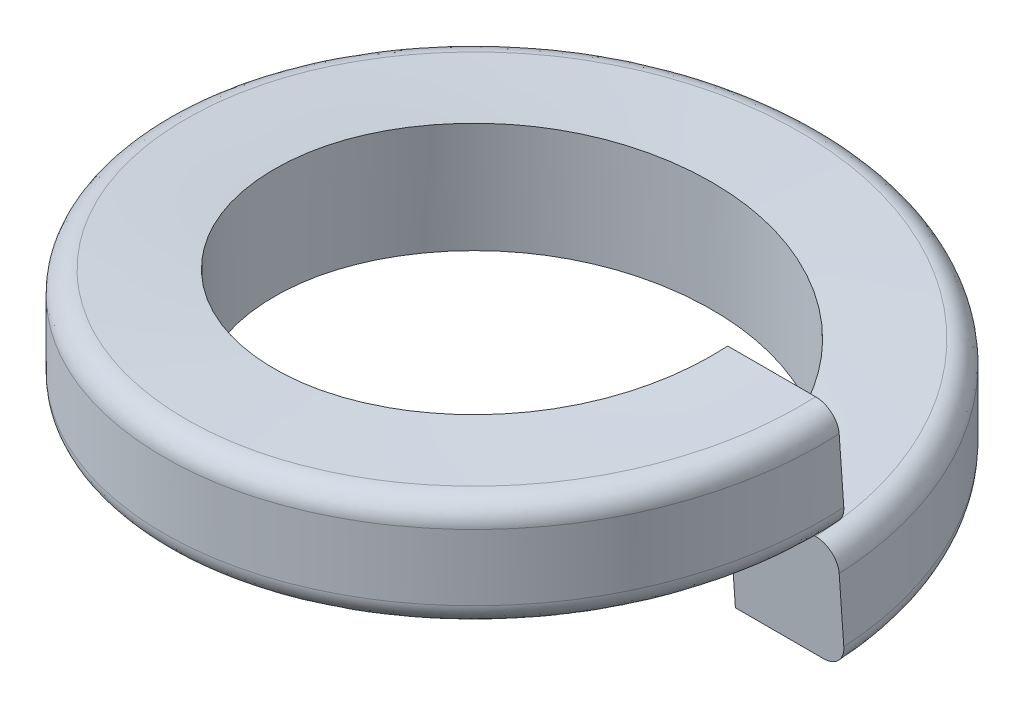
ISO-10303-21;
HEADER;
FILE_DESCRIPTION(('STEP AP214'),'2;1');
FILE_NAME('part.step','',(''),(''),'','','');
FILE_SCHEMA(('AUTOMOTIVE_DESIGN { 1 0 10303 214 1 1 1 1 }'));
ENDSEC;
DATA;
#1=APPLICATION_CONTEXT('core data for automotive mechanical design processes');
#2=APPLICATION_PROTOCOL_DEFINITION('international standard','automotive_design',2000,#1);
#3=PRODUCT_CONTEXT('',#1,'mechanical');
#4=PRODUCT('Part','Part','',(#3));
#5=PRODUCT_RELATED_PRODUCT_CATEGORY('part','',(#4));
#6=PRODUCT_DEFINITION_FORMATION('','',#4);
#7=PRODUCT_DEFINITION_CONTEXT('part definition',#1,'design');
#8=PRODUCT_DEFINITION('design','',#6,#7);
#9=PRODUCT_DEFINITION_SHAPE('','',#8);
#10=(LENGTH_UNIT() NAMED_UNIT(*) SI_UNIT(.MILLI.,.METRE.));
#11=(NAMED_UNIT(*) PLANE_ANGLE_UNIT() SI_UNIT($,.RADIAN.));
#12=(NAMED_UNIT(*) SI_UNIT($,.STERADIAN.) SOLID_ANGLE_UNIT());
#13=UNCERTAINTY_MEASURE_WITH_UNIT(LENGTH_MEASURE(1.E-05),#10,'distance_accuracy_value','');
#14=(GEOMETRIC_REPRESENTATION_CONTEXT(3) GLOBAL_UNCERTAINTY_ASSIGNED_CONTEXT((#13)) GLOBAL_UNIT_ASSIGNED_CONTEXT((#10,
#11,#12)) REPRESENTATION_CONTEXT('',''));
#15=CARTESIAN_POINT('',(0.,0.,0.));
#16=DIRECTION('',(0.,0.,1.));
#17=DIRECTION('',(1.,0.,0.));
#18=AXIS2_PLACEMENT_3D('',#15,#16,#17);
#19=CARTESIAN_POINT('',(1.99762507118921,0.00566467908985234,0.000396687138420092));
#20=DIRECTION('',(0.,-0.0698570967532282,0.997557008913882));
#21=DIRECTION('',(0.,-0.997557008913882,-0.0698570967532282));
#22=AXIS2_PLACEMENT_3D('',#19,#20,#21);
#23=PLANE('',#22);
#24=DIRECTION('',(0.,0.997557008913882,0.0698570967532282));
#25=VECTOR('',#24,1.);
#26=CARTESIAN_POINT('',(2.99762507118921,0.00566467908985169,0.00039668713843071));
#27=LINE('',#26,#25);
#28=CARTESIAN_POINT('',(2.99762507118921,-0.293576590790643,-0.0205586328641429));
#29=VERTEX_POINT('',#28);
#30=CARTESIAN_POINT('',(2.99762507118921,0.304905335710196,0.0213519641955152));
#31=VERTEX_POINT('',#30);
#32=EDGE_CURVE('E116',#29,#31,#27,.T.);
#33=ORIENTED_EDGE('',*,*,#32,.F.);
#34=CARTESIAN_POINT('',(2.97367616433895,-0.105613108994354,-3.47438460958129));
#35=CARTESIAN_POINT('',(2.95778438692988,-0.302911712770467,-3.48588341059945));
#36=CARTESIAN_POINT('',(2.76002487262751,-0.288837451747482,-3.48373870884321));
#37=CARTESIAN_POINT('',(2.97866114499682,-0.144106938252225,-2.7640007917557));
#38=CARTESIAN_POINT('',(2.96600133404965,-0.342094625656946,-2.77513245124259));
#39=CARTESIAN_POINT('',(2.76762371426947,-0.330818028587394,-2.77359100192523));
#40=CARTESIAN_POINT('',(2.98360957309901,-0.182703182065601,-2.05362327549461));
#41=CARTESIAN_POINT('',(2.97420486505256,-0.381246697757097,-2.06477335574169));
#42=CARTESIAN_POINT('',(2.77530812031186,-0.372846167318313,-2.06344663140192));
#43=CARTESIAN_POINT('',(2.9915620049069,-0.245357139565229,-0.903517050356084));
#44=CARTESIAN_POINT('',(2.98746867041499,-0.444603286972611,-0.914985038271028));
#45=CARTESIAN_POINT('',(2.78788786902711,-0.440967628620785,-0.913713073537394));
#46=CARTESIAN_POINT('',(2.99458855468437,-0.269351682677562,-0.463784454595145));
#47=CARTESIAN_POINT('',(2.99253763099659,-0.468828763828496,-0.47527909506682));
#48=CARTESIAN_POINT('',(2.79273043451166,-0.467031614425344,-0.474121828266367));
#49=CARTESIAN_POINT('',(2.99760109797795,-0.293385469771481,-0.0240542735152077));
#50=CARTESIAN_POINT('',(2.99759939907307,-0.493032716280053,-0.0358989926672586));
#51=CARTESIAN_POINT('',(2.79760578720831,-0.493113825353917,-0.0345318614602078));
#52=CARTESIAN_POINT('',(2.99760908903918,-0.293449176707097,-0.0228890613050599));
#53=CARTESIAN_POINT('',(2.99761280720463,-0.493096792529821,-0.0347358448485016));
#54=CARTESIAN_POINT('',(2.79761870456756,-0.493182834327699,-0.0333689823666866));
#55=CARTESIAN_POINT('',(2.99761708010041,-0.293512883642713,-0.0217238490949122));
#56=CARTESIAN_POINT('',(2.9976262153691,-0.493160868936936,-0.0335726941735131));
#57=CARTESIAN_POINT('',(2.79763162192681,-0.493251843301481,-0.0322061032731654));
#58=CARTESIAN_POINT('',(2.99762507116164,-0.293576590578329,-0.0205586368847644));
#59=CARTESIAN_POINT('',(2.99763962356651,-0.493224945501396,-0.0324095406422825));
#60=CARTESIAN_POINT('',(2.79764453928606,-0.493320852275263,-0.0310432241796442));
#61=CARTESIAN_POINT('',(2.99870411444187,-0.301685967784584,0.125844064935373));
#62=CARTESIAN_POINT('',(2.99929599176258,-0.501319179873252,0.113753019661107));
#63=CARTESIAN_POINT('',(2.7992300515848,-0.501416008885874,0.105351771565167));
#64=CARTESIAN_POINT('',(2.98891121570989,-0.310039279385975,0.272261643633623));
#65=CARTESIAN_POINT('',(2.99011528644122,-0.509659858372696,0.260020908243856));
#66=CARTESIAN_POINT('',(2.79070369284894,-0.509757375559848,0.241850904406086));
#67=CARTESIAN_POINT('',(2.94813042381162,-0.327058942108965,0.56215521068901));
#68=CARTESIAN_POINT('',(2.95057738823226,-0.526659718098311,0.549795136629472));
#69=CARTESIAN_POINT('',(2.75388820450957,-0.526758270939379,0.512284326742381));
#70=CARTESIAN_POINT('',(2.9171342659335,-0.335725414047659,0.70563002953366));
#71=CARTESIAN_POINT('',(2.92021195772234,-0.535319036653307,0.693300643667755));
#72=CARTESIAN_POINT('',(2.72559136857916,-0.535417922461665,0.64621759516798));
#73=CARTESIAN_POINT('',(2.82815807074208,-0.354529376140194,1.00809227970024));
#74=CARTESIAN_POINT('',(2.83255803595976,-0.554114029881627,0.996023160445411));
#75=CARTESIAN_POINT('',(2.64387468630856,-0.554213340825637,0.928761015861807));
#76=CARTESIAN_POINT('',(2.76676833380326,-0.364688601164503,1.16608355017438));
#77=CARTESIAN_POINT('',(2.77185427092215,-0.564272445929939,1.15427411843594));
#78=CARTESIAN_POINT('',(2.58726706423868,-0.564371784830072,1.07647130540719));
#79=CARTESIAN_POINT('',(2.6182250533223,-0.384881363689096,1.46954944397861));
#80=CARTESIAN_POINT('',(2.62455183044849,-0.584472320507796,1.45847694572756));
#81=CARTESIAN_POINT('',(2.44987517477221,-0.584571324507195,1.36042813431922));
#82=CARTESIAN_POINT('',(2.53107040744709,-0.39491489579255,1.61502353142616));
#83=CARTESIAN_POINT('',(2.5379518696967,-0.594513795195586,1.60442859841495));
#84=CARTESIAN_POINT('',(2.36908987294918,-0.594612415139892,1.49667418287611));
#85=CARTESIAN_POINT('',(2.38304088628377,-0.409679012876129,1.82056638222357));
#86=CARTESIAN_POINT('',(2.39063353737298,-0.60929386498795,1.81079207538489));
#87=CARTESIAN_POINT('',(2.23164724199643,-0.609391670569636,1.68932442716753));
#88=CARTESIAN_POINT('',(2.33078941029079,-0.414554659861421,1.88699431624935));
#89=CARTESIAN_POINT('',(2.33859895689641,-0.614175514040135,1.87751118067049));
#90=CARTESIAN_POINT('',(2.18309863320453,-0.614273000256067,1.75161154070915));
#91=CARTESIAN_POINT('',(2.22083593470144,-0.424119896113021,2.01523859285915));
#92=CARTESIAN_POINT('',(2.22899050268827,-0.623757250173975,2.00639539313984));
#93=CARTESIAN_POINT('',(2.08082528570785,-0.623853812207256,1.8719394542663));
#94=CARTESIAN_POINT('',(2.16313389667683,-0.428809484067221,2.07705490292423));
#95=CARTESIAN_POINT('',(2.17141649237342,-0.628457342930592,2.06856055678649));
#96=CARTESIAN_POINT('',(2.02710051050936,-0.628553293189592,1.9299802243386));
#97=CARTESIAN_POINT('',(2.07283980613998,-0.435890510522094,2.1659413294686));
#98=CARTESIAN_POINT('',(2.08154254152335,-0.635532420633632,2.15774682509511));
#99=CARTESIAN_POINT('',(1.94325133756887,-0.635628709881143,2.01323645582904));
#100=CARTESIAN_POINT('',(2.0421127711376,-0.438259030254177,2.19493503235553));
#101=CARTESIAN_POINT('',(2.05099372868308,-0.637895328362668,2.18680311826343));
#102=CARTESIAN_POINT('',(1.91475286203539,-0.63799194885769,2.04035863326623));
#103=CARTESIAN_POINT('',(1.9794631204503,-0.443037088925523,2.25159645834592));
#104=CARTESIAN_POINT('',(1.98867156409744,-0.642664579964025,2.24362618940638));
#105=CARTESIAN_POINT('',(1.8566110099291,-0.64276170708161,2.0934018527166));
#106=CARTESIAN_POINT('',(1.94754057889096,-0.445446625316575,2.27926426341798));
#107=CARTESIAN_POINT('',(1.95689826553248,-0.64507092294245,2.27139307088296));
#108=CARTESIAN_POINT('',(1.82696770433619,-0.645168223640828,2.11932296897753));
#109=CARTESIAN_POINT('',(1.8500755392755,-0.452718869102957,2.36019846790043));
#110=CARTESIAN_POINT('',(1.85987409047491,-0.652333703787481,2.35263719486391));
#111=CARTESIAN_POINT('',(1.73644667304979,-0.652431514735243,2.19516790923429));
#112=CARTESIAN_POINT('',(1.78282394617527,-0.457626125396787,2.41140714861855));
#113=CARTESIAN_POINT('',(1.79290722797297,-0.657234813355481,2.40406952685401));
#114=CARTESIAN_POINT('',(1.67396699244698,-0.657332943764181,2.24318408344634));
#115=CARTESIAN_POINT('',(1.57500908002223,-0.472475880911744,2.55615954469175));
#116=CARTESIAN_POINT('',(1.5858782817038,-0.672069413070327,2.54956368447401));
#117=CARTESIAN_POINT('',(1.48080351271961,-0.672168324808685,2.3790218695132));
#118=CARTESIAN_POINT('',(1.42822991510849,-0.482558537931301,2.64098269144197));
#119=CARTESIAN_POINT('',(1.4395324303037,-0.682146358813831,2.63497655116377));
#120=CARTESIAN_POINT('',(1.34425076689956,-0.682245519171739,2.45877599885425));
#121=CARTESIAN_POINT('',(1.12261991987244,-0.502783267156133,2.78468594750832));
#122=CARTESIAN_POINT('',(1.13457816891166,-0.702367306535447,2.77996793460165));
#123=CARTESIAN_POINT('',(1.05968624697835,-0.702466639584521,2.59418070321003));
#124=CARTESIAN_POINT('',(0.96378963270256,-0.512925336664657,2.84356722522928));
#125=CARTESIAN_POINT('',(0.97597005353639,-0.712511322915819,2.83954775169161));
#126=CARTESIAN_POINT('',(0.911674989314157,-0.712610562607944,2.64983236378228));
#127=CARTESIAN_POINT('',(0.638263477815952,-0.532996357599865,2.93381460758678));
#128=CARTESIAN_POINT('',(0.650626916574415,-0.732595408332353,2.93122701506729));
#129=CARTESIAN_POINT('',(0.608049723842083,-0.732694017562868,2.73549067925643));
#130=CARTESIAN_POINT('',(0.471565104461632,-0.542925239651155,2.96517188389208));
#131=CARTESIAN_POINT('',(0.483888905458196,-0.742535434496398,2.96331770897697));
#132=CARTESIAN_POINT('',(0.45243329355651,-0.742633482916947,2.76548910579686));
#133=CARTESIAN_POINT('',(0.261633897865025,-0.555015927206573,2.98655693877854));
#134=CARTESIAN_POINT('',(0.273797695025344,-0.754641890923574,2.98558884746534));
#135=CARTESIAN_POINT('',(0.25634772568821,-0.754739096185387,2.78633306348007));
#136=CARTESIAN_POINT('',(0.219531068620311,-0.557420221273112,2.98994511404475));
#137=CARTESIAN_POINT('',(0.231657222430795,-0.757049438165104,2.9891528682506));
#138=CARTESIAN_POINT('',(0.217016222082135,-0.757146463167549,2.78967093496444));
#139=CARTESIAN_POINT('',(0.135219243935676,-0.562183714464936,2.99494144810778));
#140=CARTESIAN_POINT('',(0.147220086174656,-0.761822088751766,2.99449557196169));
#141=CARTESIAN_POINT('',(0.138203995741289,-0.761918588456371,2.79467992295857));
#142=CARTESIAN_POINT('',(0.0930102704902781,-0.56454292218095,2.9965499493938));
#143=CARTESIAN_POINT('',(0.104923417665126,-0.764187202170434,2.99627459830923));
#144=CARTESIAN_POINT('',(0.0987233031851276,-0.764283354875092,2.79635136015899));
#145=CARTESIAN_POINT('',(-0.033665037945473,-0.571614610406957,2.99869615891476));
#146=CARTESIAN_POINT('',(-0.0218299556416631,-0.771264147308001,2.99893014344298));
#147=CARTESIAN_POINT('',(-0.0195784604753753,-0.7713599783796,2.79886362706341));
#148=CARTESIAN_POINT('',(-0.118190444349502,-0.576321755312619,2.99655565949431));
#149=CARTESIAN_POINT('',(-0.106160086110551,-0.775958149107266,2.99712624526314));
#150=CARTESIAN_POINT('',(-0.0982692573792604,-0.776054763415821,2.79720346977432));
#151=CARTESIAN_POINT('',(-0.286717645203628,-0.585913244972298,2.98514680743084));
#152=CARTESIAN_POINT('',(-0.274456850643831,-0.785531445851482,2.98641260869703));
#153=CARTESIAN_POINT('',(-0.25532243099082,-0.785629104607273,2.78725235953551));
#154=CARTESIAN_POINT('',(-0.370719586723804,-0.590797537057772,2.97588055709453));
#155=CARTESIAN_POINT('',(-0.358423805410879,-0.790410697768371,2.97750497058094));
#156=CARTESIAN_POINT('',(-0.333684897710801,-0.790508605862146,2.77896336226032));
#157=CARTESIAN_POINT('',(-0.537619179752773,-0.600651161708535,2.95030166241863));
#158=CARTESIAN_POINT('',(-0.525287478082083,-0.80025441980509,2.95264592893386));
#159=CARTESIAN_POINT('',(-0.489413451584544,-0.80035282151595,2.7558117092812));
#160=CARTESIAN_POINT('',(-0.62051682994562,-0.605620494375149,2.93398900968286));
#161=CARTESIAN_POINT('',(-0.608184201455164,-0.805218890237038,2.93669452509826));
#162=CARTESIAN_POINT('',(-0.566779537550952,-0.805317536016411,2.74094904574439));
#163=CARTESIAN_POINT('',(-0.866659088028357,-0.620624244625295,2.8746325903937));
#164=CARTESIAN_POINT('',(-0.854422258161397,-0.820211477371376,2.87841372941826));
#165=CARTESIAN_POINT('',(-0.796596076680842,-0.820310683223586,2.68662933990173));
#166=CARTESIAN_POINT('',(-1.02750301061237,-0.630762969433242,2.82116004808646));
#167=CARTESIAN_POINT('',(-1.01546184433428,-0.830347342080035,2.82564799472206));
#168=CARTESIAN_POINT('',(-0.946904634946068,-0.830446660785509,2.63743160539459));
#169=CARTESIAN_POINT('',(-1.33792074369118,-0.651006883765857,2.68787666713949));
#170=CARTESIAN_POINT('',(-1.32648939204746,-0.85059343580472,2.69367572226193));
#171=CARTESIAN_POINT('',(-1.23722233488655,-0.850692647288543,2.51435208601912));
#172=CARTESIAN_POINT('',(-1.48749253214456,-0.661112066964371,2.60806111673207));
#173=CARTESIAN_POINT('',(-1.47647564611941,-0.86070367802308,2.61446432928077));
#174=CARTESIAN_POINT('',(-1.37722962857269,-0.860802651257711,2.44046588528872));
#175=CARTESIAN_POINT('',(-1.70007560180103,-0.676013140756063,2.47044118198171));
#176=CARTESIAN_POINT('',(-1.68981339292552,-0.875618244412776,2.47762168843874));
#177=CARTESIAN_POINT('',(-1.57638463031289,-0.875716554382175,2.3128044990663));
#178=CARTESIAN_POINT('',(-1.76899986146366,-0.680939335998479,2.4215615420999));
#179=CARTESIAN_POINT('',(-1.75901162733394,-0.880549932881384,2.42897964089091));
#180=CARTESIAN_POINT('',(-1.6409844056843,-0.880647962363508,2.267423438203));
#181=CARTESIAN_POINT('',(-1.90250909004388,-0.690688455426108,2.31813644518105));
#182=CARTESIAN_POINT('',(-1.89310537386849,-0.890311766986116,2.32598234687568));
#183=CARTESIAN_POINT('',(-1.76617064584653,-0.89040911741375,2.17132603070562));
#184=CARTESIAN_POINT('',(-1.96709406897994,-0.695511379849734,2.26359100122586));
#185=CARTESIAN_POINT('',(-1.95800092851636,-0.895141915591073,2.27162707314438));
#186=CARTESIAN_POINT('',(-1.82675711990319,-0.895238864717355,2.12060969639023));
#187=CARTESIAN_POINT('',(-2.06032518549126,-0.702601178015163,2.1778485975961));
#188=CARTESIAN_POINT('',(-2.05171741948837,-0.902243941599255,2.18612386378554));
#189=CARTESIAN_POINT('',(-1.91425331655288,-0.902340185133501,2.04082646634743));
#190=CARTESIAN_POINT('',(-2.09079478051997,-0.704940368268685,2.14861345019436));
#191=CARTESIAN_POINT('',(-2.08235209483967,-0.904587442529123,2.15696073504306));
#192=CARTESIAN_POINT('',(-1.9428550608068,-0.904683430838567,2.01361364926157));
#193=CARTESIAN_POINT('',(-2.15047101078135,-0.709641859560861,2.08888338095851));
#194=CARTESIAN_POINT('',(-2.14224777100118,-0.909287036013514,2.09748800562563));
#195=CARTESIAN_POINT('',(-1.99876940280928,-0.909383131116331,1.95812621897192));
#196=CARTESIAN_POINT('',(-2.17967772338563,-0.712004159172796,2.05838853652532));
#197=CARTESIAN_POINT('',(-2.17150876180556,-0.911643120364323,2.06717856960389));
#198=CARTESIAN_POINT('',(-2.02608207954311,-0.911739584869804,1.92985167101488));
#199=CARTESIAN_POINT('',(-2.26531723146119,-0.71914827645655,1.96510754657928));
#200=CARTESIAN_POINT('',(-2.25736429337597,-0.918772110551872,1.97441130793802));
#201=CARTESIAN_POINT('',(-2.10622479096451,-0.91886946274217,1.84330862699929));
#202=CARTESIAN_POINT('',(-2.31978098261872,-0.723988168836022,1.90051428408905));
#203=CARTESIAN_POINT('',(-2.31204324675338,-0.923606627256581,1.91010368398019));
#204=CARTESIAN_POINT('',(-2.15727031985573,-0.923704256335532,1.78331086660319));
#205=CARTESIAN_POINT('',(-2.47469823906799,-0.738670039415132,1.70014499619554));
#206=CARTESIAN_POINT('',(-2.46765429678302,-0.938272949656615,1.71055883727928));
#207=CARTESIAN_POINT('',(-2.30254666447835,-0.938371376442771,1.59713498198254));
#208=CARTESIAN_POINT('',(-2.56674013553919,-0.74867884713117,1.55772198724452));
#209=CARTESIAN_POINT('',(-2.56022343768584,-0.948272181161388,1.56864217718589));
#210=CARTESIAN_POINT('',(-2.38897562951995,-0.948371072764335,1.46472092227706));
#211=CARTESIAN_POINT('',(-2.72554925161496,-0.768849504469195,1.25943760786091));
#212=CARTESIAN_POINT('',(-2.72023776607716,-0.968433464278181,1.27114559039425));
#213=CARTESIAN_POINT('',(-2.5383957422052,-0.96853281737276,1.18712541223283));
#214=CARTESIAN_POINT('',(-2.79230067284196,-0.779011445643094,1.10356791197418));
#215=CARTESIAN_POINT('',(-2.78766747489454,-0.978595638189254,1.11555684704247));
#216=CARTESIAN_POINT('',(-2.60137223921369,-0.978694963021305,1.04193605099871));
#217=CARTESIAN_POINT('',(-2.89853909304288,-0.799187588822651,0.78297870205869));
#218=CARTESIAN_POINT('',(-2.89531449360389,-0.998779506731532,0.795302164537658));
#219=CARTESIAN_POINT('',(-2.70193166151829,-0.998878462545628,0.743070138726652));
#220=CARTESIAN_POINT('',(-2.93807532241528,-0.809202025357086,0.618275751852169));
#221=CARTESIAN_POINT('',(-2.93558100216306,-1.00880143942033,0.630652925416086));
#222=CARTESIAN_POINT('',(-2.73956043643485,-1.00890003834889,0.589409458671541));
#223=CARTESIAN_POINT('',(-2.97430273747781,-0.823160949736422,0.380629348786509));
#224=CARTESIAN_POINT('',(-2.9728318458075,-1.0227776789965,0.392887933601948));
#225=CARTESIAN_POINT('',(-2.77439389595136,-1.02287538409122,0.367499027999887));
#226=CARTESIAN_POINT('',(-2.98256023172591,-0.827288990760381,0.309300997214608));
#227=CARTESIAN_POINT('',(-2.98139272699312,-1.02691174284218,0.321499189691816));
#228=CARTESIAN_POINT('',(-2.78240367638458,-1.02700912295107,0.300869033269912));
#229=CARTESIAN_POINT('',(-2.99109728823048,-0.833412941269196,0.201993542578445));
#230=CARTESIAN_POINT('',(-2.9903772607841,-1.03304414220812,0.214092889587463));
#231=CARTESIAN_POINT('',(-2.79081837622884,-1.03314105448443,0.20062189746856));
#232=CARTESIAN_POINT('',(-2.99330145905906,-0.835443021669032,0.166169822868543));
#233=CARTESIAN_POINT('',(-2.99272933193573,-1.03507694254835,0.178234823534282));
#234=CARTESIAN_POINT('',(-2.7930233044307,-1.03517370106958,0.167153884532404));
#235=CARTESIAN_POINT('',(-2.99642193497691,-0.839467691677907,0.0944613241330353));
#236=CARTESIAN_POINT('',(-2.99614132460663,-1.03911018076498,0.106402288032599));
#237=CARTESIAN_POINT('',(-2.79622673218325,-1.03920643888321,0.100105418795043));
#238=CARTESIAN_POINT('',(-2.99733813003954,-0.841462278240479,0.0585765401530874));
#239=CARTESIAN_POINT('',(-2.99720113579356,-1.04111061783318,0.0704277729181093));
#240=CARTESIAN_POINT('',(-2.79722512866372,-1.04120652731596,0.0665249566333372));
#241=CARTESIAN_POINT('',(-2.99792881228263,-0.845804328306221,-0.0194802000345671));
#242=CARTESIAN_POINT('',(-2.9981031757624,-1.04545317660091,-0.00763718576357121));
#243=CARTESIAN_POINT('',(-2.79808786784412,-1.04554905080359,-0.00633216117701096));
#244=CARTESIAN_POINT('',(-2.99735813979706,-0.848152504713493,-0.0616542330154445));
#245=CARTESIAN_POINT('',(-2.99770006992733,-1.04779386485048,-0.0496968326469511));
#246=CARTESIAN_POINT('',(-2.79772336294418,-1.04789018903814,-0.0455780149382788));
#247=CARTESIAN_POINT('',(-2.99443805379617,-0.852894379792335,-0.145935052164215));
#248=CARTESIAN_POINT('',(-2.99512158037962,-1.05252533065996,-0.133829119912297));
#249=CARTESIAN_POINT('',(-2.79534046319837,-1.0526222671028,-0.124087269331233));
#250=CARTESIAN_POINT('',(-2.99208870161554,-0.85528807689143,-0.188041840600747));
#251=CARTESIAN_POINT('',(-2.99294625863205,-1.05491610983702,-0.175901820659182));
#252=CARTESIAN_POINT('',(-2.79332212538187,-1.05501320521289,-0.163350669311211));
#253=CARTESIAN_POINT('',(-2.98237992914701,-0.862516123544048,-0.314175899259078));
#254=CARTESIAN_POINT('',(-2.9837643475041,-1.06213492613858,-0.30193806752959));
#255=CARTESIAN_POINT('',(-2.78478870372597,-1.06223252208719,-0.280971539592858));
#256=CARTESIAN_POINT('',(-2.97235966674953,-0.867396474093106,-0.397999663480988));
#257=CARTESIAN_POINT('',(-2.97410161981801,-1.06700849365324,-0.385702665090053));
#258=CARTESIAN_POINT('',(-2.77579502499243,-1.06710644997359,-0.359143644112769));
#259=CARTESIAN_POINT('',(-2.9316832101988,-0.88219535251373,-0.64798355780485));
#260=CARTESIAN_POINT('',(-2.93450367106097,-1.08179069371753,-0.635613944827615));
#261=CARTESIAN_POINT('',(-2.73891221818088,-1.0818895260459,-0.592377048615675));
#262=CARTESIAN_POINT('',(-2.89041049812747,-0.892264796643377,-0.812531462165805));
#263=CARTESIAN_POINT('',(-2.89395725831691,-1.0918539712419,-0.800254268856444));
#264=CARTESIAN_POINT('',(-2.70112001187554,-1.0919530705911,-0.746039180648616));
#265=CARTESIAN_POINT('',(-2.78082901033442,-0.912484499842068,-1.1321426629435));
#266=CARTESIAN_POINT('',(-2.78576543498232,-1.11206843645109,-1.12027125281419));
#267=CARTESIAN_POINT('',(-2.60024002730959,-1.11216777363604,-1.04473290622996));
#268=CARTESIAN_POINT('',(-2.7125347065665,-0.922634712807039,-1.28721098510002));
#269=CARTESIAN_POINT('',(-2.71813446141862,-1.12221959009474,-1.27565307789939));
#270=CARTESIAN_POINT('',(-2.53716578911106,-1.12231888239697,-1.18976907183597));
#271=CARTESIAN_POINT('',(-2.55079795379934,-0.942740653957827,-1.58368511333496));
#272=CARTESIAN_POINT('',(-2.55756053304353,-1.14233756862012,-1.57297887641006));
#273=CARTESIAN_POINT('',(-2.38738234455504,-1.14243628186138,-1.46731532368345));
#274=CARTESIAN_POINT('',(-2.45736558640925,-0.952696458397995,-1.72509636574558));
#275=CARTESIAN_POINT('',(-2.46462747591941,-1.15230449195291,-1.71492857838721));
#276=CARTESIAN_POINT('',(-2.3006826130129,-1.15240264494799,-1.5998304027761));
#277=CARTESIAN_POINT('',(-2.30046277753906,-0.96726941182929,-1.92385339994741));
#278=CARTESIAN_POINT('',(-2.30838359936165,-1.16689401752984,-1.91453824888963));
#279=CARTESIAN_POINT('',(-2.15490642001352,-1.16699130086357,-1.78617946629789));
#280=CARTESIAN_POINT('',(-2.24532837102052,-0.972069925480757,-1.98791620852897));
#281=CARTESIAN_POINT('',(-2.25345386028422,-1.17170004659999,-1.97889303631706));
#282=CARTESIAN_POINT('',(-2.10365500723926,-1.17179702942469,-1.84626006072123));
#283=CARTESIAN_POINT('',(-2.173160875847,-0.977968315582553,-2.0649445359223));
#284=CARTESIAN_POINT('',(-2.18143882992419,-1.17761249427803,-2.05637177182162));
#285=CARTESIAN_POINT('',(-2.03645412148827,-1.17770865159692,-1.91859943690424));
#286=CARTESIAN_POINT('',(-2.15856196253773,-0.979143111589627,-2.0802006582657));
#287=CARTESIAN_POINT('',(-2.16686521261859,-1.17879046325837,-2.07172230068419));
#288=CARTESIAN_POINT('',(-2.02285437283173,-1.17888643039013,-1.93293203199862));
#289=CARTESIAN_POINT('',(-2.12904487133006,-0.98148785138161,-2.11040103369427));
#290=CARTESIAN_POINT('',(-2.13745923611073,-1.18113592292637,-2.10204898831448));
#291=CARTESIAN_POINT('',(-1.99541774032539,-1.18123184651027,-1.96124383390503));
#292=CARTESIAN_POINT('',(-2.11412670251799,-0.982657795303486,-2.12534529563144));
#293=CARTESIAN_POINT('',(-2.12262690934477,-1.18230341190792,-2.1170251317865));
#294=CARTESIAN_POINT('',(-1.98158086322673,-1.1823994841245,-1.97522305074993));
#295=CARTESIAN_POINT('',(-2.0689038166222,-0.986185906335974,-2.16970032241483));
#296=CARTESIAN_POINT('',(-2.07765485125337,-1.18582473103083,-2.16148615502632));
#297=CARTESIAN_POINT('',(-1.93962635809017,-1.18592121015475,-2.01672516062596));
#298=CARTESIAN_POINT('',(-2.03813128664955,-0.988562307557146,-2.19863272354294));
#299=CARTESIAN_POINT('',(-2.04704056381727,-1.1881973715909,-2.19050306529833));
#300=CARTESIAN_POINT('',(-1.9110653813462,-1.18829406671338,-2.04381194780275));
#301=CARTESIAN_POINT('',(-1.94402000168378,-0.995741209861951,-2.28343858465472));
#302=CARTESIAN_POINT('',(-1.95339609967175,-1.19536530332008,-2.27557856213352));
#303=CARTESIAN_POINT('',(-1.82370041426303,-1.19546262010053,-2.12322999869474));
#304=CARTESIAN_POINT('',(-1.87887711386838,-1.00059424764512,-2.33733184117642));
#305=CARTESIAN_POINT('',(-1.88855383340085,-1.20021144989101,-2.32967319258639));
#306=CARTESIAN_POINT('',(-1.76320470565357,-1.2003091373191,-2.17372937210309));
#307=CARTESIAN_POINT('',(-1.74430854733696,-1.01040496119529,-2.43940770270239));
#308=CARTESIAN_POINT('',(-1.75454621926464,-1.21001042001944,-2.43220171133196));
#309=CARTESIAN_POINT('',(-1.63817577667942,-1.21010872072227,-2.26944836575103));
#310=CARTESIAN_POINT('',(-1.6748828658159,-1.01536263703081,-2.4875903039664));
#311=CARTESIAN_POINT('',(-1.68538083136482,-1.21496324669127,-2.48063563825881));
#312=CARTESIAN_POINT('',(-1.57364255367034,-1.21506178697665,-2.31466798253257));
#313=CARTESIAN_POINT('',(-1.4609337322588,-1.03033514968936,-2.62302837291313));
#314=CARTESIAN_POINT('',(-1.4721433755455,-1.22992414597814,-2.61688744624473));
#315=CARTESIAN_POINT('',(-1.37467968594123,-1.23002326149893,-2.44188469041));
#316=CARTESIAN_POINT('',(-1.31059166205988,-1.04046063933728,-2.70130586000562));
#317=CARTESIAN_POINT('',(-1.3221838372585,-1.24004581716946,-2.69578785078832));
#318=CARTESIAN_POINT('',(-1.23475084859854,-1.24014509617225,-2.51556304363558));
#319=CARTESIAN_POINT('',(-0.998872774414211,-1.06070416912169,-2.83142304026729));
#320=CARTESIAN_POINT('',(-1.01100857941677,-1.26028956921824,-2.82724422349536));
#321=CARTESIAN_POINT('',(-0.944372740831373,-1.26038883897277,-2.63833903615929));
#322=CARTESIAN_POINT('',(-0.83749604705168,-1.07082220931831,-2.88326294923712));
#323=CARTESIAN_POINT('',(-0.849792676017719,-1.27041166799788,-2.8798005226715));
#324=CARTESIAN_POINT('',(-0.793923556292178,-1.27051074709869,-2.68743687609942));
#325=CARTESIAN_POINT('',(-0.590745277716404,-1.08576720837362,-2.94012907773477));
#326=CARTESIAN_POINT('',(-0.603080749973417,-1.28536978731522,-2.93774940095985));
#327=CARTESIAN_POINT('',(-0.563673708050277,-1.28546822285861,-2.74159172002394));
#328=CARTESIAN_POINT('',(-0.507662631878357,-1.09071310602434,-2.95560517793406));
#329=CARTESIAN_POINT('',(-0.519977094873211,-1.2903212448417,-2.95358802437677));
#330=CARTESIAN_POINT('',(-0.486112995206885,-1.29041939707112,-2.75639771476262));
#331=CARTESIAN_POINT('',(-0.340448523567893,-1.10050159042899,-2.9794957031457));
#332=CARTESIAN_POINT('',(-0.352695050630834,-1.30012047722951,-2.97819675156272));
#333=CARTESIAN_POINT('',(-0.329986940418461,-1.30021807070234,-2.77941230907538));
#334=CARTESIAN_POINT('',(-0.256317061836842,-1.10534417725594,-2.9879101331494));
#335=CARTESIAN_POINT('',(-0.268516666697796,-1.30496825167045,-2.98696684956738));
#336=CARTESIAN_POINT('',(-0.251421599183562,-1.30506557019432,-2.78762091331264));
#337=CARTESIAN_POINT('',(-0.129831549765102,-1.11248734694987,-2.99518107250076));
#338=CARTESIAN_POINT('',(-0.141817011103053,-1.31212675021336,-2.99475733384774));
#339=CARTESIAN_POINT('',(-0.133160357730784,-1.31222318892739,-2.79492564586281));
#340=CARTESIAN_POINT('',(-0.0876163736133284,-1.11484857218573,-2.99671279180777));
#341=CARTESIAN_POINT('',(-0.0995063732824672,-1.31449434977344,-2.99645993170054));
#342=CARTESIAN_POINT('',(-0.0936661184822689,-1.31459041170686,-2.79652574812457));
#343=CARTESIAN_POINT('',(-0.00315772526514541,-1.11955152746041,-2.99799111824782));
#344=CARTESIAN_POINT('',(-0.0150250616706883,-1.31919890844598,-2.99807591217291));
#345=CARTESIAN_POINT('',(-0.014819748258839,-1.31929487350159,-2.79805649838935));
#346=CARTESIAN_POINT('',(0.0390857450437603,-1.12189325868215,-2.99773783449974));
#347=CARTESIAN_POINT('',(0.0271454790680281,-1.32153586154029,-2.99798940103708));
#348=CARTESIAN_POINT('',(0.0245323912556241,-1.32163211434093,-2.79798724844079));
#349=CARTESIAN_POINT('',(0.165726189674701,-1.12898801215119,-2.99430311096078));
#350=CARTESIAN_POINT('',(0.153600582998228,-1.32861763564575,-2.99506443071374));
#351=CARTESIAN_POINT('',(0.142538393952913,-1.32871465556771,-2.79529242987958));
#352=CARTESIAN_POINT('',(0.2500494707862,-1.13381146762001,-2.98844773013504));
#353=CARTESIAN_POINT('',(0.237845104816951,-1.33343425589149,-2.98956153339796));
#354=CARTESIAN_POINT('',(0.221156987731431,-1.33353164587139,-2.79018072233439));
#355=CARTESIAN_POINT('',(0.501732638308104,-1.14843916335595,-2.96021494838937));
#356=CARTESIAN_POINT('',(0.489374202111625,-1.34804361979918,-2.96239814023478));
#357=CARTESIAN_POINT('',(0.455894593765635,-1.34814198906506,-2.76490239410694));
#358=CARTESIAN_POINT('',(0.668010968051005,-1.15841191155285,-2.9271824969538));
#359=CARTESIAN_POINT('',(0.655659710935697,-1.35800706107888,-2.93009534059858));
#360=CARTESIAN_POINT('',(0.611086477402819,-1.35810587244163,-2.73480420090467));
#361=CARTESIAN_POINT('',(0.992530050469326,-1.1785388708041,-2.8336610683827));
#362=CARTESIAN_POINT('',(0.980437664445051,-1.37812358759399,-2.83799346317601));
#363=CARTESIAN_POINT('',(0.914213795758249,-1.3782229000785,-2.64894294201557));
#364=CARTESIAN_POINT('',(1.15077069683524,-1.1886930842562,-2.77317172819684));
#365=CARTESIAN_POINT('',(1.13893034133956,-1.38827669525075,-2.77819396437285));
#366=CARTESIAN_POINT('',(1.06214913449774,-1.38837604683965,-2.59317953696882));
#367=CARTESIAN_POINT('',(1.45496571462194,-1.20888930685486,-2.62635165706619));
#368=CARTESIAN_POINT('',(1.44385262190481,-1.4084798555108,-2.63261924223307));
#369=CARTESIAN_POINT('',(1.34677678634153,-1.40857887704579,-2.45740038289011));
#370=CARTESIAN_POINT('',(1.60091689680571,-1.21893128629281,-2.54001424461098));
#371=CARTESIAN_POINT('',(1.59027942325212,-1.41852990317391,-2.54683711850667));
#372=CARTESIAN_POINT('',(1.48346618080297,-1.41862853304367,-2.37737836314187));
#373=CARTESIAN_POINT('',(1.80726159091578,-1.23371201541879,-2.39314704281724));
#374=CARTESIAN_POINT('',(1.79742694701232,-1.43332535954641,-2.40069941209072));
#375=CARTESIAN_POINT('',(1.67684696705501,-1.43342324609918,-2.2410389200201));
#376=CARTESIAN_POINT('',(1.87397108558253,-1.23859384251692,-2.34127278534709));
#377=CARTESIAN_POINT('',(1.86441917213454,-1.43821254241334,-2.34905107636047));
#378=CARTESIAN_POINT('',(1.73938842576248,-1.43831014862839,-2.1928514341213));
#379=CARTESIAN_POINT('',(2.00281026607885,-1.24817888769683,-2.23205000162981));
#380=CARTESIAN_POINT('',(1.99391272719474,-1.44781548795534,-2.24016246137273));
#381=CARTESIAN_POINT('',(1.86028598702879,-1.44791209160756,-2.09124907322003));
#382=CARTESIAN_POINT('',(2.0649399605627,-1.25288210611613,-2.17470148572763));
#383=CARTESIAN_POINT('',(2.05641420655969,-1.45253126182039,-2.18292205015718));
#384=CARTESIAN_POINT('',(1.91864209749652,-1.45262713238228,-2.03783420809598));
#385=CARTESIAN_POINT('',(2.15430602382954,-1.2599542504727,-2.08492932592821));
#386=CARTESIAN_POINT('',(2.1460835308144,-1.45959802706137,-2.09356521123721));
#387=CARTESIAN_POINT('',(2.00234934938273,-1.45969420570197,-1.95446731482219));
#388=CARTESIAN_POINT('',(2.18345514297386,-1.2623143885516,-2.05438214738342));
#389=CARTESIAN_POINT('',(2.17529121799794,-1.46195232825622,-2.06319876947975));
#390=CARTESIAN_POINT('',(2.0296125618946,-1.46204885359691,-1.92613922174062));
#391=CARTESIAN_POINT('',(2.24043545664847,-1.26707880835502,-1.99208630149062));
#392=CARTESIAN_POINT('',(2.23242789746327,-1.46670770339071,-2.00123347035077));
#393=CARTESIAN_POINT('',(2.08294812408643,-1.46680475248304,-1.86833064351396));
#394=CARTESIAN_POINT('',(2.26826673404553,-1.2694830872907,-1.96033770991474));
#395=CARTESIAN_POINT('',(2.26035699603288,-1.46910877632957,-1.96963466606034));
#396=CARTESIAN_POINT('',(2.10902054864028,-1.46920600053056,-1.83885023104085));
#397=CARTESIAN_POINT('',(2.34970379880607,-1.27673970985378,-1.86338414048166));
#398=CARTESIAN_POINT('',(2.34209961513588,-1.47635583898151,-1.87312434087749));
#399=CARTESIAN_POINT('',(2.18533043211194,-1.4764535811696,-1.74880893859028));
#400=CARTESIAN_POINT('',(2.40126376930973,-1.28163670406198,-1.79646036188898));
#401=CARTESIAN_POINT('',(2.39387952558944,-1.48124654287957,-1.80648787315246));
#402=CARTESIAN_POINT('',(2.23367075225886,-1.48134461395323,-1.68663778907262));
#403=CARTESIAN_POINT('',(2.5471849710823,-1.29646693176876,-1.58948556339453));
#404=CARTESIAN_POINT('',(2.54053288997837,-1.4960611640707,-1.60030815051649));
#405=CARTESIAN_POINT('',(2.37058978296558,-1.49616004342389,-1.49426751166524));
#406=CARTESIAN_POINT('',(2.63285359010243,-1.30654462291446,-1.44316456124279));
#407=CARTESIAN_POINT('',(2.62678666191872,-1.50613283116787,-1.45442793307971));
#408=CARTESIAN_POINT('',(2.45112841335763,-1.5062319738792,-1.35814986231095));
#409=CARTESIAN_POINT('',(2.77835693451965,-1.32677454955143,-1.13821410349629));
#410=CARTESIAN_POINT('',(2.77357141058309,-1.52635860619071,-1.15014528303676));
#411=CARTESIAN_POINT('',(2.58820640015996,-1.52645793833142,-1.07421293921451));
#412=CARTESIAN_POINT('',(2.83817538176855,-1.3369268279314,-0.979576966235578));
#413=CARTESIAN_POINT('',(2.83408632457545,-1.53651278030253,-0.991734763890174));
#414=CARTESIAN_POINT('',(2.64473063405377,-1.5366120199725,-0.926386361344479));
#415=CARTESIAN_POINT('',(2.93020252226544,-1.35701168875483,-0.654599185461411));
#416=CARTESIAN_POINT('',(2.92754312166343,-1.55660956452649,-0.666965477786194));
#417=CARTESIAN_POINT('',(2.73204779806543,-1.55670823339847,-0.623298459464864));
#418=CARTESIAN_POINT('',(2.9624554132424,-1.3669445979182,-0.488271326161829));
#419=CARTESIAN_POINT('',(2.96052919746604,-1.56655250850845,-0.50061954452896));
#420=CARTESIAN_POINT('',(2.76288191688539,-1.56665067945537,-0.468049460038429));
#421=CARTESIAN_POINT('',(2.98579996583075,-1.37945915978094,-0.271380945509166));
#422=CARTESIAN_POINT('',(2.98479112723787,-1.57908455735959,-0.283550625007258));
#423=CARTESIAN_POINT('',(2.78558585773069,-1.57918179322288,-0.26545035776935));
#424=CARTESIAN_POINT('',(2.98987475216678,-1.38227881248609,-0.222010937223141));
#425=CARTESIAN_POINT('',(2.98907217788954,-1.58190848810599,-0.234129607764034));
#426=CARTESIAN_POINT('',(2.78959490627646,-1.58200548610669,-0.219323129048));
#427=CARTESIAN_POINT('',(2.99556931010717,-1.38786426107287,-0.123205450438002));
#428=CARTESIAN_POINT('',(2.99517298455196,-1.58750305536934,-0.135202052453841));
#429=CARTESIAN_POINT('',(2.79531544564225,-1.58759953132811,-0.126987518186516));
#430=CARTESIAN_POINT('',(2.9971929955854,-1.39063013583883,-0.0737702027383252));
#431=CARTESIAN_POINT('',(2.99699666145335,-1.59027377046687,-0.0856957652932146));
#432=CARTESIAN_POINT('',(2.79703059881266,-1.59036996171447,-0.0807793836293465));
#433=CARTESIAN_POINT('',(2.99759705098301,-1.39336920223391,-0.024303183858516));
#434=CARTESIAN_POINT('',(2.99759684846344,-1.59301794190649,-0.0361480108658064));
#435=CARTESIAN_POINT('',(2.7976036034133,-1.5931138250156,-0.0345318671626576));
#436=CARTESIAN_POINT('',(2.99760639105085,-1.39343831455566,-0.0230549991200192));
#437=CARTESIAN_POINT('',(2.99761112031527,-1.59308704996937,-0.0348998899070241));
#438=CARTESIAN_POINT('',(2.79761725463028,-1.59318293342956,-0.0333670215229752));
#439=CARTESIAN_POINT('',(2.99761573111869,-1.39350742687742,-0.0218068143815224));
#440=CARTESIAN_POINT('',(2.99762539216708,-1.59315615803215,-0.033651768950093));
#441=CARTESIAN_POINT('',(2.79763090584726,-1.59325204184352,-0.0322021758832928));
#442=CARTESIAN_POINT('',(2.99762507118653,-1.39357653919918,-0.0205586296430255));
#443=CARTESIAN_POINT('',(2.99763966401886,-1.59322526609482,-0.032403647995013));
#444=CARTESIAN_POINT('',(2.79764455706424,-1.59332115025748,-0.0310373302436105));
#445=CARTESIAN_POINT('',(3.00156284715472,-1.42500695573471,0.554486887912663));
#446=CARTESIAN_POINT('',(3.00426547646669,-1.62490816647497,0.542751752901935));
#447=CARTESIAN_POINT('',(2.8040207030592,-1.62743109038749,0.543824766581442));
#448=CARTESIAN_POINT('',(3.00549298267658,-1.45651018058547,1.12952779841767));
#449=CARTESIAN_POINT('',(3.01088289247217,-1.65658065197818,1.11778057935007));
#450=CARTESIAN_POINT('',(2.8104593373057,-1.66156092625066,1.11868537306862));
#451=CARTESIAN_POINT('',(3.01333797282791,-1.51966224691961,2.27960040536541));
#452=CARTESIAN_POINT('',(3.02410531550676,-1.71992590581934,2.26796866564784));
#453=CARTESIAN_POINT('',(2.8234615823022,-1.72986038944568,2.26840360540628));
#454=CARTESIAN_POINT('',(3.01725282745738,-1.55131108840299,2.85463210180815));
#455=CARTESIAN_POINT('',(3.03070881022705,-1.75159148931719,2.84299759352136));
#456=CARTESIAN_POINT('',(2.83002519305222,-1.76403001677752,2.84326123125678));
#457=CARTESIAN_POINT('',(3.02116004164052,-1.58303273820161,3.4296591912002));
#458=CARTESIAN_POINT('',(3.03730011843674,-1.78322865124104,3.41757330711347));
#459=CARTESIAN_POINT('',(2.83665129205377,-1.79821953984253,3.41811736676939));
#460=(BOUNDED_SURFACE() B_SPLINE_SURFACE(3,2,((#34,#35,#36),(#37,#38,#39),(#40,#41,#42),(#43,
#44,#45),(#46,#47,#48),(#49,#50,#51),(#52,#53,#54),(#55,#56,#57),(#58,#59,#60),(#61,#62,#63),
(#64,#65,#66),(#67,#68,#69),(#70,#71,#72),(#73,#74,#75),(#76,#77,#78),(#79,#80,#81),(#82,#83,
#84),(#85,#86,#87),(#88,#89,#90),(#91,#92,#93),(#94,#95,#96),(#97,#98,#99),(#100,#101,#102),
(#103,#104,#105),(#106,#107,#108),(#109,#110,#111),(#112,#113,#114),(#115,#116,#117),(#118,#119,
#120),(#121,#122,#123),(#124,#125,#126),(#127,#128,#129),(#130,#131,#132),(#133,#134,#135),
(#136,#137,#138),(#139,#140,#141),(#142,#143,#144),(#145,#146,#147),(#148,#149,#150),(#151,#152,
#153),(#154,#155,#156),(#157,#158,#159),(#160,#161,#162),(#163,#164,#165),(#166,#167,#168),
(#169,#170,#171),(#172,#173,#174),(#175,#176,#177),(#178,#179,#180),(#181,#182,#183),(#184,#185,
#186),(#187,#188,#189),(#190,#191,#192),(#193,#194,#195),(#196,#197,#198),(#199,#200,#201),
(#202,#203,#204),(#205,#206,#207),(#208,#209,#210),(#211,#212,#213),(#214,#215,#216),(#217,#218,
#219),(#220,#221,#222),(#223,#224,#225),(#226,#227,#228),(#229,#230,#231),(#232,#233,#234),
(#235,#236,#237),(#238,#239,#240),(#241,#242,#243),(#244,#245,#246),(#247,#248,#249),(#250,#251,
#252),(#253,#254,#255),(#256,#257,#258),(#259,#260,#261),(#262,#263,#264),(#265,#266,#267),
(#268,#269,#270),(#271,#272,#273),(#274,#275,#276),(#277,#278,#279),(#280,#281,#282),(#283,#284,
#285),(#286,#287,#288),(#289,#290,#291),(#292,#293,#294),(#295,#296,#297),(#298,#299,#300),
(#301,#302,#303),(#304,#305,#306),(#307,#308,#309),(#310,#311,#312),(#313,#314,#315),(#316,#317,
#318),(#319,#320,#321),(#322,#323,#324),(#325,#326,#327),(#328,#329,#330),(#331,#332,#333),
(#334,#335,#336),(#337,#338,#339),(#340,#341,#342),(#343,#344,#345),(#346,#347,#348),(#349,#350,
#351),(#352,#353,#354),(#355,#356,#357),(#358,#359,#360),(#361,#362,#363),(#364,#365,#366),
(#367,#368,#369),(#370,#371,#372),(#373,#374,#375),(#376,#377,#378),(#379,#380,#381),(#382,#383,
#384),(#385,#386,#387),(#388,#389,#390),(#391,#392,#393),(#394,#395,#396),(#397,#398,#399),
(#400,#401,#402),(#403,#404,#405),(#406,#407,#408),(#409,#410,#411),(#412,#413,#414),(#415,#416,
#417),(#418,#419,#420),(#421,#422,#423),(#424,#425,#426),(#427,#428,#429),(#430,#431,#432),
(#433,#434,#435),(#436,#437,#438),(#439,#440,#441),(#442,#443,#444),(#445,#446,#447),(#448,#449,
#450),(#451,#452,#453),(#454,#455,#456),(#457,#458,#459)),.UNSPECIFIED.,.F.,.F.,
.F.) B_SPLINE_SURFACE_WITH_KNOTS((4,2,3,3,2,2,2,2,2,2,2,2,2,2,2,2,2,2,2,2,2,2,2,2,2,2,2,2,2,2,2,
2,2,2,2,2,2,2,2,2,2,2,2,2,2,2,2,2,2,2,2,2,2,2,2,2,2,2,2,2,2,2,2,2,2,3,3,2,4),(3,3),(0.,
2.13432982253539,3.45552573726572,3.45902669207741,3.86922272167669,4.27957873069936,
4.75287772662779,5.22619697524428,5.46305402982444,5.69991275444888,5.81838209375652,
5.93684409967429,6.17372231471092,6.64687391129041,7.12000419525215,7.59328618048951,
7.71175134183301,7.83019370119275,8.06704839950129,8.30383324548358,8.54061837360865,
9.01377223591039,9.48701077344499,9.72382303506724,9.96063474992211,10.0790429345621,
10.1974438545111,10.4342016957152,10.9074824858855,11.3810584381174,11.8537754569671,
12.0550587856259,12.1557120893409,12.2563739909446,12.3746389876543,12.4928999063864,
12.7294698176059,13.2029552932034,13.6761875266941,14.1492302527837,14.3860581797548,
14.4452807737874,14.5045016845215,14.6229458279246,14.8597914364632,15.0966372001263,
15.5697829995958,16.0429249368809,16.2797813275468,16.5166375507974,16.6350952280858,
16.7535456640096,16.9904009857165,17.46354278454,17.9366908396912,18.4099613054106,
18.6467921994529,18.8836226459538,19.0020249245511,19.1204197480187,19.3571660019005,
19.8303988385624,20.3039292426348,20.7766989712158,20.9156176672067,21.0543143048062,
21.057815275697,22.7855744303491,24.5133335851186),(0.,1.),
.UNSPECIFIED.) GEOMETRIC_REPRESENTATION_ITEM() RATIONAL_B_SPLINE_SURFACE(((1.,0.710169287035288,
1.),(1.,0.709448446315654,1.),(1.,0.708783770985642,1.),(1.,0.707798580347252,1.),(1.,
0.707443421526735,1.),(1.,0.707109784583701,1.),(1.,0.707108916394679,1.),(1.,0.707108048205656,
1.),(1.,0.707107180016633,1.),(1.,0.70710879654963,1.),(1.,0.707110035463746,1.),(1.,
0.707111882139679,1.),(1.,0.707112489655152,1.),(1.,0.707113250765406,1.),(1.,0.707113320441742,
1.),(1.,0.707112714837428,1.),(1.,0.707112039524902,1.),(1.,0.707110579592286,1.),(1.,
0.707110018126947,1.),(1.,0.707108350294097,1.),(1.,0.707107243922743,1.),(1.,0.707107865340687,
1.),(1.,0.707108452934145,1.),(1.,0.707109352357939,1.),(1.,0.707109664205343,1.),(1.,
0.70711057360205,1.),(1.,0.707111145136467,1.),(1.,0.707112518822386,1.),(1.,0.707112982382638,
1.),(1.,0.707113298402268,1.),(1.,0.707113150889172,1.),(1.,0.707112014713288,1.),(1.,
0.707111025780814,1.),(1.,0.707109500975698,1.),(1.,0.707109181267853,1.),(1.,0.707108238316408,
1.),(1.,0.707107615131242,1.),(1.,0.707107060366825,1.),(1.,0.707108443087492,1.),(1.,
0.707110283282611,1.),(1.,0.707110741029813,1.),(1.,0.707111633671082,1.),(1.,0.707112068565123,
1.),(1.,0.707113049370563,1.),(1.,0.707113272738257,1.),(1.,0.707113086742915,1.),(1.,
0.70711267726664,1.),(1.,0.707111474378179,1.),(1.,0.707110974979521,1.),(1.,0.707109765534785,
1.),(1.,0.707109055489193,1.),(1.,0.707107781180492,1.),(1.,0.707107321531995,1.),(1.,
0.707107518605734,1.),(1.,0.707108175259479,1.),(1.,0.707109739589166,1.),(1.,0.707110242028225,
1.),(1.,0.707111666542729,1.),(1.,0.707112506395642,1.),(1.,0.70711331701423,1.),(1.,
0.707113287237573,1.),(1.,0.707112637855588,1.),(1.,0.707112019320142,1.),(1.,0.707110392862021,
1.),(1.,0.707109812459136,1.),(1.,0.707108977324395,1.),(1.,0.707108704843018,1.),(1.,
0.707107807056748,1.),(1.,0.707107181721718,1.),(1.,0.707107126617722,1.),(1.,0.707107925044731,
1.),(1.,0.707109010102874,1.),(1.,0.707109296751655,1.),(1.,0.707110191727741,1.),(1.,
0.707110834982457,1.),(1.,0.707112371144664,1.),(1.,0.707112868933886,1.),(1.,0.707113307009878,
1.),(1.,0.707113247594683,1.),(1.,0.707112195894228,1.),(1.,0.707111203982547,1.),(1.,
0.707109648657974,1.),(1.,0.707109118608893,1.),(1.,0.707107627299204,1.),(1.,0.707107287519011,
1.),(1.,0.707107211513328,1.),(1.,0.707107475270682,1.),(1.,0.707108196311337,1.),(1.,
0.707108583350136,1.),(1.,0.707109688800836,1.),(1.,0.707110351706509,1.),(1.,0.707111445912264,
1.),(1.,0.707111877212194,1.),(1.,0.707112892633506,1.),(1.,0.707113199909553,1.),(1.,
0.707113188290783,1.),(1.,0.707112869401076,1.),(1.,0.707111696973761,1.),(1.,0.707111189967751,
1.),(1.,0.70711020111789,1.),(1.,0.70710971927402,1.),(1.,0.707108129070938,1.),(1.,
0.70710745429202,1.),(1.,0.707107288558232,1.),(1.,0.707107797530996,1.),(1.,0.70710914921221,
1.),(1.,0.707109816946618,1.),(1.,0.707111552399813,1.),(1.,0.707112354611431,1.),(1.,
0.707113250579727,1.),(1.,0.707113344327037,1.),(1.,0.707112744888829,1.),(1.,0.707112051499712,
1.),(1.,0.707110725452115,1.),(1.,0.707110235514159,1.),(1.,0.707108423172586,1.),(1.,
0.707107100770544,1.),(1.,0.707107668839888,1.),(1.,0.707108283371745,1.),(1.,0.707109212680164,
1.),(1.,0.707109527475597,1.),(1.,0.707110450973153,1.),(1.,0.707111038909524,1.),(1.,
0.707112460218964,1.),(1.,0.707112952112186,1.),(1.,0.707113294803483,1.),(1.,0.707113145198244,
1.),(1.,0.707112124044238,1.),(1.,0.707111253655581,1.),(1.,0.707109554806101,1.),(1.,
0.707109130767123,1.),(1.,0.707108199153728,1.),(1.,0.707107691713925,1.),(1.,0.707107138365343,
1.),(1.,0.707107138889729,1.),(1.,0.707107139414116,1.),(1.,0.707107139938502,1.),(1.,
0.706671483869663,1.),(1.,0.706275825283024,1.),(1.,0.705564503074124,1.),(1.,0.705248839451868,
1.),(1.,0.704973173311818,1.))) REPRESENTATION_ITEM('') SURFACE());
#461=CARTESIAN_POINT('',(2.99762507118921,-0.293576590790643,-0.0205586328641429));
#462=CARTESIAN_POINT('',(2.99763462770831,-0.304802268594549,-0.0213447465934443));
#463=CARTESIAN_POINT('',(2.99667597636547,-0.316025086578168,-0.0221306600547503));
#464=CARTESIAN_POINT('',(2.99289284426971,-0.338144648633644,-0.0236796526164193));
#465=CARTESIAN_POINT('',(2.99006982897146,-0.34904164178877,-0.0244427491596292));
#466=CARTESIAN_POINT('',(2.98262656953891,-0.370212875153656,-0.0259253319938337));
#467=CARTESIAN_POINT('',(2.97800546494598,-0.380486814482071,-0.0266447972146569));
#468=CARTESIAN_POINT('',(2.96710123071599,-0.400113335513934,-0.028019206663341));
#469=CARTESIAN_POINT('',(2.9608183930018,-0.409466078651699,-0.0286741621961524));
#470=CARTESIAN_POINT('',(2.94676782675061,-0.426986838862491,-0.0299011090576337));
#471=CARTESIAN_POINT('',(2.93900007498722,-0.435154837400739,-0.0304730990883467));
#472=CARTESIAN_POINT('',(2.9221983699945,-0.450075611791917,-0.0315179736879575));
#473=CARTESIAN_POINT('',(2.913164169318,-0.456828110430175,-0.0319908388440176));
#474=CARTESIAN_POINT('',(2.8940867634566,-0.468725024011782,-0.0328239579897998));
#475=CARTESIAN_POINT('',(2.88404337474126,-0.47386914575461,-0.0331841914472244));
#476=CARTESIAN_POINT('',(2.86323534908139,-0.482399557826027,-0.0337815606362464));
#477=CARTESIAN_POINT('',(2.85247113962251,-0.485786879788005,-0.0340187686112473));
#478=CARTESIAN_POINT('',(2.83430180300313,-0.489865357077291,-0.0343043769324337));
#479=CARTESIAN_POINT('',(2.82701102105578,-0.491082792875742,-0.0343896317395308));
#480=CARTESIAN_POINT('',(2.81234977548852,-0.49270692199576,-0.0345033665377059));
#481=CARTESIAN_POINT('',(2.80497943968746,-0.493114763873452,-0.0345319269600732));
#482=CARTESIAN_POINT('',(2.79760578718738,-0.493113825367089,-0.0345318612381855));
#483=B_SPLINE_CURVE_WITH_KNOTS('',3,(#461,#462,#463,#464,#465,#466,#467,#468,#469,#470,#471,
#472,#473,#474,#475,#476,#477,#478,#479,#480,#481,#482),.UNSPECIFIED.,.F.,.F.,(4,2,2,2,2,2,2,2,
2,2,4),(0.,0.0337146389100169,0.0674028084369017,0.101107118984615,0.134805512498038,
0.16850443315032,0.202209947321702,0.23592160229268,0.269613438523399,0.291748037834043,
0.313851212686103),.UNSPECIFIED.);
#484=CARTESIAN_POINT('',(2.79760578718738,-0.493113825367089,-0.0345318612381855));
#485=VERTEX_POINT('',#484);
#486=EDGE_CURVE('E50',#29,#485,#483,.T.);
#487=ORIENTED_EDGE('',*,*,#486,.T.);
#488=DIRECTION('',(1.,0.,0.));
#489=VECTOR('',#488,1.);
#490=CARTESIAN_POINT('',(2.49762507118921,-0.493113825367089,-0.0345318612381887));
#491=LINE('',#490,#489);
#492=CARTESIAN_POINT('',(1.99762507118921,-0.493113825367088,-0.034531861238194));
#493=VERTEX_POINT('',#492);
#494=EDGE_CURVE('E107',#493,#485,#491,.T.);
#495=ORIENTED_EDGE('',*,*,#494,.F.);
#496=DIRECTION('',(0.,-0.997557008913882,-0.0698570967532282));
#497=VECTOR('',#496,1.);
#498=CARTESIAN_POINT('',(1.99762507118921,0.00566467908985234,0.000396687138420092));
#499=LINE('',#498,#497);
#500=CARTESIAN_POINT('',(1.99762507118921,0.504443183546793,0.0353252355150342));
#501=VERTEX_POINT('',#500);
#502=EDGE_CURVE('E115',#501,#493,#499,.T.);
#503=ORIENTED_EDGE('',*,*,#502,.F.);
#504=DIRECTION('',(-1.,0.,0.));
#505=VECTOR('',#504,1.);
#506=CARTESIAN_POINT('',(2.49762507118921,0.504443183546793,0.0353252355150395));
#507=LINE('',#506,#505);
#508=CARTESIAN_POINT('',(2.79760260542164,0.504443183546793,0.0353252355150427));
#509=VERTEX_POINT('',#508);
#510=EDGE_CURVE('E131',#509,#501,#507,.T.);
#511=ORIENTED_EDGE('',*,*,#510,.F.);
#512=CARTESIAN_POINT('',(2.8375713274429,0.709556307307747,-3.41737215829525));
#513=CARTESIAN_POINT('',(3.03821362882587,0.694556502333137,-3.41677553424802));
#514=CARTESIAN_POINT('',(3.02207353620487,0.494366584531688,-3.42886592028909));
#515=CARTESIAN_POINT('',(2.82919585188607,0.667318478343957,-2.70724525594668));
#516=CARTESIAN_POINT('',(3.02988488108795,0.655482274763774,-2.70711879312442));
#517=CARTESIAN_POINT('',(3.01706042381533,0.455178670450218,-2.71852671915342));
#518=CARTESIAN_POINT('',(2.82091626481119,0.625112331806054,-1.99711596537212));
#519=CARTESIAN_POINT('',(3.02153720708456,0.616363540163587,-1.99675566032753));
#520=CARTESIAN_POINT('',(3.01203466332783,0.416102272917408,-2.00818047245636));
#521=CARTESIAN_POINT('',(2.80766668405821,0.556830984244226,-0.847397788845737));
#522=CARTESIAN_POINT('',(3.00800060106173,0.552999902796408,-0.846290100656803));
#523=CARTESIAN_POINT('',(3.00387737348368,0.353017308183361,-0.858103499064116));
#524=CARTESIAN_POINT('',(2.80263754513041,0.530736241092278,-0.407810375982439));
#525=CARTESIAN_POINT('',(3.00282288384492,0.528780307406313,-0.406584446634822));
#526=CARTESIAN_POINT('',(3.00075364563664,0.328939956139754,-0.418377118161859));
#527=CARTESIAN_POINT('',(2.79764514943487,0.504653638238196,0.0317779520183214));
#528=CARTESIAN_POINT('',(2.99764022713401,0.50455440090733,0.0331970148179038));
#529=CARTESIAN_POINT('',(2.99762507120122,0.304905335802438,0.0213519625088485));
#530=CARTESIAN_POINT('',(2.79763096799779,0.504583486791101,0.0329603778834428));
#531=CARTESIAN_POINT('',(2.99762539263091,0.504484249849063,0.034463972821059));
#532=CARTESIAN_POINT('',(2.99761524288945,0.304835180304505,0.0226189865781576));
#533=CARTESIAN_POINT('',(2.79761678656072,0.504513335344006,0.0341428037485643));
#534=CARTESIAN_POINT('',(2.99761055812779,0.50441409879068,0.0357309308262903));
#535=CARTESIAN_POINT('',(2.99760541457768,0.304765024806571,0.0238860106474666));
#536=CARTESIAN_POINT('',(2.79760260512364,0.50444318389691,0.0353252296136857));
#537=CARTESIAN_POINT('',(2.99759572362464,0.504343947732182,0.0369978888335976));
#538=CARTESIAN_POINT('',(2.9975955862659,0.304694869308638,0.0251530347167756));
#539=CARTESIAN_POINT('',(2.7959458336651,0.496322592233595,0.172218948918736));
#540=CARTESIAN_POINT('',(2.99586131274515,0.496222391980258,0.183659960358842));
#541=CARTESIAN_POINT('',(2.99644197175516,0.296588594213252,0.171573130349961));
#542=CARTESIAN_POINT('',(2.78410637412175,0.487958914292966,0.308880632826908));
#543=CARTESIAN_POINT('',(2.98321895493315,0.487857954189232,0.330080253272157));
#544=CARTESIAN_POINT('',(2.98441476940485,0.288236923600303,0.31784225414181));
#545=CARTESIAN_POINT('',(2.74066825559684,0.47092185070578,0.578974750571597));
#546=CARTESIAN_POINT('',(2.93676421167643,0.470819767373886,0.619473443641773));
#547=CARTESIAN_POINT('',(2.93920764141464,0.271218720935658,0.607114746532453));
#548=CARTESIAN_POINT('',(2.70906190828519,0.462248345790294,0.712405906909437));
#549=CARTESIAN_POINT('',(2.90294360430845,0.462145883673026,0.762445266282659));
#550=CARTESIAN_POINT('',(2.90601948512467,0.262552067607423,0.750116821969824));
#551=CARTESIAN_POINT('',(2.62038744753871,0.443435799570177,0.993142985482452));
#552=CARTESIAN_POINT('',(2.80802506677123,0.443332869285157,1.06326964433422));
#553=CARTESIAN_POINT('',(2.81242563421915,0.243748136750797,1.05120097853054));
#554=CARTESIAN_POINT('',(2.56015965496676,0.433275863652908,1.13944158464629));
#555=CARTESIAN_POINT('',(2.74354115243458,0.43317287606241,1.22004532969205));
#556=CARTESIAN_POINT('',(2.74862834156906,0.233589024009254,1.20823566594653));
#557=CARTESIAN_POINT('',(2.41597416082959,0.413089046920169,1.41977284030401));
#558=CARTESIAN_POINT('',(2.58913802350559,0.41298643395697,1.52046948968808));
#559=CARTESIAN_POINT('',(2.59546423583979,0.213395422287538,1.50939613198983));
#560=CARTESIAN_POINT('',(2.33201544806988,0.403062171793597,1.55380497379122));
#561=CARTESIAN_POINT('',(2.49921752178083,0.402959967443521,1.66411774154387));
#562=CARTESIAN_POINT('',(2.50609633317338,0.203360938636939,1.65352136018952));
#563=CARTESIAN_POINT('',(2.1902337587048,0.388310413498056,1.74268484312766));
#564=CARTESIAN_POINT('',(2.34735233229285,0.388209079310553,1.86655920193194));
#565=CARTESIAN_POINT('',(2.35494255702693,0.188594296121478,1.85677802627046));
#566=CARTESIAN_POINT('',(2.14030848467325,0.383439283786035,1.80363960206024));
#567=CARTESIAN_POINT('',(2.29387393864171,0.383338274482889,1.93189247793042));
#568=CARTESIAN_POINT('',(2.3016818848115,0.183717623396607,1.92239969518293));
#569=CARTESIAN_POINT('',(2.03553310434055,0.37388617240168,1.92110442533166));
#570=CARTESIAN_POINT('',(2.18163385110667,0.373786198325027,2.05780122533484));
#571=CARTESIAN_POINT('',(2.18978115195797,0.174148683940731,2.04894865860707));
#572=CARTESIAN_POINT('',(1.98068296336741,0.36920419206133,1.97761445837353));
#573=CARTESIAN_POINT('',(2.12287200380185,0.369104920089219,2.11837676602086));
#574=CARTESIAN_POINT('',(2.13114105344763,0.169456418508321,2.10987592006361));
#575=CARTESIAN_POINT('',(1.89473442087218,0.362119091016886,2.05897196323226));
#576=CARTESIAN_POINT('',(2.03080914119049,0.36201943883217,2.20557178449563));
#577=CARTESIAN_POINT('',(2.03949895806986,0.162376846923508,2.19737205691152));
#578=CARTESIAN_POINT('',(1.86546743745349,0.359746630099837,2.08552739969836));
#579=CARTESIAN_POINT('',(1.99946267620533,0.359646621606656,2.23402978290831));
#580=CARTESIAN_POINT('',(2.0083323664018,0.160009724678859,2.22589279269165));
#581=CARTESIAN_POINT('',(1.8058665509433,0.35496224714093,2.13734699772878));
#582=CARTESIAN_POINT('',(1.93562451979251,0.354861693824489,2.28956497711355));
#583=CARTESIAN_POINT('',(1.94482401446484,0.155233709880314,2.28159016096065));
#584=CARTESIAN_POINT('',(1.77553271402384,0.352550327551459,2.16261123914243));
#585=CARTESIAN_POINT('',(1.90313287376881,0.352449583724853,2.31664228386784));
#586=CARTESIAN_POINT('',(1.91248232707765,0.152824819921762,2.30876687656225));
#587=CARTESIAN_POINT('',(1.68298362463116,0.345270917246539,2.23643610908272));
#588=CARTESIAN_POINT('',(1.80399931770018,0.345169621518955,2.39576653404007));
#589=CARTESIAN_POINT('',(1.81379167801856,0.145554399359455,2.38820210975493));
#590=CARTESIAN_POINT('',(1.61920966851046,0.340358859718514,2.28303940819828));
#591=CARTESIAN_POINT('',(1.73568677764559,0.340257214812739,2.44571717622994));
#592=CARTESIAN_POINT('',(1.74576527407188,0.140648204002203,2.43837702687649));
#593=CARTESIAN_POINT('',(1.4224283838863,0.325497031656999,2.4144113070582));
#594=CARTESIAN_POINT('',(1.52489486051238,0.325394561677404,2.58653299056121));
#595=CARTESIAN_POINT('',(1.53576217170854,0.125800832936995,2.57993664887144));
#596=CARTESIAN_POINT('',(1.28381326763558,0.315409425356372,2.4908820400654));
#597=CARTESIAN_POINT('',(1.37640171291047,0.315306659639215,2.66851266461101));
#598=CARTESIAN_POINT('',(1.38770357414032,0.115718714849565,2.66250679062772));
#599=CARTESIAN_POINT('',(0.995918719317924,0.295181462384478,2.61933440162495));
#600=CARTESIAN_POINT('',(1.06797391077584,0.295078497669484,2.80624017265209));
#601=CARTESIAN_POINT('',(1.07993252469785,0.0954944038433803,2.80152287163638));
#602=CARTESIAN_POINT('',(0.846639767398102,0.285041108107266,2.67131713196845));
#603=CARTESIAN_POINT('',(0.908039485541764,0.284938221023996,2.86198932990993));
#604=CARTESIAN_POINT('',(0.920220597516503,0.0853522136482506,2.85796998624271));
#605=CARTESIAN_POINT('',(0.541395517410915,0.264980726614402,2.74946053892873));
#606=CARTESIAN_POINT('',(0.580987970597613,0.264878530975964,2.94582249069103));
#607=CARTESIAN_POINT('',(0.593352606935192,0.0652794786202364,2.94323197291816));
#608=CARTESIAN_POINT('',(0.385428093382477,0.255060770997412,2.77561294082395));
#609=CARTESIAN_POINT('',(0.413868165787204,0.254959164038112,2.97389768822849));
#610=CARTESIAN_POINT('',(0.426194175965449,0.0553490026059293,2.97203799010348));
#611=CARTESIAN_POINT('',(0.18937949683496,0.242981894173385,2.79169082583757));
#612=CARTESIAN_POINT('',(0.203793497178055,0.24288121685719,2.99118943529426));
#613=CARTESIAN_POINT('',(0.215960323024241,0.0432552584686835,2.99021220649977));
#614=CARTESIAN_POINT('',(0.150079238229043,0.240579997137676,2.79407668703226));
#615=CARTESIAN_POINT('',(0.161681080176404,0.240479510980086,2.99375866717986));
#616=CARTESIAN_POINT('',(0.173810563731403,0.0408502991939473,2.99295653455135));
#617=CARTESIAN_POINT('',(0.0714543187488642,0.235822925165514,2.79719154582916));
#618=CARTESIAN_POINT('',(0.0774266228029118,0.235723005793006,2.99712159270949));
#619=CARTESIAN_POINT('',(0.0894321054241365,0.0360846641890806,2.99666375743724));
#620=CARTESIAN_POINT('',(0.0321296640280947,0.23346774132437,2.79792086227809));
#621=CARTESIAN_POINT('',(0.0352845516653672,0.233368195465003,2.99791562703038));
#622=CARTESIAN_POINT('',(0.0472034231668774,0.0337239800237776,2.9976269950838));
#623=CARTESIAN_POINT('',(-0.0860324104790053,0.226399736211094,2.79760812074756));
#624=CARTESIAN_POINT('',(-0.0913304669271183,0.226300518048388,2.9976174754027));
#625=CARTESIAN_POINT('',(-0.0794900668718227,0.026650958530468,2.99783698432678));
#626=CARTESIAN_POINT('',(-0.165067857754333,0.221683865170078,2.79406619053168));
#627=CARTESIAN_POINT('',(-0.176002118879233,0.221583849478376,2.99384591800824));
#628=CARTESIAN_POINT('',(-0.163973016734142,0.0219470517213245,2.99440493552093));
#629=CARTESIAN_POINT('',(-0.322397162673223,0.212079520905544,2.78031741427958));
#630=CARTESIAN_POINT('',(-0.344561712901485,0.211978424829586,2.97916346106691));
#631=CARTESIAN_POINT('',(-0.332306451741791,0.0123596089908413,2.98042181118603));
#632=CARTESIAN_POINT('',(-0.400691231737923,0.207191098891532,2.77011253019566));
#633=CARTESIAN_POINT('',(-0.428450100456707,0.207089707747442,2.96825466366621));
#634=CARTESIAN_POINT('',(-0.416157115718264,0.00747612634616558,2.96987283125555));
#635=CARTESIAN_POINT('',(-0.556111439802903,0.197329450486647,2.74314037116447));
#636=CARTESIAN_POINT('',(-0.594977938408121,0.197227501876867,2.93940577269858));
#637=CARTESIAN_POINT('',(-0.582646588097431,-0.00237597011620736,2.94174616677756));
#638=CARTESIAN_POINT('',(-0.633237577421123,0.192356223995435,2.72637308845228));
#639=CARTESIAN_POINT('',(-0.677617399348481,0.192254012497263,2.92146567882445));
#640=CARTESIAN_POINT('',(-0.665285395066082,-0.00734458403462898,2.92416847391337));
#641=CARTESIAN_POINT('',(-0.861988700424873,0.177343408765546,2.66639422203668));
#642=CARTESIAN_POINT('',(-0.922727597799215,0.177240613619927,2.85727620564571));
#643=CARTESIAN_POINT('',(-0.910492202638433,-0.0223467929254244,2.86105711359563));
#644=CARTESIAN_POINT('',(-1.01112640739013,0.167202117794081,2.61349320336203));
#645=CARTESIAN_POINT('',(-1.08254073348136,0.167099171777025,2.80064426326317));
#646=CARTESIAN_POINT('',(-1.07050042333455,-0.0324853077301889,2.80513255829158));
#647=CARTESIAN_POINT('',(-1.29829099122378,0.146959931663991,2.48337668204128));
#648=CARTESIAN_POINT('',(-1.39027743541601,0.146857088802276,2.66132075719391));
#649=CARTESIAN_POINT('',(-1.37884527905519,-0.0527294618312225,2.66712051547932));
#650=CARTESIAN_POINT('',(-1.436315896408,0.136859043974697,2.40615687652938));
#651=CARTESIAN_POINT('',(-1.53819918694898,0.136756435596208,2.57862443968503));
#652=CARTESIAN_POINT('',(-1.52717984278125,-0.0628350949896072,2.58502839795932));
#653=CARTESIAN_POINT('',(-1.63197585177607,0.121968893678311,2.27392632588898));
#654=CARTESIAN_POINT('',(-1.74790070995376,0.121867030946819,2.43699770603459));
#655=CARTESIAN_POINT('',(-1.73763496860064,-0.0777381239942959,2.44417566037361));
#656=CARTESIAN_POINT('',(-1.69532308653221,0.117047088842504,2.22709357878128));
#657=CARTESIAN_POINT('',(-1.81579632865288,0.116945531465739,2.38683430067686));
#658=CARTESIAN_POINT('',(-1.80580420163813,-0.0826651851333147,2.39424836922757));
#659=CARTESIAN_POINT('',(-1.81785548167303,0.107307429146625,2.12824587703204));
#660=CARTESIAN_POINT('',(-1.94713038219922,0.107206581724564,2.28095175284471));
#661=CARTESIAN_POINT('',(-1.9377172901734,-0.0924166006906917,2.28879496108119));
#662=CARTESIAN_POINT('',(-1.87704065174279,0.10248957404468,2.07623093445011));
#663=CARTESIAN_POINT('',(-2.01056885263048,0.102389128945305,2.22523258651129));
#664=CARTESIAN_POINT('',(-2.00146115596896,-0.0972409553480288,2.23326885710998));
#665=CARTESIAN_POINT('',(-1.96232844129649,0.0954087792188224,1.99465671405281));
#666=CARTESIAN_POINT('',(-2.10198936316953,0.0953091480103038,2.1378442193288));
#667=CARTESIAN_POINT('',(-2.09337117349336,-0.104333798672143,2.14611154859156));
#668=CARTESIAN_POINT('',(-1.99017635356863,0.0930728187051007,1.96687298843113));
#669=CARTESIAN_POINT('',(-2.13184037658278,0.0929734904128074,2.10807940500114));
#670=CARTESIAN_POINT('',(-2.12339055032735,-0.106674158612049,2.11641404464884));
#671=CARTESIAN_POINT('',(-2.04479075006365,0.0883701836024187,1.91002783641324));
#672=CARTESIAN_POINT('',(-2.19037495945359,0.0882707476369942,2.04718879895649));
#673=CARTESIAN_POINT('',(-2.18214723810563,-0.111375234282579,2.05577869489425));
#674=CARTESIAN_POINT('',(-2.07155730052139,0.0860035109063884,1.88096648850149));
#675=CARTESIAN_POINT('',(-2.21905849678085,0.0859036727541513,2.01606319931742));
#676=CARTESIAN_POINT('',(-2.21088462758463,-0.113735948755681,2.02484092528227));
#677=CARTESIAN_POINT('',(-2.14992850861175,0.0788485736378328,1.79217886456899));
#678=CARTESIAN_POINT('',(-2.30304681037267,0.0787477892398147,1.9209652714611));
#679=CARTESIAN_POINT('',(-2.29508892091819,-0.120876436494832,1.93026163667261));
#680=CARTESIAN_POINT('',(-2.19961538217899,0.0740045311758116,1.73083880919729));
#681=CARTESIAN_POINT('',(-2.35630099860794,0.0739034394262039,1.8552605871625));
#682=CARTESIAN_POINT('',(-2.34855937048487,-0.12571540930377,1.8648433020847));
#683=CARTESIAN_POINT('',(-2.34062658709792,0.0593104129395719,1.54082236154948));
#684=CARTESIAN_POINT('',(-2.50744196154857,0.0592084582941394,1.65171956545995));
#685=CARTESIAN_POINT('',(-2.50039691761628,-0.140394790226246,1.66212908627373));
#686=CARTESIAN_POINT('',(-2.4239587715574,0.0492937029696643,1.40609480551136));
#687=CARTESIAN_POINT('',(-2.59676882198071,0.0491912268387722,1.50739715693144));
#688=CARTESIAN_POINT('',(-2.59025175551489,-0.150402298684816,1.51831552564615));
#689=CARTESIAN_POINT('',(-2.56669485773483,0.0291152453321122,1.12468750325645));
#690=CARTESIAN_POINT('',(-2.74979481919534,0.0290122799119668,1.20592994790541));
#691=CARTESIAN_POINT('',(-2.74448404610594,-0.170571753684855,1.21763806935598));
#692=CARTESIAN_POINT('',(-2.62608385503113,0.0189534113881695,0.978000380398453));
#693=CARTESIAN_POINT('',(-2.81347823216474,0.0188504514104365,1.0487768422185));
#694=CARTESIAN_POINT('',(-2.80884562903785,-0.180733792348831,1.06076611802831));
#695=CARTESIAN_POINT('',(-2.71924247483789,-0.00121632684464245,0.676983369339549));
#696=CARTESIAN_POINT('',(-2.91339812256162,-0.00131890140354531,0.726265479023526));
#697=CARTESIAN_POINT('',(-2.91017230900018,-0.200910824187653,0.738589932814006));
#698=CARTESIAN_POINT('',(-2.75305833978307,-0.0112244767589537,0.522667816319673));
#699=CARTESIAN_POINT('',(-2.94968420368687,-0.0113266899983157,0.560922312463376));
#700=CARTESIAN_POINT('',(-2.94718685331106,-0.210926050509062,0.573301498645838));
#701=CARTESIAN_POINT('',(-2.78246145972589,-0.0251734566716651,0.300449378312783));
#702=CARTESIAN_POINT('',(-2.98126368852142,-0.0252746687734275,0.322810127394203));
#703=CARTESIAN_POINT('',(-2.97978603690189,-0.224891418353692,0.335070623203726));
#704=CARTESIAN_POINT('',(-2.78885050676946,-0.0293002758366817,0.23377562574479));
#705=CARTESIAN_POINT('',(-2.98813160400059,-0.0294011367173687,0.251365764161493));
#706=CARTESIAN_POINT('',(-2.98695619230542,-0.229023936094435,0.263565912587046));
#707=CARTESIAN_POINT('',(-2.79483924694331,-0.0354229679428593,0.133532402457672));
#708=CARTESIAN_POINT('',(-2.99458109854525,-0.0355233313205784,0.143949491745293));
#709=CARTESIAN_POINT('',(-2.99385158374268,-0.235154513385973,0.156052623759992));
#710=CARTESIAN_POINT('',(-2.79623633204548,-0.0374527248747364,0.100077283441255));
#711=CARTESIAN_POINT('',(-2.99608884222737,-0.0375529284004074,0.10810034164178));
#712=CARTESIAN_POINT('',(-2.9955067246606,-0.237186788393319,0.120170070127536));
#713=CARTESIAN_POINT('',(-2.79783065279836,-0.0414744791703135,0.0331867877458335));
#714=CARTESIAN_POINT('',(-2.99781858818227,-0.0415741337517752,0.0364190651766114));
#715=CARTESIAN_POINT('',(-2.99752625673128,-0.241216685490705,0.0483636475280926));
#716=CARTESIAN_POINT('',(-2.79802778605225,-0.0434664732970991,-0.000248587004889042));
#717=CARTESIAN_POINT('',(-2.99804047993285,-0.0435657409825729,0.000586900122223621));
#718=CARTESIAN_POINT('',(-2.99789053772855,-0.243214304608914,0.0124397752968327));
#719=CARTESIAN_POINT('',(-2.79714537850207,-0.0478096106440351,-0.0731131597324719));
#720=CARTESIAN_POINT('',(-2.99711745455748,-0.0479088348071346,-0.0774874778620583));
#721=CARTESIAN_POINT('',(-2.99727884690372,-0.247558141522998,-0.0656461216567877));
#722=CARTESIAN_POINT('',(-2.7958378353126,-0.0501629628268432,-0.112573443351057));
#723=CARTESIAN_POINT('',(-2.99572811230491,-0.0502626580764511,-0.119760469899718));
#724=CARTESIAN_POINT('',(-2.99605875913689,-0.249904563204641,-0.107806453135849));
#725=CARTESIAN_POINT('',(-2.79155807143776,-0.0549122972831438,-0.191327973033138));
#726=CARTESIAN_POINT('',(-2.9911664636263,-0.0550126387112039,-0.204134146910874));
#727=CARTESIAN_POINT('',(-2.9918410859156,-0.254644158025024,-0.1920324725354));
#728=CARTESIAN_POINT('',(-2.78858590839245,-0.0573082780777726,-0.230622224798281));
#729=CARTESIAN_POINT('',(-2.98799421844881,-0.0574087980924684,-0.246234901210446));
#730=CARTESIAN_POINT('',(-2.98884356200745,-0.25703732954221,-0.234098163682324));
#731=CARTESIAN_POINT('',(-2.77718432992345,-0.0645435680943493,-0.348287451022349));
#732=CARTESIAN_POINT('',(-2.97581507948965,-0.06464463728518,-0.372304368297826));
#733=CARTESIAN_POINT('',(-2.97719345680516,-0.264263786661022,-0.360067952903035));
#734=CARTESIAN_POINT('',(-2.76627002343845,-0.0694292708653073,-0.426424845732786));
#735=CARTESIAN_POINT('',(-2.96414599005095,-0.0695307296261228,-0.456023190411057));
#736=CARTESIAN_POINT('',(-2.96588348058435,-0.26914306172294,-0.44372758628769));
#737=CARTESIAN_POINT('',(-2.72363692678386,-0.0842416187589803,-0.659191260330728));
#738=CARTESIAN_POINT('',(-2.91854219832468,-0.0843439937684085,-0.705423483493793));
#739=CARTESIAN_POINT('',(-2.92136206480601,-0.28393957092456,-0.693055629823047));
#740=CARTESIAN_POINT('',(-2.68202947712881,-0.0943165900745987,-0.812057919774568));
#741=CARTESIAN_POINT('',(-2.87401247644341,-0.0944192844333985,-0.86922467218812));
#742=CARTESIAN_POINT('',(-2.87756021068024,-0.294008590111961,-0.856948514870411));
#743=CARTESIAN_POINT('',(-2.57378625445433,-0.114540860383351,-1.10832987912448));
#744=CARTESIAN_POINT('',(-2.75813121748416,-0.114643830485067,-1.18670510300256));
#745=CARTESIAN_POINT('',(-2.76306968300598,-0.314227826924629,-1.17483455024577));
#746=CARTESIAN_POINT('',(-2.5071638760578,-0.124690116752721,-1.25174019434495));
#747=CARTESIAN_POINT('',(-2.68679395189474,-0.124793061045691,-1.34038999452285));
#748=CARTESIAN_POINT('',(-2.69239539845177,-0.324377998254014,-1.32883294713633));
#749=CARTESIAN_POINT('',(-2.3508115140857,-0.14478602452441,-1.52522793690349));
#750=CARTESIAN_POINT('',(-2.5193488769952,-0.144888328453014,-1.63348966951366));
#751=CARTESIAN_POINT('',(-2.52611198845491,-0.344485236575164,-1.62278165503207));
#752=CARTESIAN_POINT('',(-2.26109078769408,-0.154732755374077,-1.65531067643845));
#753=CARTESIAN_POINT('',(-2.42325071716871,-0.154834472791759,-1.77291052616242));
#754=CARTESIAN_POINT('',(-2.43051285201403,-0.35444237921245,-1.76273756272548));
#755=CARTESIAN_POINT('',(-2.11116091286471,-0.169292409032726,-1.83767811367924));
#756=CARTESIAN_POINT('',(-2.26265078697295,-0.169393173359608,-1.96837674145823));
#757=CARTESIAN_POINT('',(-2.2705675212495,-0.369017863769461,-1.95905521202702));
#758=CARTESIAN_POINT('',(-2.05858712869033,-0.174088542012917,-1.89637501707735));
#759=CARTESIAN_POINT('',(-2.2063334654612,-0.174188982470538,-2.03129101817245));
#760=CARTESIAN_POINT('',(-2.21445292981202,-0.373819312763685,-2.02226157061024));
#761=CARTESIAN_POINT('',(-1.98998036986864,-0.179977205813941,-1.9667735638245));
#762=CARTESIAN_POINT('',(-2.1328340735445,-0.180076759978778,-2.10675470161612));
#763=CARTESIAN_POINT('',(-2.14110755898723,-0.379720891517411,-2.09816963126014));
#764=CARTESIAN_POINT('',(-1.97611175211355,-0.181149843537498,-1.98070734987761));
#765=CARTESIAN_POINT('',(-2.1179760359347,-0.18124919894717,-2.12169141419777));
#766=CARTESIAN_POINT('',(-2.12627539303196,-0.380896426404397,-2.11319916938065));
#767=CARTESIAN_POINT('',(-1.94802465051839,-0.183493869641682,-2.00833644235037));
#768=CARTESIAN_POINT('',(-2.08788889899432,-0.183593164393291,-2.15130496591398));
#769=CARTESIAN_POINT('',(-2.09629663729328,-0.38324136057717,-2.14294149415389));
#770=CARTESIAN_POINT('',(-1.93380617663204,-0.184665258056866,-2.0220317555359));
#771=CARTESIAN_POINT('',(-2.07265983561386,-0.184764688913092,-2.16598178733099));
#772=CARTESIAN_POINT('',(-2.08115005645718,-0.38441076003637,-2.15765428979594));
#773=CARTESIAN_POINT('',(-1.89072201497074,-0.188197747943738,-2.06266008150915));
#774=CARTESIAN_POINT('',(-2.02651316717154,-0.188297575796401,-2.20952228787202));
#775=CARTESIAN_POINT('',(-2.03524934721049,-0.387937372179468,-2.20130775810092));
#776=CARTESIAN_POINT('',(-1.8614281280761,-0.190577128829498,-2.08913492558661));
#777=CARTESIAN_POINT('',(-1.99513662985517,-0.190677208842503,-2.23789544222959));
#778=CARTESIAN_POINT('',(-2.00403482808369,-0.390312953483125,-2.22976291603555));
#779=CARTESIAN_POINT('',(-1.77191327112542,-0.197764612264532,-2.16665524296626));
#780=CARTESIAN_POINT('',(-1.899256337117,-0.197865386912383,-2.32097597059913));
#781=CARTESIAN_POINT('',(-1.90862845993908,-0.397489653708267,-2.31310964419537));
#782=CARTESIAN_POINT('',(-1.71004913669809,-0.202622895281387,-2.21580672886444));
#783=CARTESIAN_POINT('',(-1.83299108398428,-0.202724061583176,-2.37365550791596));
#784=CARTESIAN_POINT('',(-1.84266318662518,-0.402341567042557,-2.36599345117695));
#785=CARTESIAN_POINT('',(-1.58244444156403,-0.212442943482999,-2.30867183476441));
#786=CARTESIAN_POINT('',(-1.69630444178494,-0.212544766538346,-2.47319142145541));
#787=CARTESIAN_POINT('',(-1.70653829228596,-0.412150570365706,-2.46598511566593));
#788=CARTESIAN_POINT('',(-1.51670387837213,-0.217404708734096,-2.35238545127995));
#789=CARTESIAN_POINT('',(-1.62588301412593,-0.217506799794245,-2.52004783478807));
#790=CARTESIAN_POINT('',(-1.63637866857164,-0.417107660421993,-2.51309296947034));
#791=CARTESIAN_POINT('',(-1.31439088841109,-0.232387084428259,-2.47488324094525));
#792=CARTESIAN_POINT('',(-1.40915869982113,-0.232489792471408,-2.65136050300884));
#793=CARTESIAN_POINT('',(-1.42036880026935,-0.432078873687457,-2.64522040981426));
#794=CARTESIAN_POINT('',(-1.1725876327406,-0.24251596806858,-2.54514487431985));
#795=CARTESIAN_POINT('',(-1.25724587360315,-0.242618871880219,-2.72668967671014));
#796=CARTESIAN_POINT('',(-1.26883887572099,-0.442204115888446,-2.72117348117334));
#797=CARTESIAN_POINT('',(-0.879285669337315,-0.262759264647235,-2.66074676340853));
#798=CARTESIAN_POINT('',(-0.943016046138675,-0.26286216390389,-2.85065192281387));
#799=CARTESIAN_POINT('',(-0.955152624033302,-0.462447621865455,-2.84647502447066));
#800=CARTESIAN_POINT('',(-0.727787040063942,-0.272873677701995,-2.70608722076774));
#801=CARTESIAN_POINT('',(-0.780698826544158,-0.272976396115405,-2.89928532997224));
#802=CARTESIAN_POINT('',(-0.792996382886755,-0.472565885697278,-2.89582371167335));
#803=CARTESIAN_POINT('',(-0.496668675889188,-0.28780788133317,-2.75452591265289));
#804=CARTESIAN_POINT('',(-0.533061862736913,-0.287909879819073,-2.95126517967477));
#805=CARTESIAN_POINT('',(-0.545398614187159,-0.487512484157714,-2.94888328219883));
#806=CARTESIAN_POINT('',(-0.418936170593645,-0.292749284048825,-2.76741199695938));
#807=CARTESIAN_POINT('',(-0.449771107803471,-0.292850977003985,-2.96509877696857));
#808=CARTESIAN_POINT('',(-0.462087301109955,-0.492459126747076,-2.96307811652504));
#809=CARTESIAN_POINT('',(-0.26262073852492,-0.302529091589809,-2.78658612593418));
#810=CARTESIAN_POINT('',(-0.282276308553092,-0.3026301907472,-2.98569577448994));
#811=CARTESIAN_POINT('',(-0.294524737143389,-0.502249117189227,-2.98439077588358));
#812=CARTESIAN_POINT('',(-0.184037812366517,-0.307367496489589,-2.79287417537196));
#813=CARTESIAN_POINT('',(-0.198072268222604,-0.307468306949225,-2.99245916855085));
#814=CARTESIAN_POINT('',(-0.210273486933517,-0.507092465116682,-2.9915086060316));
#815=CARTESIAN_POINT('',(-0.0661113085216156,-0.314499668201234,-2.79732406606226));
#816=CARTESIAN_POINT('',(-0.0717005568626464,-0.31459952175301,-2.99726533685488));
#817=CARTESIAN_POINT('',(-0.0836907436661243,-0.51423889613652,-2.9968308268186));
#818=CARTESIAN_POINT('',(-0.0267888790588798,-0.316856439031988,-2.79797676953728));
#819=CARTESIAN_POINT('',(-0.0295603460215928,-0.316955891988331,-2.99797732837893));
#820=CARTESIAN_POINT('',(-0.0414569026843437,-0.516601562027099,-2.99771225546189));
#821=CARTESIAN_POINT('',(0.052018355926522,-0.321558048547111,-2.79761825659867));
#822=CARTESIAN_POINT('',(0.0548825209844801,-0.321657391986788,-2.99761758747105));
#823=CARTESIAN_POINT('',(0.0430115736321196,-0.521304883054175,-2.9976897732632));
#824=CARTESIAN_POINT('',(0.0915031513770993,-0.323902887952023,-2.79660714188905));
#825=CARTESIAN_POINT('',(0.0971850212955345,-0.324002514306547,-2.99654596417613));
#826=CARTESIAN_POINT('',(0.085246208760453,-0.523645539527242,-2.99678597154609));
#827=CARTESIAN_POINT('',(0.209808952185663,-0.331006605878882,-2.79106968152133));
#828=CARTESIAN_POINT('',(0.223935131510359,-0.331107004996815,-2.99064871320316));
#829=CARTESIAN_POINT('',(0.211818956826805,-0.530737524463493,-2.99140139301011));
#830=CARTESIAN_POINT('',(0.288496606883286,-0.335835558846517,-2.78403979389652));
#831=CARTESIAN_POINT('',(0.30824190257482,-0.335936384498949,-2.9831413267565));
#832=CARTESIAN_POINT('',(0.296042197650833,-0.535559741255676,-2.98424812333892));
#833=CARTESIAN_POINT('',(0.523116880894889,-0.350478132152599,-2.75300325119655));
#834=CARTESIAN_POINT('',(0.559622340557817,-0.350580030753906,-2.94996226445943));
#835=CARTESIAN_POINT('',(0.547261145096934,-0.550184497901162,-2.95214274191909));
#836=CARTESIAN_POINT('',(0.677798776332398,-0.360458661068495,-2.71905676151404));
#837=CARTESIAN_POINT('',(0.725362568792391,-0.360561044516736,-2.91364126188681));
#838=CARTESIAN_POINT('',(0.713011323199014,-0.560156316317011,-2.91655348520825));
#839=CARTESIAN_POINT('',(0.97902660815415,-0.380594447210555,-2.6256985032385));
#840=CARTESIAN_POINT('',(1.0481425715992,-0.380697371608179,-2.81371102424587));
#841=CARTESIAN_POINT('',(1.03605228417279,-0.580282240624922,-2.81804541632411));
#842=CARTESIAN_POINT('',(1.12557243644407,-0.390749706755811,-2.56628639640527));
#843=CARTESIAN_POINT('',(1.20518258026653,-0.390852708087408,-2.75010135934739));
#844=CARTESIAN_POINT('',(1.19334295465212,-0.590436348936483,-2.75512624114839));
#845=CARTESIAN_POINT('',(1.40660242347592,-0.410940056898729,-2.42366125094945));
#846=CARTESIAN_POINT('',(1.50635467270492,-0.411042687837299,-2.59737045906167));
#847=CARTESIAN_POINT('',(1.4952413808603,-0.610633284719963,-2.60363875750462));
#848=CARTESIAN_POINT('',(1.54108346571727,-0.420975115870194,-2.34044208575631));
#849=CARTESIAN_POINT('',(1.65048378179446,-0.421077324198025,-2.50824244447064));
#850=CARTESIAN_POINT('',(1.6398458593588,-0.620676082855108,-2.51506384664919));
#851=CARTESIAN_POINT('',(1.73072914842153,-0.435743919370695,-2.19969332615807));
#852=CARTESIAN_POINT('',(1.8537445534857,-0.435845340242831,-2.35748522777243));
#853=CARTESIAN_POINT('',(1.84390461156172,-0.635458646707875,-2.36503621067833));
#854=CARTESIAN_POINT('',(1.79195450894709,-0.440621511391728,-2.15009997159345));
#855=CARTESIAN_POINT('',(1.91936716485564,-0.44072265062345,-2.30436308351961));
#856=CARTESIAN_POINT('',(1.90980741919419,-0.640341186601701,-2.31214073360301));
#857=CARTESIAN_POINT('',(1.9099587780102,-0.45019300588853,-2.04599501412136));
#858=CARTESIAN_POINT('',(2.04585495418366,-0.450293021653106,-2.19284065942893));
#859=CARTESIAN_POINT('',(2.03694945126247,-0.64992980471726,-2.20094669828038));
#860=CARTESIAN_POINT('',(1.96673769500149,-0.454886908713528,-1.99148342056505));
#861=CARTESIAN_POINT('',(2.10672029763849,-0.454986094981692,-2.13444022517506));
#862=CARTESIAN_POINT('',(2.09818868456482,-0.654635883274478,-2.14264815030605));
#863=CARTESIAN_POINT('',(2.04853706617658,-0.461962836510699,-1.90601030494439));
#864=CARTESIAN_POINT('',(2.19438904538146,-0.462062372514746,-2.04288643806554));
#865=CARTESIAN_POINT('',(2.18616175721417,-0.661706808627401,-2.05151036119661));
#866=CARTESIAN_POINT('',(2.07524065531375,-0.464327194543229,-1.87690333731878));
#867=CARTESIAN_POINT('',(2.22300549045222,-0.464427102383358,-2.01171159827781));
#868=CARTESIAN_POINT('',(2.21483702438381,-0.664065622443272,-2.02051789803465));
#869=CARTESIAN_POINT('',(2.12736117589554,-0.469098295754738,-1.81761895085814));
#870=CARTESIAN_POINT('',(2.27886273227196,-0.469198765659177,-1.94821277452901));
#871=CARTESIAN_POINT('',(2.27085128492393,-0.66882813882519,-1.95735192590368));
#872=CARTESIAN_POINT('',(2.15277818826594,-0.47150503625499,-1.78744159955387));
#873=CARTESIAN_POINT('',(2.30610364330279,-0.47160569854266,-1.91588883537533));
#874=CARTESIAN_POINT('',(2.29819036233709,-0.671231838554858,-1.92517849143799));
#875=CARTESIAN_POINT('',(2.22707323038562,-0.47876910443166,-1.69535159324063));
#876=CARTESIAN_POINT('',(2.38573136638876,-0.478870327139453,-1.81724733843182));
#877=CARTESIAN_POINT('',(2.37812476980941,-0.678486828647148,-1.82698227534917));
#878=CARTESIAN_POINT('',(2.27400529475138,-0.483671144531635,-1.63187050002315));
#879=CARTESIAN_POINT('',(2.4360340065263,-0.483772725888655,-1.74924877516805));
#880=CARTESIAN_POINT('',(2.42864805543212,-0.683382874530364,-1.75927240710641));
#881=CARTESIAN_POINT('',(2.40646647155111,-0.498514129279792,-1.4358320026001));
#882=CARTESIAN_POINT('',(2.57801626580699,-0.498616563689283,-1.53925337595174));
#883=CARTESIAN_POINT('',(2.57136476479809,-0.698210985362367,-1.55007489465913));
#884=CARTESIAN_POINT('',(2.48372108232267,-0.508597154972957,-1.29761601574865));
#885=CARTESIAN_POINT('',(2.66083552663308,-0.508699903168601,-1.39118839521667));
#886=CARTESIAN_POINT('',(2.65477005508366,-0.708288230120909,-1.40245186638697));
#887=CARTESIAN_POINT('',(2.61383568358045,-0.528830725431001,-1.01028445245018));
#888=CARTESIAN_POINT('',(2.80034361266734,-0.528933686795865,-1.08336469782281));
#889=CARTESIAN_POINT('',(2.79556020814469,-0.728517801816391,-1.09529675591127));
#890=CARTESIAN_POINT('',(2.66668033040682,-0.538981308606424,-0.861162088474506));
#891=CARTESIAN_POINT('',(2.85701615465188,-0.539084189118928,-0.923598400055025));
#892=CARTESIAN_POINT('',(2.8529287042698,-0.738670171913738,-0.935757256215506));
#893=CARTESIAN_POINT('',(2.74645887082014,-0.559056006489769,-0.556370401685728));
#894=CARTESIAN_POINT('',(2.94260113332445,-0.559158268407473,-0.597033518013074));
#895=CARTESIAN_POINT('',(2.93994056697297,-0.758756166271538,-0.609400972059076));
#896=CARTESIAN_POINT('',(2.77343429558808,-0.56898045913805,-0.400711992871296));
#897=CARTESIAN_POINT('',(2.97155811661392,-0.569082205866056,-0.430246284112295));
#898=CARTESIAN_POINT('',(2.96962837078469,-0.768690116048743,-0.442596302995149));
#899=CARTESIAN_POINT('',(2.79118013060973,-0.581476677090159,-0.198236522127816));
#900=CARTESIAN_POINT('',(2.99063935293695,-0.581577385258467,-0.213284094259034));
#901=CARTESIAN_POINT('',(2.98962259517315,-0.781202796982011,-0.225456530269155));
#902=CARTESIAN_POINT('',(2.79406450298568,-0.584288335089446,-0.152236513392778));
#903=CARTESIAN_POINT('',(2.99374494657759,-0.584388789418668,-0.163992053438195));
#904=CARTESIAN_POINT('',(2.99293311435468,-0.784018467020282,-0.176114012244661));
#905=CARTESIAN_POINT('',(2.79755548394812,-0.589857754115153,-0.0602304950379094));
#906=CARTESIAN_POINT('',(2.99751513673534,-0.589957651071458,-0.0654000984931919));
#907=CARTESIAN_POINT('',(2.99710678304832,-0.789596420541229,-0.0774012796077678));
#908=CARTESIAN_POINT('',(2.79816572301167,-0.592615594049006,-0.0142246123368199));
#909=CARTESIAN_POINT('',(2.99818362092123,-0.59271518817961,-0.0161003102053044));
#910=CARTESIAN_POINT('',(2.99797383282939,-0.792358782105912,-0.0280312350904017));
#911=CARTESIAN_POINT('',(2.79764513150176,-0.595346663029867,0.0317839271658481));
#912=CARTESIAN_POINT('',(2.99764018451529,-0.595445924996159,0.0332029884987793));
#913=CARTESIAN_POINT('',(2.99762507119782,-0.795094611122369,0.021351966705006));
#914=CARTESIAN_POINT('',(2.79763170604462,-0.595416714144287,0.0329643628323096));
#915=CARTESIAN_POINT('',(2.99762626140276,-0.595510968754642,0.0343837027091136));
#916=CARTESIAN_POINT('',(2.9976166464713,-0.795159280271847,0.0225347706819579));
#917=CARTESIAN_POINT('',(2.79761828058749,-0.595486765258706,0.0341447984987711));
#918=CARTESIAN_POINT('',(2.99761233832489,-0.595576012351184,0.0355644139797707));
#919=CARTESIAN_POINT('',(2.99760822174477,-0.795223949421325,0.0237175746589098));
#920=CARTESIAN_POINT('',(2.79760485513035,-0.595556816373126,0.0353252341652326));
#921=CARTESIAN_POINT('',(2.99759841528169,-0.595641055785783,0.0367451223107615));
#922=CARTESIAN_POINT('',(2.99759979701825,-0.795288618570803,0.0249003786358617));
#923=CARTESIAN_POINT('',(2.79107785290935,-0.629665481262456,0.610179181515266));
#924=CARTESIAN_POINT('',(2.99082844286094,-0.627285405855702,0.611195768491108));
#925=CARTESIAN_POINT('',(2.99350936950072,-0.826717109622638,0.599938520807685));
#926=CARTESIAN_POINT('',(2.78460699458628,-0.663742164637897,1.18503538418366));
#927=CARTESIAN_POINT('',(2.98404596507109,-0.658967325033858,1.18621440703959));
#928=CARTESIAN_POINT('',(2.98939432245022,-0.858078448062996,1.17498078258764));
#929=CARTESIAN_POINT('',(2.7717775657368,-0.73183156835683,2.33475230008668));
#930=CARTESIAN_POINT('',(2.97046799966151,-0.722350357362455,2.33637291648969));
#931=CARTESIAN_POINT('',(2.98111498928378,-0.920666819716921,2.3250735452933));
#932=CARTESIAN_POINT('',(2.76541899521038,-0.765844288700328,2.9096130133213));
#933=CARTESIAN_POINT('',(2.96367396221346,-0.754044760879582,2.91139136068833));
#934=CARTESIAN_POINT('',(2.97695070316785,-0.951893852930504,2.900124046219));
#935=CARTESIAN_POINT('',(2.75911656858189,-0.799825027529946,3.48447598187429));
#936=CARTESIAN_POINT('',(2.95687106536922,-0.785759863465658,3.48667248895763));
#937=CARTESIAN_POINT('',(2.97276179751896,-0.983053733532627,3.47517866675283));
#938=(BOUNDED_SURFACE() B_SPLINE_SURFACE(3,2,((#512,#513,#514),(#515,#516,#517),(#518,#519,
#520),(#521,#522,#523),(#524,#525,#526),(#527,#528,#529),(#530,#531,#532),(#533,#534,#535),
(#536,#537,#538),(#539,#540,#541),(#542,#543,#544),(#545,#546,#547),(#548,#549,#550),(#551,#552,
#553),(#554,#555,#556),(#557,#558,#559),(#560,#561,#562),(#563,#564,#565),(#566,#567,#568),
(#569,#570,#571),(#572,#573,#574),(#575,#576,#577),(#578,#579,#580),(#581,#582,#583),(#584,#585,
#586),(#587,#588,#589),(#590,#591,#592),(#593,#594,#595),(#596,#597,#598),(#599,#600,#601),
(#602,#603,#604),(#605,#606,#607),(#608,#609,#610),(#611,#612,#613),(#614,#615,#616),(#617,#618,
#619),(#620,#621,#622),(#623,#624,#625),(#626,#627,#628),(#629,#630,#631),(#632,#633,#634),
(#635,#636,#637),(#638,#639,#640),(#641,#642,#643),(#644,#645,#646),(#647,#648,#649),(#650,#651,
#652),(#653,#654,#655),(#656,#657,#658),(#659,#660,#661),(#662,#663,#664),(#665,#666,#667),
(#668,#669,#670),(#671,#672,#673),(#674,#675,#676),(#677,#678,#679),(#680,#681,#682),(#683,#684,
#685),(#686,#687,#688),(#689,#690,#691),(#692,#693,#694),(#695,#696,#697),(#698,#699,#700),
(#701,#702,#703),(#704,#705,#706),(#707,#708,#709),(#710,#711,#712),(#713,#714,#715),(#716,#717,
#718),(#719,#720,#721),(#722,#723,#724),(#725,#726,#727),(#728,#729,#730),(#731,#732,#733),
(#734,#735,#736),(#737,#738,#739),(#740,#741,#742),(#743,#744,#745),(#746,#747,#748),(#749,#750,
#751),(#752,#753,#754),(#755,#756,#757),(#758,#759,#760),(#761,#762,#763),(#764,#765,#766),
(#767,#768,#769),(#770,#771,#772),(#773,#774,#775),(#776,#777,#778),(#779,#780,#781),(#782,#783,
#784),(#785,#786,#787),(#788,#789,#790),(#791,#792,#793),(#794,#795,#796),(#797,#798,#799),
(#800,#801,#802),(#803,#804,#805),(#806,#807,#808),(#809,#810,#811),(#812,#813,#814),(#815,#816,
#817),(#818,#819,#820),(#821,#822,#823),(#824,#825,#826),(#827,#828,#829),(#830,#831,#832),
(#833,#834,#835),(#836,#837,#838),(#839,#840,#841),(#842,#843,#844),(#845,#846,#847),(#848,#849,
#850),(#851,#852,#853),(#854,#855,#856),(#857,#858,#859),(#860,#861,#862),(#863,#864,#865),
(#866,#867,#868),(#869,#870,#871),(#872,#873,#874),(#875,#876,#877),(#878,#879,#880),(#881,#882,
#883),(#884,#885,#886),(#887,#888,#889),(#890,#891,#892),(#893,#894,#895),(#896,#897,#898),
(#899,#900,#901),(#902,#903,#904),(#905,#906,#907),(#908,#909,#910),(#911,#912,#913),(#914,#915,
#916),(#917,#918,#919),(#920,#921,#922),(#923,#924,#925),(#926,#927,#928),(#929,#930,#931),
(#932,#933,#934),(#935,#936,#937)),.UNSPECIFIED.,.F.,.F.,.F.) B_SPLINE_SURFACE_WITH_KNOTS((4,2,
3,3,2,2,2,2,2,2,2,2,2,2,2,2,2,2,2,2,2,2,2,2,2,2,2,2,2,2,2,2,2,2,2,2,2,2,2,2,2,2,2,2,2,2,2,2,2,2,
2,2,2,2,2,2,2,2,2,2,2,2,2,2,2,3,3,2,4),(3,3),(0.,2.13432982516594,3.45552503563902,
3.45907885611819,3.86932511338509,4.27973103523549,4.75303052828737,5.22635019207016,
5.46320747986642,5.70006643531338,5.81853589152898,5.93699801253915,6.17387645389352,
6.64702895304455,7.12016016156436,7.59344288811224,7.71190823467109,7.830350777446,
8.06720584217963,8.30399119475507,8.54077682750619,9.01393169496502,9.48717032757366,
9.72398265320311,9.96079442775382,10.0792031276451,10.1976045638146,10.4343634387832,
10.907646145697,11.3812230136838,11.8539414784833,12.0553886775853,12.15612395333,
12.2568678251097,12.3751330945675,12.4933942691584,12.7299646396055,13.2034505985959,
13.676683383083,14.1497268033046,14.3865554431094,14.4457782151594,14.5049993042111,
14.6234438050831,14.8602901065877,15.0971365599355,15.5702832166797,16.0434260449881,
16.2802829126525,16.5171396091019,16.6355975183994,16.7540481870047,16.9909039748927,
17.464046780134,17.9371958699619,18.4104668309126,18.647297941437,18.8841286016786,
19.0025309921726,19.1209259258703,19.3576723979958,19.8309058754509,20.3044364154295,
20.7772054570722,20.9158875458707,21.054348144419,21.0579019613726,22.7856418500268,
24.5133817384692),(0.,1.),
.UNSPECIFIED.) GEOMETRIC_REPRESENTATION_ITEM() RATIONAL_B_SPLINE_SURFACE(((1.,0.704983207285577,
1.),(1.,0.705319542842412,1.),(1.,0.705718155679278,1.),(1.,0.706464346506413,1.),(1.,
0.706773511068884,1.),(1.,0.70710653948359,1.),(1.,0.707106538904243,1.),(1.,0.707106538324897,
1.),(1.,0.70710653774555,1.),(1.,0.707108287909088,1.),(1.,0.707109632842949,1.),(1.,
0.707111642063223,1.),(1.,0.70711230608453,1.),(1.,0.707113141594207,1.),(1.,0.707113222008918,
1.),(1.,0.707112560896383,1.),(1.,0.707111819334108,1.),(1.,0.707110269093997,1.),(1.,
0.707109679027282,1.),(1.,0.707107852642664,1.),(1.,0.707106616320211,1.),(1.,0.707107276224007,
1.),(1.,0.707107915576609,1.),(1.,0.707108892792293,1.),(1.,0.707109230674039,1.),(1.,
0.707110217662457,1.),(1.,0.707110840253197,1.),(1.,0.707112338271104,1.),(1.,0.707112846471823,
1.),(1.,0.707113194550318,1.),(1.,0.707113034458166,1.),(1.,0.707111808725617,1.),(1.,
0.707110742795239,1.),(1.,0.707109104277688,1.),(1.,0.707108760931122,1.),(1.,0.707107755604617,
1.),(1.,0.707107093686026,1.),(1.,0.707106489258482,1.),(1.,0.707107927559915,1.),(1.,
0.70710987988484,1.),(1.,0.707110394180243,1.),(1.,0.707111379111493,1.),(1.,0.707111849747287,
1.),(1.,0.707112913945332,1.),(1.,0.707113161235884,1.),(1.,0.707112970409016,1.),(1.,
0.707112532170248,1.),(1.,0.707111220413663,1.),(1.,0.707110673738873,1.),(1.,0.707109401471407,
1.),(1.,0.707108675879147,1.),(1.,0.707107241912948,1.),(1.,0.707106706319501,1.),(1.,
0.707106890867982,1.),(1.,0.70710761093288,1.),(1.,0.707109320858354,1.),(1.,0.7071098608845,
1.),(1.,0.707111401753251,1.),(1.,0.707112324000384,1.),(1.,0.707113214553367,1.),(1.,
0.707113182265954,1.),(1.,0.707112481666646,1.),(1.,0.707111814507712,1.),(1.,0.70711005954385,
1.),(1.,0.707109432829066,1.),(1.,0.707108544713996,1.),(1.,0.707108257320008,1.),(1.,
0.707107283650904,1.),(1.,0.707106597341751,1.),(1.,0.707106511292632,1.),(1.,0.707107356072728,
1.),(1.,0.707108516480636,1.),(1.,0.707108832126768,1.),(1.,0.707109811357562,1.),(1.,
0.707110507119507,1.),(1.,0.707112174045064,1.),(1.,0.707112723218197,1.),(1.,0.707113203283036,
1.),(1.,0.707113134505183,1.),(1.,0.707112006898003,1.),(1.,0.707110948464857,1.),(1.,
0.707109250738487,1.),(1.,0.707108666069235,1.),(1.,0.707107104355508,1.),(1.,0.707106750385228,
1.),(1.,0.707106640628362,1.),(1.,0.707106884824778,1.),(1.,0.707107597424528,1.),(1.,
0.707108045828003,1.),(1.,0.707109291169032,1.),(1.,0.707109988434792,1.),(1.,0.707111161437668,
1.),(1.,0.707111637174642,1.),(1.,0.707112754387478,1.),(1.,0.707113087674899,1.),(1.,
0.707113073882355,1.),(1.,0.707112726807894,1.),(1.,0.707111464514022,1.),(1.,0.707110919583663,
1.),(1.,0.707109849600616,1.),(1.,0.707109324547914,1.),(1.,0.70710763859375,1.),(1.,
0.707106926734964,1.),(1.,0.70710672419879,1.),(1.,0.707107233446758,1.),(1.,0.707108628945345,
1.),(1.,0.70710938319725,1.),(1.,0.70711131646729,1.),(1.,0.707112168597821,1.),(1.,
0.707113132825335,1.),(1.,0.707113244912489,1.),(1.,0.707112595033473,1.),(1.,0.707111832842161,
1.),(1.,0.707110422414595,1.),(1.,0.707109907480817,1.),(1.,0.707107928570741,1.),(1.,
0.707106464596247,1.),(1.,0.707107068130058,1.),(1.,0.70710773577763,1.),(1.,0.7071087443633,
1.),(1.,0.707109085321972,1.),(1.,0.707110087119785,1.),(1.,0.707110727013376,1.),(1.,
0.707112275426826,1.),(1.,0.707112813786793,1.),(1.,0.707113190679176,1.),(1.,0.707113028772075,
1.),(1.,0.707111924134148,1.),(1.,0.707110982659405,1.),(1.,0.707109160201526,1.),(1.,
0.707108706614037,1.),(1.,0.707107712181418,1.),(1.,0.707107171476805,1.),(1.,0.707106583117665,
1.),(1.,0.707107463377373,1.),(1.,0.707108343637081,1.),(1.,0.707109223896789,1.),(1.,
0.707545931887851,1.),(1.,0.708020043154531,1.),(1.,0.709043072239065,1.),(1.,0.709591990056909,
1.),(1.,0.710178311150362,1.))) REPRESENTATION_ITEM('') SURFACE());
#939=CARTESIAN_POINT('',(2.79760260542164,0.504443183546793,0.0353252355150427));
#940=CARTESIAN_POINT('',(2.80885510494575,0.504452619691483,0.0353258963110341));
#941=CARTESIAN_POINT('',(2.82010479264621,0.503496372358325,0.0352589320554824));
#942=CARTESIAN_POINT('',(2.8422772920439,0.499722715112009,0.034994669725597));
#943=CARTESIAN_POINT('',(2.85320035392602,0.496906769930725,0.0347974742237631));
#944=CARTESIAN_POINT('',(2.87442210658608,0.489481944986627,0.0342775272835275));
#945=CARTESIAN_POINT('',(2.88472049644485,0.484872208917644,0.0339547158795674));
#946=CARTESIAN_POINT('',(2.90439398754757,0.473995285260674,0.033193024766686));
#947=CARTESIAN_POINT('',(2.9137692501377,0.467728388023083,0.032754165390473));
#948=CARTESIAN_POINT('',(2.93133209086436,0.453712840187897,0.0317726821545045));
#949=CARTESIAN_POINT('',(2.93951962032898,0.445964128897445,0.0312300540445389));
#950=CARTESIAN_POINT('',(2.95447670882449,0.429204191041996,0.0300563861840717));
#951=CARTESIAN_POINT('',(2.96124599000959,0.420192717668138,0.029425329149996));
#952=CARTESIAN_POINT('',(2.97317237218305,0.401162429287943,0.0280926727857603));
#953=CARTESIAN_POINT('',(2.97832910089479,0.391143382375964,0.0273910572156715));
#954=CARTESIAN_POINT('',(2.98688115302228,0.370386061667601,0.0259374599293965));
#955=CARTESIAN_POINT('',(2.9902775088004,0.359648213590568,0.0251855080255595));
#956=CARTESIAN_POINT('',(2.99436724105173,0.341521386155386,0.023916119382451));
#957=CARTESIAN_POINT('',(2.99558811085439,0.334246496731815,0.0234066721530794));
#958=CARTESIAN_POINT('',(2.99721683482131,0.319617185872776,0.0223822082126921));
#959=CARTESIAN_POINT('',(2.99762584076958,0.312262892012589,0.0218672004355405));
#960=CARTESIAN_POINT('',(2.99762507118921,0.304905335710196,0.0213519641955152));
#961=B_SPLINE_CURVE_WITH_KNOTS('',3,(#939,#940,#941,#942,#943,#944,#945,#946,#947,#948,#949,
#950,#951,#952,#953,#954,#955,#956,#957,#958,#959,#960),.UNSPECIFIED.,.F.,.F.,(4,2,2,2,2,2,2,2,
2,2,4),(0.,0.0337127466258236,0.0673989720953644,0.101101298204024,0.134797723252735,
0.168495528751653,0.202199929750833,0.235912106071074,0.269604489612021,0.291744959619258,
0.313853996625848),.UNSPECIFIED.);
#962=EDGE_CURVE('E63',#509,#31,#961,.T.);
#963=ORIENTED_EDGE('',*,*,#962,.T.);
#964=EDGE_LOOP('',(#33,#487,#495,#503,#511,#963));
#965=FACE_BOUND('',#964,.T.);
#966=ADVANCED_FACE('F37',(#965),#23,.F.);
#967=CARTESIAN_POINT('',(1.99762507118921,-1.09433532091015,0.000396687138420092));
#968=DIRECTION('',(0.,0.0698570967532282,-0.997557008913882));
#969=DIRECTION('',(0.,0.997557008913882,0.0698570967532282));
#970=AXIS2_PLACEMENT_3D('',#967,#968,#969);
#971=PLANE('',#970);
#972=DIRECTION('',(-1.,0.,0.));
#973=VECTOR('',#972,1.);
#974=CARTESIAN_POINT('',(2.49762507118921,-1.59311382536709,-0.0345318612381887));
#975=LINE('',#974,#973);
#976=CARTESIAN_POINT('',(2.79760360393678,-1.59311382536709,-0.0345318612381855));
#977=VERTEX_POINT('',#976);
#978=CARTESIAN_POINT('',(1.99762507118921,-1.59311382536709,-0.034531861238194));
#979=VERTEX_POINT('',#978);
#980=EDGE_CURVE('E97',#977,#979,#975,.T.);
#981=ORIENTED_EDGE('',*,*,#980,.F.);
#982=CARTESIAN_POINT('',(2.79760360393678,-1.59311382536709,-0.0345318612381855));
#983=CARTESIAN_POINT('',(2.80885603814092,-1.59312326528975,-0.0345325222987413));
#984=CARTESIAN_POINT('',(2.82010565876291,-1.59216702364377,-0.0344655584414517));
#985=CARTESIAN_POINT('',(2.84227802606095,-1.58839338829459,-0.0342012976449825));
#986=CARTESIAN_POINT('',(2.85320102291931,-1.58557745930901,-0.0340041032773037));
#987=CARTESIAN_POINT('',(2.8744226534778,-1.57815268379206,-0.033484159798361));
#988=CARTESIAN_POINT('',(2.88472098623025,-1.57354298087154,-0.033161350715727));
#989=CARTESIAN_POINT('',(2.90439436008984,-1.56266612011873,-0.0323996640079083));
#990=CARTESIAN_POINT('',(2.91376956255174,-1.55639925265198,-0.031960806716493));
#991=CARTESIAN_POINT('',(2.93133229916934,-1.54238379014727,-0.0309793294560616));
#992=CARTESIAN_POINT('',(2.93951978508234,-1.53463513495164,-0.0304367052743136));
#993=CARTESIAN_POINT('',(2.9544767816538,-1.51787530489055,-0.0292630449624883));
#994=CARTESIAN_POINT('',(2.96124601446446,-1.50886388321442,-0.02863199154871));
#995=CARTESIAN_POINT('',(2.97317233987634,-1.48983370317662,-0.0272993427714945));
#996=CARTESIAN_POINT('',(2.97832905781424,-1.47981471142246,-0.0265977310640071));
#997=CARTESIAN_POINT('',(2.98688108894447,-1.4590574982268,-0.0251441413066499));
#998=CARTESIAN_POINT('',(2.99027743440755,-1.44831970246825,-0.0243921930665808));
#999=CARTESIAN_POINT('',(2.99436719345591,-1.4301928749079,-0.0231228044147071));
#1000=CARTESIAN_POINT('',(2.99558808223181,-1.42291792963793,-0.0226133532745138));
#1001=CARTESIAN_POINT('',(2.99721683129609,-1.40828850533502,-0.0215888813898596));
#1002=CARTESIAN_POINT('',(2.9976258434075,-1.40093415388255,-0.0210738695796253));
#1003=CARTESIAN_POINT('',(2.99762507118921,-1.39357653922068,-0.0205586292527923));
#1004=B_SPLINE_CURVE_WITH_KNOTS('',3,(#982,#983,#984,#985,#986,#987,#988,#989,#990,#991,#992,
#993,#994,#995,#996,#997,#998,#999,#1000,#1001,#1002,#1003),.UNSPECIFIED.,.F.,.F.,(4,2,2,2,2,2,
2,2,2,2,4),(0.,0.0337125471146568,0.0673985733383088,0.101100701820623,0.134796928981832,
0.168494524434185,0.20219871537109,0.23591073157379,0.269602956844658,0.291743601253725,
0.313852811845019),.UNSPECIFIED.);
#1005=CARTESIAN_POINT('',(2.99762507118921,-1.39357653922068,-0.0205586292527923));
#1006=VERTEX_POINT('',#1005);
#1007=EDGE_CURVE('E231',#977,#1006,#1004,.T.);
#1008=ORIENTED_EDGE('',*,*,#1007,.T.);
#1009=DIRECTION('',(0.,-0.997557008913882,-0.0698570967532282));
#1010=VECTOR('',#1009,1.);
#1011=CARTESIAN_POINT('',(2.99762507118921,-1.09433532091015,0.00039668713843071));
#1012=LINE('',#1011,#1010);
#1013=CARTESIAN_POINT('',(2.99762507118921,-0.795094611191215,0.0213519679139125));
#1014=VERTEX_POINT('',#1013);
#1015=EDGE_CURVE('E133',#1014,#1006,#1012,.T.);
#1016=ORIENTED_EDGE('',*,*,#1015,.F.);
#1017=CARTESIAN_POINT('',(2.99762507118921,-0.795094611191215,0.0213519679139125));
#1018=CARTESIAN_POINT('',(2.99763462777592,-0.783868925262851,0.0221380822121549));
#1019=CARTESIAN_POINT('',(2.99667597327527,-0.772646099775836,0.0229239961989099));
#1020=CARTESIAN_POINT('',(2.99289283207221,-0.750526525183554,0.0244729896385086));
#1021=CARTESIAN_POINT('',(2.99006981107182,-0.739629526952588,0.0252360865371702));
#1022=CARTESIAN_POINT('',(2.98262654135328,-0.718458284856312,0.0267186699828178));
#1023=CARTESIAN_POINT('',(2.97800543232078,-0.708184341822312,0.0274381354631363));
#1024=CARTESIAN_POINT('',(2.96710119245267,-0.688557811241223,0.028812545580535));
#1025=CARTESIAN_POINT('',(2.96081835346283,-0.679205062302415,0.0294675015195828));
#1026=CARTESIAN_POINT('',(2.94676777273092,-0.661684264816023,0.030694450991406));
#1027=CARTESIAN_POINT('',(2.93900000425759,-0.653516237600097,0.0312664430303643));
#1028=CARTESIAN_POINT('',(2.92219826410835,-0.638595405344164,0.0323113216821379));
#1029=CARTESIAN_POINT('',(2.91316404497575,-0.63184287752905,0.0327841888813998));
#1030=CARTESIAN_POINT('',(2.89408657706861,-0.619945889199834,0.0336173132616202));
#1031=CARTESIAN_POINT('',(2.88404314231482,-0.614801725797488,0.0339775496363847));
#1032=CARTESIAN_POINT('',(2.86323501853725,-0.606271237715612,0.0345749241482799));
#1033=CARTESIAN_POINT('',(2.8524707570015,-0.602883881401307,0.0348121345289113));
#1034=CARTESIAN_POINT('',(2.8343012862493,-0.598805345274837,0.035097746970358));
#1035=CARTESIAN_POINT('',(2.82701042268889,-0.597587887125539,0.035183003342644));
#1036=CARTESIAN_POINT('',(2.81234901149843,-0.595963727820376,0.0352967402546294));
#1037=CARTESIAN_POINT('',(2.80497859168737,-0.595555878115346,0.0353253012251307));
#1038=CARTESIAN_POINT('',(2.7976048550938,-0.595556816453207,0.0353252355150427));
#1039=B_SPLINE_CURVE_WITH_KNOTS('',3,(#1017,#1018,#1019,#1020,#1021,#1022,#1023,#1024,#1025,
#1026,#1027,#1028,#1029,#1030,#1031,#1032,#1033,#1034,#1035,#1036,#1037,#1038),.UNSPECIFIED.,
.F.,.F.,(4,2,2,2,2,2,2,2,2,2,4),(0.,0.0337146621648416,0.067402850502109,0.101107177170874,
0.134805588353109,0.168504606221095,0.202210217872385,0.235922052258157,0.269614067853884,
0.291748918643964,0.313852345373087),.UNSPECIFIED.);
#1040=CARTESIAN_POINT('',(2.7976048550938,-0.595556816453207,0.0353252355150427));
#1041=VERTEX_POINT('',#1040);
#1042=EDGE_CURVE('E122',#1014,#1041,#1039,.T.);
#1043=ORIENTED_EDGE('',*,*,#1042,.T.);
#1044=DIRECTION('',(1.,0.,0.));
#1045=VECTOR('',#1044,1.);
#1046=CARTESIAN_POINT('',(2.49762507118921,-0.595556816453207,0.0353252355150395));
#1047=LINE('',#1046,#1045);
#1048=CARTESIAN_POINT('',(1.99762507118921,-0.595556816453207,0.0353252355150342));
#1049=VERTEX_POINT('',#1048);
#1050=EDGE_CURVE('E120',#1049,#1041,#1047,.T.);
#1051=ORIENTED_EDGE('',*,*,#1050,.F.);
#1052=DIRECTION('',(0.,0.997557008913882,0.0698570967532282));
#1053=VECTOR('',#1052,1.);
#1054=CARTESIAN_POINT('',(1.99762507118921,-1.09433532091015,0.000396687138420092));
#1055=LINE('',#1054,#1053);
#1056=EDGE_CURVE('E113',#979,#1049,#1055,.T.);
#1057=ORIENTED_EDGE('',*,*,#1056,.F.);
#1058=EDGE_LOOP('',(#981,#1008,#1016,#1043,#1051,#1057));
#1059=FACE_BOUND('',#1058,.T.);
#1060=ADVANCED_FACE('F119',(#1059),#971,.F.);
#1061=CARTESIAN_POINT('',(1.99762507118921,0.504443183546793,0.0353252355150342));
#1062=CARTESIAN_POINT('',(1.98299287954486,0.435693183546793,0.862768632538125));
#1063=CARTESIAN_POINT('',(1.38755552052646,0.366943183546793,1.43751294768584));
#1064=CARTESIAN_POINT('',(0.792118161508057,0.298193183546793,2.01225726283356));
#1065=CARTESIAN_POINT('',(-0.0353252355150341,0.229443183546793,1.99762507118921));
#1066=CARTESIAN_POINT('',(-0.862768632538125,0.160693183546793,1.98299287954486));
#1067=CARTESIAN_POINT('',(-1.43751294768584,0.0919431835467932,1.38755552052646));
#1068=CARTESIAN_POINT('',(-2.01225726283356,0.0231931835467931,0.792118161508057));
#1069=CARTESIAN_POINT('',(-1.99762507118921,-0.0455568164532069,-0.0353252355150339));
#1070=CARTESIAN_POINT('',(-1.98299287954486,-0.114306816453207,-0.862768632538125));
#1071=CARTESIAN_POINT('',(-1.38755552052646,-0.183056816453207,-1.43751294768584));
#1072=CARTESIAN_POINT('',(-0.792118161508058,-0.251806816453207,-2.01225726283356));
#1073=CARTESIAN_POINT('',(0.0353252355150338,-0.320556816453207,-1.99762507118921));
#1074=CARTESIAN_POINT('',(0.862768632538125,-0.389306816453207,-1.98299287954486));
#1075=CARTESIAN_POINT('',(1.43751294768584,-0.458056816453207,-1.38755552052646));
#1076=CARTESIAN_POINT('',(2.01225726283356,-0.526806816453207,-0.792118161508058));
#1077=CARTESIAN_POINT('',(1.99762507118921,-0.595556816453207,0.0353252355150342));
#1078=CARTESIAN_POINT('',(1.99762507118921,-0.493113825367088,-0.034531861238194));
#1079=CARTESIAN_POINT('',(2.01192863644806,-0.561863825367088,0.792911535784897));
#1080=CARTESIAN_POINT('',(1.43695194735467,-0.630613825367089,1.38811652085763));
#1081=CARTESIAN_POINT('',(0.861975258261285,-0.699363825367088,1.98332150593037));
#1082=CARTESIAN_POINT('',(0.0345318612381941,-0.768113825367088,1.99762507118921));
#1083=CARTESIAN_POINT('',(-0.792911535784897,-0.836863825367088,2.01192863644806));
#1084=CARTESIAN_POINT('',(-1.38811652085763,-0.905613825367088,1.43695194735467));
#1085=CARTESIAN_POINT('',(-1.98332150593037,-0.974363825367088,0.861975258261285));
#1086=CARTESIAN_POINT('',(-1.99762507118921,-1.04311382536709,0.0345318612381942));
#1087=CARTESIAN_POINT('',(-2.01192863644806,-1.11186382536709,-0.792911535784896));
#1088=CARTESIAN_POINT('',(-1.43695194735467,-1.18061382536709,-1.38811652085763));
#1089=CARTESIAN_POINT('',(-0.861975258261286,-1.24936382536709,-1.98332150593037));
#1090=CARTESIAN_POINT('',(-0.0345318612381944,-1.31811382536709,-1.99762507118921));
#1091=CARTESIAN_POINT('',(0.792911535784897,-1.38686382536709,-2.01192863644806));
#1092=CARTESIAN_POINT('',(1.38811652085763,-1.45561382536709,-1.43695194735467));
#1093=CARTESIAN_POINT('',(1.98332150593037,-1.52436382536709,-0.861975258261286));
#1094=CARTESIAN_POINT('',(1.99762507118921,-1.59311382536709,-0.034531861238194));
#1095=(BOUNDED_SURFACE() B_SPLINE_SURFACE(1,2,((#1061,#1062,#1063,#1064,#1065,#1066,#1067,#1068,
#1069,#1070,#1071,#1072,#1073,#1074,#1075,#1076,#1077),(#1078,#1079,#1080,#1081,#1082,#1083,
#1084,#1085,#1086,#1087,#1088,#1089,#1090,#1091,#1092,#1093,#1094)),.UNSPECIFIED.,.F.,.F.,
.F.) B_SPLINE_SURFACE_WITH_KNOTS((2,2),(3,2,2,2,2,2,2,2,3),(0.,1.),(0.,0.125,0.25,0.375,0.5,
0.625,0.75,0.875,1.),
.UNSPECIFIED.) GEOMETRIC_REPRESENTATION_ITEM() RATIONAL_B_SPLINE_SURFACE(((1.,0.923879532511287,
1.,0.923879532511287,1.,0.923879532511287,1.,0.923879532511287,1.,0.923879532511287,1.,
0.923879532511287,1.,0.923879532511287,1.,0.923879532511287,1.),(1.,0.923879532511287,1.,
0.923879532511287,1.,0.923879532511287,1.,0.923879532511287,1.,0.923879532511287,1.,
0.923879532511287,1.,0.923879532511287,1.,0.923879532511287,1.))) REPRESENTATION_ITEM('') SURFACE());
#1096=CARTESIAN_POINT('',(1.99762507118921,-0.493113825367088,-0.034531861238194));
#1097=CARTESIAN_POINT('',(2.01192863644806,-0.561863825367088,0.792911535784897));
#1098=CARTESIAN_POINT('',(1.43695194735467,-0.630613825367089,1.38811652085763));
#1099=CARTESIAN_POINT('',(0.861975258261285,-0.699363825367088,1.98332150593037));
#1100=CARTESIAN_POINT('',(0.0345318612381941,-0.768113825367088,1.99762507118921));
#1101=CARTESIAN_POINT('',(-0.792911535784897,-0.836863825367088,2.01192863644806));
#1102=CARTESIAN_POINT('',(-1.38811652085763,-0.905613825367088,1.43695194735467));
#1103=CARTESIAN_POINT('',(-1.98332150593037,-0.974363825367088,0.861975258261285));
#1104=CARTESIAN_POINT('',(-1.99762507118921,-1.04311382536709,0.0345318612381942));
#1105=CARTESIAN_POINT('',(-2.01192863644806,-1.11186382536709,-0.792911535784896));
#1106=CARTESIAN_POINT('',(-1.43695194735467,-1.18061382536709,-1.38811652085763));
#1107=CARTESIAN_POINT('',(-0.861975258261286,-1.24936382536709,-1.98332150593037));
#1108=CARTESIAN_POINT('',(-0.0345318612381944,-1.31811382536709,-1.99762507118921));
#1109=CARTESIAN_POINT('',(0.792911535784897,-1.38686382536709,-2.01192863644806));
#1110=CARTESIAN_POINT('',(1.38811652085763,-1.45561382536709,-1.43695194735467));
#1111=CARTESIAN_POINT('',(1.98332150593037,-1.52436382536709,-0.861975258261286));
#1112=CARTESIAN_POINT('',(1.99762507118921,-1.59311382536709,-0.034531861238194));
#1113=(BOUNDED_CURVE() B_SPLINE_CURVE(2,(#1096,#1097,#1098,#1099,#1100,#1101,#1102,#1103,#1104,
#1105,#1106,#1107,#1108,#1109,#1110,#1111,#1112),.UNSPECIFIED.,.F.,
.F.) B_SPLINE_CURVE_WITH_KNOTS((3,2,2,2,2,2,2,2,3),(0.,0.125,0.25,0.375,0.5,0.625,0.75,0.875,
1.),.UNSPECIFIED.) CURVE() GEOMETRIC_REPRESENTATION_ITEM() RATIONAL_B_SPLINE_CURVE((1.,
0.923879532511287,1.,0.923879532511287,1.,0.923879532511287,1.,0.923879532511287,1.,
0.923879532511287,1.,0.923879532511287,1.,0.923879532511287,1.,0.923879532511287,1.)) REPRESENTATION_ITEM(''));
#1114=EDGE_CURVE('E101',#493,#979,#1113,.T.);
#1115=CARTESIAN_POINT('',(1.99762507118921,0.504443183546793,0.0353252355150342));
#1116=CARTESIAN_POINT('',(1.98299287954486,0.435693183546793,0.862768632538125));
#1117=CARTESIAN_POINT('',(1.38755552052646,0.366943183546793,1.43751294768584));
#1118=CARTESIAN_POINT('',(0.792118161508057,0.298193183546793,2.01225726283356));
#1119=CARTESIAN_POINT('',(-0.0353252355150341,0.229443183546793,1.99762507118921));
#1120=CARTESIAN_POINT('',(-0.862768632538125,0.160693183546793,1.98299287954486));
#1121=CARTESIAN_POINT('',(-1.43751294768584,0.0919431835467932,1.38755552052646));
#1122=CARTESIAN_POINT('',(-2.01225726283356,0.0231931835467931,0.792118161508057));
#1123=CARTESIAN_POINT('',(-1.99762507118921,-0.0455568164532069,-0.0353252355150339));
#1124=CARTESIAN_POINT('',(-1.98299287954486,-0.114306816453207,-0.862768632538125));
#1125=CARTESIAN_POINT('',(-1.38755552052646,-0.183056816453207,-1.43751294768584));
#1126=CARTESIAN_POINT('',(-0.792118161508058,-0.251806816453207,-2.01225726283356));
#1127=CARTESIAN_POINT('',(0.0353252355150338,-0.320556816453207,-1.99762507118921));
#1128=CARTESIAN_POINT('',(0.862768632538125,-0.389306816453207,-1.98299287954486));
#1129=CARTESIAN_POINT('',(1.43751294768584,-0.458056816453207,-1.38755552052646));
#1130=CARTESIAN_POINT('',(2.01225726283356,-0.526806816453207,-0.792118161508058));
#1131=CARTESIAN_POINT('',(1.99762507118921,-0.595556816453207,0.0353252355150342));
#1132=(BOUNDED_CURVE() B_SPLINE_CURVE(2,(#1115,#1116,#1117,#1118,#1119,#1120,#1121,#1122,#1123,
#1124,#1125,#1126,#1127,#1128,#1129,#1130,#1131),.UNSPECIFIED.,.F.,
.F.) B_SPLINE_CURVE_WITH_KNOTS((3,2,2,2,2,2,2,2,3),(0.,0.125,0.25,0.375,0.5,0.625,0.75,0.875,
1.),.UNSPECIFIED.) CURVE() GEOMETRIC_REPRESENTATION_ITEM() RATIONAL_B_SPLINE_CURVE((1.,
0.923879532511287,1.,0.923879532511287,1.,0.923879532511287,1.,0.923879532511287,1.,
0.923879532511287,1.,0.923879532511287,1.,0.923879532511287,1.,0.923879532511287,1.)) REPRESENTATION_ITEM(''));
#1133=EDGE_CURVE('E126',#501,#1049,#1132,.T.);
#1134=ORIENTED_EDGE('',*,*,#502,.T.);
#1135=ORIENTED_EDGE('',*,*,#1114,.T.);
#1136=ORIENTED_EDGE('',*,*,#1056,.T.);
#1137=ORIENTED_EDGE('',*,*,#1133,.F.);
#1138=EDGE_LOOP('',(#1134,#1135,#1136,#1137));
#1139=FACE_BOUND('',#1138,.T.);
#1140=ADVANCED_FACE('F111',(#1139),#1095,.T.);
#1141=CARTESIAN_POINT('',(2.99762507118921,0.504443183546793,0.0353252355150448));
#1142=CARTESIAN_POINT('',(2.98299287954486,0.435693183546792,1.27698219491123));
#1143=CARTESIAN_POINT('',(2.094662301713,0.366943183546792,2.1446197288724));
#1144=CARTESIAN_POINT('',(1.20633172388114,0.298193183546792,3.01225726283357));
#1145=CARTESIAN_POINT('',(-0.0353252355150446,0.229443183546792,2.99762507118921));
#1146=CARTESIAN_POINT('',(-1.27698219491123,0.160693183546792,2.98299287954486));
#1147=CARTESIAN_POINT('',(-2.1446197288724,0.0919431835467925,2.094662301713));
#1148=CARTESIAN_POINT('',(-3.01225726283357,0.0231931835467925,1.20633172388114));
#1149=CARTESIAN_POINT('',(-2.99762507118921,-0.0455568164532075,-0.0353252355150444));
#1150=CARTESIAN_POINT('',(-2.98299287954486,-0.114306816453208,-1.27698219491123));
#1151=CARTESIAN_POINT('',(-2.094662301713,-0.183056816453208,-2.1446197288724));
#1152=CARTESIAN_POINT('',(-1.20633172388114,-0.251806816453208,-3.01225726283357));
#1153=CARTESIAN_POINT('',(0.0353252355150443,-0.320556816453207,-2.99762507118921));
#1154=CARTESIAN_POINT('',(1.27698219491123,-0.389306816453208,-2.98299287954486));
#1155=CARTESIAN_POINT('',(2.1446197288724,-0.458056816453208,-2.094662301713));
#1156=CARTESIAN_POINT('',(3.01225726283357,-0.526806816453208,-1.20633172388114));
#1157=CARTESIAN_POINT('',(2.99762507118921,-0.595556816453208,0.0353252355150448));
#1158=CARTESIAN_POINT('',(1.99762507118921,0.504443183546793,0.0353252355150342));
#1159=CARTESIAN_POINT('',(1.98299287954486,0.435693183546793,0.862768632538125));
#1160=CARTESIAN_POINT('',(1.38755552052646,0.366943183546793,1.43751294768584));
#1161=CARTESIAN_POINT('',(0.792118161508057,0.298193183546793,2.01225726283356));
#1162=CARTESIAN_POINT('',(-0.0353252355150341,0.229443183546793,1.99762507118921));
#1163=CARTESIAN_POINT('',(-0.862768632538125,0.160693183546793,1.98299287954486));
#1164=CARTESIAN_POINT('',(-1.43751294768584,0.0919431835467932,1.38755552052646));
#1165=CARTESIAN_POINT('',(-2.01225726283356,0.0231931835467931,0.792118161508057));
#1166=CARTESIAN_POINT('',(-1.99762507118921,-0.0455568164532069,-0.0353252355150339));
#1167=CARTESIAN_POINT('',(-1.98299287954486,-0.114306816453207,-0.862768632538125));
#1168=CARTESIAN_POINT('',(-1.38755552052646,-0.183056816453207,-1.43751294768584));
#1169=CARTESIAN_POINT('',(-0.792118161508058,-0.251806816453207,-2.01225726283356));
#1170=CARTESIAN_POINT('',(0.0353252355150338,-0.320556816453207,-1.99762507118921));
#1171=CARTESIAN_POINT('',(0.862768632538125,-0.389306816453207,-1.98299287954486));
#1172=CARTESIAN_POINT('',(1.43751294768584,-0.458056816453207,-1.38755552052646));
#1173=CARTESIAN_POINT('',(2.01225726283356,-0.526806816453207,-0.792118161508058));
#1174=CARTESIAN_POINT('',(1.99762507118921,-0.595556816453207,0.0353252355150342));
#1175=(BOUNDED_SURFACE() B_SPLINE_SURFACE(1,2,((#1141,#1142,#1143,#1144,#1145,#1146,#1147,#1148,
#1149,#1150,#1151,#1152,#1153,#1154,#1155,#1156,#1157),(#1158,#1159,#1160,#1161,#1162,#1163,
#1164,#1165,#1166,#1167,#1168,#1169,#1170,#1171,#1172,#1173,#1174)),.UNSPECIFIED.,.F.,.F.,
.F.) B_SPLINE_SURFACE_WITH_KNOTS((2,2),(3,2,2,2,2,2,2,2,3),(0.,1.),(0.,0.125,0.25,0.375,0.5,
0.625,0.75,0.875,1.),
.UNSPECIFIED.) GEOMETRIC_REPRESENTATION_ITEM() RATIONAL_B_SPLINE_SURFACE(((1.,0.923879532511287,
1.,0.923879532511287,1.,0.923879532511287,1.,0.923879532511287,1.,0.923879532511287,1.,
0.923879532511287,1.,0.923879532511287,1.,0.923879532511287,1.),(1.,0.923879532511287,1.,
0.923879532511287,1.,0.923879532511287,1.,0.923879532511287,1.,0.923879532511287,1.,
0.923879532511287,1.,0.923879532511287,1.,0.923879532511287,1.))) REPRESENTATION_ITEM('') SURFACE());
#1176=CARTESIAN_POINT('',(2.75911656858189,-0.799825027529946,3.48447598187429));
#1177=CARTESIAN_POINT('',(2.76541899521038,-0.765844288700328,2.9096130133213));
#1178=CARTESIAN_POINT('',(2.7717775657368,-0.73183156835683,2.33475230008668));
#1179=CARTESIAN_POINT('',(2.78460699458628,-0.663742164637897,1.18503538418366));
#1180=CARTESIAN_POINT('',(2.79107785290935,-0.629665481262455,0.610179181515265));
#1181=CARTESIAN_POINT('',(2.79760485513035,-0.595556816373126,0.0353252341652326));
#1182=CARTESIAN_POINT('',(2.79761828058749,-0.595486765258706,0.0341447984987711));
#1183=CARTESIAN_POINT('',(2.79763170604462,-0.595416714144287,0.0329643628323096));
#1184=CARTESIAN_POINT('',(2.79764513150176,-0.595346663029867,0.0317839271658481));
#1185=CARTESIAN_POINT('',(2.79816572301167,-0.592615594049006,-0.0142246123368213));
#1186=CARTESIAN_POINT('',(2.79755548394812,-0.589857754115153,-0.0602304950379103));
#1187=CARTESIAN_POINT('',(2.79406450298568,-0.584288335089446,-0.152236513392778));
#1188=CARTESIAN_POINT('',(2.79118013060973,-0.581476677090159,-0.198236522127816));
#1189=CARTESIAN_POINT('',(2.77343429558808,-0.56898045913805,-0.400711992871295));
#1190=CARTESIAN_POINT('',(2.74645887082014,-0.559056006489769,-0.556370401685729));
#1191=CARTESIAN_POINT('',(2.66668033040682,-0.538981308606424,-0.861162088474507));
#1192=CARTESIAN_POINT('',(2.61383568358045,-0.528830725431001,-1.01028445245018));
#1193=CARTESIAN_POINT('',(2.48372108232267,-0.508597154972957,-1.29761601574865));
#1194=CARTESIAN_POINT('',(2.40646647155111,-0.498514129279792,-1.4358320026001));
#1195=CARTESIAN_POINT('',(2.27400529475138,-0.483671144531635,-1.63187050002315));
#1196=CARTESIAN_POINT('',(2.22707323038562,-0.47876910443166,-1.69535159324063));
#1197=CARTESIAN_POINT('',(2.15277818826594,-0.47150503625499,-1.78744159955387));
#1198=CARTESIAN_POINT('',(2.12736117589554,-0.469098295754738,-1.81761895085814));
#1199=CARTESIAN_POINT('',(2.07524065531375,-0.464327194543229,-1.87690333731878));
#1200=CARTESIAN_POINT('',(2.04853706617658,-0.461962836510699,-1.90601030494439));
#1201=CARTESIAN_POINT('',(1.96673769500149,-0.454886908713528,-1.99148342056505));
#1202=CARTESIAN_POINT('',(1.9099587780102,-0.45019300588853,-2.04599501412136));
#1203=CARTESIAN_POINT('',(1.79195450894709,-0.440621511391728,-2.15009997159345));
#1204=CARTESIAN_POINT('',(1.73072914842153,-0.435743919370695,-2.19969332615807));
#1205=CARTESIAN_POINT('',(1.54108346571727,-0.420975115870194,-2.34044208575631));
#1206=CARTESIAN_POINT('',(1.40660242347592,-0.410940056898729,-2.42366125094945));
#1207=CARTESIAN_POINT('',(1.12557243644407,-0.390749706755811,-2.56628639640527));
#1208=CARTESIAN_POINT('',(0.979026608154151,-0.380594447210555,-2.6256985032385));
#1209=CARTESIAN_POINT('',(0.677798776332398,-0.360458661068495,-2.71905676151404));
#1210=CARTESIAN_POINT('',(0.523116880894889,-0.350478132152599,-2.75300325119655));
#1211=CARTESIAN_POINT('',(0.288496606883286,-0.335835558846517,-2.78403979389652));
#1212=CARTESIAN_POINT('',(0.209808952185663,-0.331006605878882,-2.79106968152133));
#1213=CARTESIAN_POINT('',(0.0915031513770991,-0.323902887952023,-2.79660714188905));
#1214=CARTESIAN_POINT('',(0.0520183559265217,-0.321558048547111,-2.79761825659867));
#1215=CARTESIAN_POINT('',(-0.0267888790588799,-0.316856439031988,-2.79797676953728));
#1216=CARTESIAN_POINT('',(-0.0661113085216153,-0.314499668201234,-2.79732406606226));
#1217=CARTESIAN_POINT('',(-0.184037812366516,-0.307367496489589,-2.79287417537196));
#1218=CARTESIAN_POINT('',(-0.26262073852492,-0.302529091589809,-2.78658612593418));
#1219=CARTESIAN_POINT('',(-0.418936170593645,-0.292749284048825,-2.76741199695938));
#1220=CARTESIAN_POINT('',(-0.496668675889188,-0.28780788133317,-2.75452591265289));
#1221=CARTESIAN_POINT('',(-0.727787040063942,-0.272873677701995,-2.70608722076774));
#1222=CARTESIAN_POINT('',(-0.879285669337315,-0.262759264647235,-2.66074676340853));
#1223=CARTESIAN_POINT('',(-1.1725876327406,-0.24251596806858,-2.54514487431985));
#1224=CARTESIAN_POINT('',(-1.31439088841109,-0.232387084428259,-2.47488324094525));
#1225=CARTESIAN_POINT('',(-1.51670387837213,-0.217404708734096,-2.35238545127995));
#1226=CARTESIAN_POINT('',(-1.58244444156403,-0.212442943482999,-2.30867183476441));
#1227=CARTESIAN_POINT('',(-1.71004913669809,-0.202622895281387,-2.21580672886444));
#1228=CARTESIAN_POINT('',(-1.77191327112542,-0.197764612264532,-2.16665524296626));
#1229=CARTESIAN_POINT('',(-1.8614281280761,-0.190577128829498,-2.08913492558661));
#1230=CARTESIAN_POINT('',(-1.89072201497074,-0.188197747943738,-2.06266008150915));
#1231=CARTESIAN_POINT('',(-1.93380617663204,-0.184665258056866,-2.0220317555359));
#1232=CARTESIAN_POINT('',(-1.94802465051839,-0.183493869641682,-2.00833644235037));
#1233=CARTESIAN_POINT('',(-1.97611175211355,-0.181149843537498,-1.98070734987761));
#1234=CARTESIAN_POINT('',(-1.98998036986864,-0.179977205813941,-1.9667735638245));
#1235=CARTESIAN_POINT('',(-2.05858712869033,-0.174088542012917,-1.89637501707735));
#1236=CARTESIAN_POINT('',(-2.11116091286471,-0.169292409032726,-1.83767811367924));
#1237=CARTESIAN_POINT('',(-2.26109078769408,-0.154732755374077,-1.65531067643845));
#1238=CARTESIAN_POINT('',(-2.3508115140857,-0.14478602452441,-1.52522793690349));
#1239=CARTESIAN_POINT('',(-2.5071638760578,-0.124690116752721,-1.25174019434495));
#1240=CARTESIAN_POINT('',(-2.57378625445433,-0.114540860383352,-1.10832987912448));
#1241=CARTESIAN_POINT('',(-2.6820294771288,-0.0943165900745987,-0.812057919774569));
#1242=CARTESIAN_POINT('',(-2.72363692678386,-0.0842416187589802,-0.659191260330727));
#1243=CARTESIAN_POINT('',(-2.76627002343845,-0.0694292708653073,-0.426424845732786));
#1244=CARTESIAN_POINT('',(-2.77718432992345,-0.0645435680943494,-0.348287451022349));
#1245=CARTESIAN_POINT('',(-2.78858590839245,-0.0573082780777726,-0.230622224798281));
#1246=CARTESIAN_POINT('',(-2.79155807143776,-0.0549122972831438,-0.191327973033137));
#1247=CARTESIAN_POINT('',(-2.7958378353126,-0.0501629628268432,-0.112573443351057));
#1248=CARTESIAN_POINT('',(-2.79714537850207,-0.0478096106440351,-0.0731131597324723));
#1249=CARTESIAN_POINT('',(-2.79802778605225,-0.0434664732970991,-0.000248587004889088));
#1250=CARTESIAN_POINT('',(-2.79783065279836,-0.0414744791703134,0.0331867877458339));
#1251=CARTESIAN_POINT('',(-2.79623633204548,-0.0374527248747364,0.100077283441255));
#1252=CARTESIAN_POINT('',(-2.79483924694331,-0.0354229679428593,0.133532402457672));
#1253=CARTESIAN_POINT('',(-2.78885050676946,-0.0293002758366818,0.233775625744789));
#1254=CARTESIAN_POINT('',(-2.78246145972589,-0.0251734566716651,0.300449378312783));
#1255=CARTESIAN_POINT('',(-2.75305833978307,-0.0112244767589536,0.522667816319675));
#1256=CARTESIAN_POINT('',(-2.71924247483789,-0.00121632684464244,0.676983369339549));
#1257=CARTESIAN_POINT('',(-2.62608385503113,0.0189534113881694,0.978000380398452));
#1258=CARTESIAN_POINT('',(-2.56669485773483,0.0291152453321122,1.12468750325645));
#1259=CARTESIAN_POINT('',(-2.4239587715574,0.0492937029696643,1.40609480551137));
#1260=CARTESIAN_POINT('',(-2.34062658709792,0.0593104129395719,1.54082236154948));
#1261=CARTESIAN_POINT('',(-2.19961538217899,0.0740045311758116,1.73083880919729));
#1262=CARTESIAN_POINT('',(-2.14992850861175,0.0788485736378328,1.79217886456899));
#1263=CARTESIAN_POINT('',(-2.07155730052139,0.0860035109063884,1.88096648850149));
#1264=CARTESIAN_POINT('',(-2.04479075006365,0.0883701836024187,1.91002783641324));
#1265=CARTESIAN_POINT('',(-1.99017635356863,0.0930728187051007,1.96687298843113));
#1266=CARTESIAN_POINT('',(-1.96232844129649,0.0954087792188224,1.99465671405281));
#1267=CARTESIAN_POINT('',(-1.87704065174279,0.10248957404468,2.07623093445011));
#1268=CARTESIAN_POINT('',(-1.81785548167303,0.107307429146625,2.12824587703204));
#1269=CARTESIAN_POINT('',(-1.69532308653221,0.117047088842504,2.22709357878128));
#1270=CARTESIAN_POINT('',(-1.63197585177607,0.121968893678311,2.27392632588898));
#1271=CARTESIAN_POINT('',(-1.436315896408,0.136859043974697,2.40615687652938));
#1272=CARTESIAN_POINT('',(-1.29829099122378,0.146959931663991,2.48337668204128));
#1273=CARTESIAN_POINT('',(-1.01112640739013,0.167202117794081,2.61349320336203));
#1274=CARTESIAN_POINT('',(-0.861988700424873,0.177343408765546,2.66639422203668));
#1275=CARTESIAN_POINT('',(-0.633237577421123,0.192356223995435,2.72637308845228));
#1276=CARTESIAN_POINT('',(-0.556111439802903,0.197329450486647,2.74314037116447));
#1277=CARTESIAN_POINT('',(-0.400691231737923,0.207191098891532,2.77011253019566));
#1278=CARTESIAN_POINT('',(-0.322397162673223,0.212079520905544,2.78031741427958));
#1279=CARTESIAN_POINT('',(-0.165067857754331,0.221683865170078,2.79406619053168));
#1280=CARTESIAN_POINT('',(-0.0860324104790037,0.226399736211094,2.79760812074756));
#1281=CARTESIAN_POINT('',(0.0321296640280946,0.23346774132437,2.79792086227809));
#1282=CARTESIAN_POINT('',(0.0714543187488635,0.235822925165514,2.79719154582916));
#1283=CARTESIAN_POINT('',(0.150079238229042,0.240579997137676,2.79407668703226));
#1284=CARTESIAN_POINT('',(0.18937949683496,0.242981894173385,2.79169082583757));
#1285=CARTESIAN_POINT('',(0.38542809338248,0.255060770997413,2.77561294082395));
#1286=CARTESIAN_POINT('',(0.541395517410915,0.264980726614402,2.74946053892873));
#1287=CARTESIAN_POINT('',(0.846639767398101,0.285041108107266,2.67131713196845));
#1288=CARTESIAN_POINT('',(0.995918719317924,0.295181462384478,2.61933440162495));
#1289=CARTESIAN_POINT('',(1.28381326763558,0.315409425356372,2.4908820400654));
#1290=CARTESIAN_POINT('',(1.4224283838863,0.325497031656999,2.4144113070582));
#1291=CARTESIAN_POINT('',(1.61920966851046,0.340358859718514,2.28303940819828));
#1292=CARTESIAN_POINT('',(1.68298362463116,0.345270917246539,2.23643610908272));
#1293=CARTESIAN_POINT('',(1.77553271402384,0.352550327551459,2.16261123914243));
#1294=CARTESIAN_POINT('',(1.8058665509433,0.35496224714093,2.13734699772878));
#1295=CARTESIAN_POINT('',(1.86546743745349,0.359746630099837,2.08552739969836));
#1296=CARTESIAN_POINT('',(1.89473442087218,0.362119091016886,2.05897196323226));
#1297=CARTESIAN_POINT('',(1.98068296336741,0.36920419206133,1.97761445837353));
#1298=CARTESIAN_POINT('',(2.03553310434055,0.37388617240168,1.92110442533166));
#1299=CARTESIAN_POINT('',(2.14030848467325,0.383439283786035,1.80363960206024));
#1300=CARTESIAN_POINT('',(2.1902337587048,0.388310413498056,1.74268484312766));
#1301=CARTESIAN_POINT('',(2.33201544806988,0.403062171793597,1.55380497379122));
#1302=CARTESIAN_POINT('',(2.41597416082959,0.413089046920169,1.41977284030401));
#1303=CARTESIAN_POINT('',(2.56015965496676,0.433275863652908,1.13944158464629));
#1304=CARTESIAN_POINT('',(2.62038744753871,0.443435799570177,0.993142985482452));
#1305=CARTESIAN_POINT('',(2.70906190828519,0.462248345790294,0.712405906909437));
#1306=CARTESIAN_POINT('',(2.74066825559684,0.47092185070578,0.578974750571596));
#1307=CARTESIAN_POINT('',(2.78410637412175,0.487958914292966,0.308880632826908));
#1308=CARTESIAN_POINT('',(2.7959458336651,0.496322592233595,0.172218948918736));
#1309=CARTESIAN_POINT('',(2.79760260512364,0.50444318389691,0.0353252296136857));
#1310=CARTESIAN_POINT('',(2.79761678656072,0.504513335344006,0.0341428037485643));
#1311=CARTESIAN_POINT('',(2.79763096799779,0.504583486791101,0.0329603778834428));
#1312=CARTESIAN_POINT('',(2.79764514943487,0.504653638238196,0.0317779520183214));
#1313=CARTESIAN_POINT('',(2.80263754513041,0.530736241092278,-0.407810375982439));
#1314=CARTESIAN_POINT('',(2.80766668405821,0.556830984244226,-0.847397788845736));
#1315=CARTESIAN_POINT('',(2.82091626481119,0.625112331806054,-1.99711596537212));
#1316=CARTESIAN_POINT('',(2.82919585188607,0.667318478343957,-2.70724525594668));
#1317=CARTESIAN_POINT('',(2.8375713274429,0.709556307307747,-3.41737215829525));
#1318=B_SPLINE_CURVE_WITH_KNOTS('',3,(#1176,#1177,#1178,#1179,#1180,#1181,#1182,#1183,#1184,
#1185,#1186,#1187,#1188,#1189,#1190,#1191,#1192,#1193,#1194,#1195,#1196,#1197,#1198,#1199,#1200,
#1201,#1202,#1203,#1204,#1205,#1206,#1207,#1208,#1209,#1210,#1211,#1212,#1213,#1214,#1215,#1216,
#1217,#1218,#1219,#1220,#1221,#1222,#1223,#1224,#1225,#1226,#1227,#1228,#1229,#1230,#1231,#1232,
#1233,#1234,#1235,#1236,#1237,#1238,#1239,#1240,#1241,#1242,#1243,#1244,#1245,#1246,#1247,#1248,
#1249,#1250,#1251,#1252,#1253,#1254,#1255,#1256,#1257,#1258,#1259,#1260,#1261,#1262,#1263,#1264,
#1265,#1266,#1267,#1268,#1269,#1270,#1271,#1272,#1273,#1274,#1275,#1276,#1277,#1278,#1279,#1280,
#1281,#1282,#1283,#1284,#1285,#1286,#1287,#1288,#1289,#1290,#1291,#1292,#1293,#1294,#1295,#1296,
#1297,#1298,#1299,#1300,#1301,#1302,#1303,#1304,#1305,#1306,#1307,#1308,#1309,#1310,#1311,#1312,
#1313,#1314,#1315,#1316,#1317),.UNSPECIFIED.,.F.,.F.,(4,2,3,3,2,2,2,2,2,2,2,2,2,2,2,2,2,2,2,2,2,
2,2,2,2,2,2,2,2,2,2,2,2,2,2,2,2,2,2,2,2,2,2,2,2,2,2,2,2,2,2,2,2,2,2,2,2,2,2,2,2,2,2,2,2,3,3,2,
4),(0.,1.72773988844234,3.45547977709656,3.45903359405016,3.59749419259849,3.73617628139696,
4.20894532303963,4.68247586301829,5.15570934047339,5.39245581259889,5.51085074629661,
5.62925313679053,5.86608379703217,6.10291490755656,6.57618586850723,7.04933495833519,
7.52247776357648,7.75933355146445,7.87778422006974,7.99624212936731,8.23309882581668,
8.46995569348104,8.94309852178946,9.41624517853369,9.6530916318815,9.88993793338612,
10.008382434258,10.0676035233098,10.1268262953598,10.3636549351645,10.8366983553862,
11.3099311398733,11.7834170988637,12.0199874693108,12.1382486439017,12.2565139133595,
12.3572577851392,12.4579930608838,12.6594402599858,13.1321587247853,13.6057355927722,
14.079018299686,14.3157771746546,14.4341786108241,14.5525873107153,14.7893990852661,
15.0262114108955,15.4994500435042,15.972604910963,16.2093905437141,16.4461758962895,
16.6830309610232,16.8014735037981,16.9199388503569,17.3932215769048,17.8663527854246,
18.3395052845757,18.57638372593,18.6948458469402,18.8133153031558,19.0501742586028,
19.287031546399,19.7603512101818,20.2336507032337,20.6440566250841,21.054302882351,
21.0578567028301,22.3790519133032,24.5133817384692),.UNSPECIFIED.);
#1319=EDGE_CURVE('E11',#1041,#509,#1318,.T.);
#1320=ORIENTED_EDGE('',*,*,#1050,.T.);
#1321=ORIENTED_EDGE('',*,*,#1319,.T.);
#1322=ORIENTED_EDGE('',*,*,#510,.T.);
#1323=ORIENTED_EDGE('',*,*,#1133,.T.);
#1324=EDGE_LOOP('',(#1320,#1321,#1322,#1323));
#1325=FACE_BOUND('',#1324,.T.);
#1326=ADVANCED_FACE('F191',(#1325),#1175,.T.);
#1327=CARTESIAN_POINT('',(2.99762507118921,-0.493113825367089,-0.0345318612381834));
#1328=CARTESIAN_POINT('',(3.01192863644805,-0.561863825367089,1.207125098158));
#1329=CARTESIAN_POINT('',(2.14405872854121,-0.630613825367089,2.09522330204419));
#1330=CARTESIAN_POINT('',(1.27618882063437,-0.699363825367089,2.98332150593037));
#1331=CARTESIAN_POINT('',(0.0345318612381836,-0.768113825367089,2.99762507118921));
#1332=CARTESIAN_POINT('',(-1.207125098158,-0.836863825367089,3.01192863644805));
#1333=CARTESIAN_POINT('',(-2.09522330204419,-0.905613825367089,2.14405872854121));
#1334=CARTESIAN_POINT('',(-2.98332150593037,-0.974363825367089,1.27618882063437));
#1335=CARTESIAN_POINT('',(-2.99762507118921,-1.04311382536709,0.0345318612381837));
#1336=CARTESIAN_POINT('',(-3.01192863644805,-1.11186382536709,-1.207125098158));
#1337=CARTESIAN_POINT('',(-2.14405872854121,-1.18061382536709,-2.09522330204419));
#1338=CARTESIAN_POINT('',(-1.27618882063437,-1.24936382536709,-2.98332150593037));
#1339=CARTESIAN_POINT('',(-0.0345318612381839,-1.31811382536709,-2.99762507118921));
#1340=CARTESIAN_POINT('',(1.207125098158,-1.38686382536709,-3.01192863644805));
#1341=CARTESIAN_POINT('',(2.09522330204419,-1.45561382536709,-2.14405872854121));
#1342=CARTESIAN_POINT('',(2.98332150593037,-1.52436382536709,-1.27618882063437));
#1343=CARTESIAN_POINT('',(2.99762507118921,-1.59311382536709,-0.0345318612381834));
#1344=CARTESIAN_POINT('',(2.99762507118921,0.504443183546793,0.0353252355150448));
#1345=CARTESIAN_POINT('',(2.98299287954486,0.435693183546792,1.27698219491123));
#1346=CARTESIAN_POINT('',(2.094662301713,0.366943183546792,2.1446197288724));
#1347=CARTESIAN_POINT('',(1.20633172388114,0.298193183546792,3.01225726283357));
#1348=CARTESIAN_POINT('',(-0.0353252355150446,0.229443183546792,2.99762507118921));
#1349=CARTESIAN_POINT('',(-1.27698219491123,0.160693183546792,2.98299287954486));
#1350=CARTESIAN_POINT('',(-2.1446197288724,0.0919431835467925,2.094662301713));
#1351=CARTESIAN_POINT('',(-3.01225726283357,0.0231931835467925,1.20633172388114));
#1352=CARTESIAN_POINT('',(-2.99762507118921,-0.0455568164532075,-0.0353252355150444));
#1353=CARTESIAN_POINT('',(-2.98299287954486,-0.114306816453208,-1.27698219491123));
#1354=CARTESIAN_POINT('',(-2.094662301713,-0.183056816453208,-2.1446197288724));
#1355=CARTESIAN_POINT('',(-1.20633172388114,-0.251806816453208,-3.01225726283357));
#1356=CARTESIAN_POINT('',(0.0353252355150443,-0.320556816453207,-2.99762507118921));
#1357=CARTESIAN_POINT('',(1.27698219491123,-0.389306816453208,-2.98299287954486));
#1358=CARTESIAN_POINT('',(2.1446197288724,-0.458056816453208,-2.094662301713));
#1359=CARTESIAN_POINT('',(3.01225726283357,-0.526806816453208,-1.20633172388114));
#1360=CARTESIAN_POINT('',(2.99762507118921,-0.595556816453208,0.0353252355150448));
#1361=(BOUNDED_SURFACE() B_SPLINE_SURFACE(1,2,((#1327,#1328,#1329,#1330,#1331,#1332,#1333,#1334,
#1335,#1336,#1337,#1338,#1339,#1340,#1341,#1342,#1343),(#1344,#1345,#1346,#1347,#1348,#1349,
#1350,#1351,#1352,#1353,#1354,#1355,#1356,#1357,#1358,#1359,#1360)),.UNSPECIFIED.,.F.,.F.,
.F.) B_SPLINE_SURFACE_WITH_KNOTS((2,2),(3,2,2,2,2,2,2,2,3),(0.,1.),(0.,0.125,0.25,0.375,0.5,
0.625,0.75,0.875,1.),
.UNSPECIFIED.) GEOMETRIC_REPRESENTATION_ITEM() RATIONAL_B_SPLINE_SURFACE(((1.,0.923879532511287,
1.,0.923879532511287,1.,0.923879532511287,1.,0.923879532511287,1.,0.923879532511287,1.,
0.923879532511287,1.,0.923879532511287,1.,0.923879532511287,1.),(1.,0.923879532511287,1.,
0.923879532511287,1.,0.923879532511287,1.,0.923879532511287,1.,0.923879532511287,1.,
0.923879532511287,1.,0.923879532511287,1.,0.923879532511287,1.))) REPRESENTATION_ITEM('') SURFACE());
#1362=CARTESIAN_POINT('',(3.02116004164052,-1.58303273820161,3.4296591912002));
#1363=CARTESIAN_POINT('',(3.01725282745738,-1.55131108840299,2.85463210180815));
#1364=CARTESIAN_POINT('',(3.01333797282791,-1.51966224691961,2.27960040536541));
#1365=CARTESIAN_POINT('',(3.00549298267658,-1.45651018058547,1.12952779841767));
#1366=CARTESIAN_POINT('',(3.00156284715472,-1.42500695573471,0.554486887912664));
#1367=CARTESIAN_POINT('',(2.99762507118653,-1.39357653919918,-0.0205586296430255));
#1368=CARTESIAN_POINT('',(2.99761573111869,-1.39350742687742,-0.0218068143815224));
#1369=CARTESIAN_POINT('',(2.99760639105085,-1.39343831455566,-0.0230549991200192));
#1370=CARTESIAN_POINT('',(2.99759705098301,-1.39336920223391,-0.024303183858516));
#1371=CARTESIAN_POINT('',(2.9971929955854,-1.39063013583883,-0.0737702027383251));
#1372=CARTESIAN_POINT('',(2.99556931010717,-1.38786426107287,-0.123205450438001));
#1373=CARTESIAN_POINT('',(2.98987475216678,-1.38227881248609,-0.222010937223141));
#1374=CARTESIAN_POINT('',(2.98579996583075,-1.37945915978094,-0.271380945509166));
#1375=CARTESIAN_POINT('',(2.9624554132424,-1.3669445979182,-0.488271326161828));
#1376=CARTESIAN_POINT('',(2.93020252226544,-1.35701168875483,-0.654599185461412));
#1377=CARTESIAN_POINT('',(2.83817538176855,-1.3369268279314,-0.979576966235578));
#1378=CARTESIAN_POINT('',(2.77835693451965,-1.32677454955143,-1.13821410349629));
#1379=CARTESIAN_POINT('',(2.63285359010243,-1.30654462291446,-1.44316456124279));
#1380=CARTESIAN_POINT('',(2.5471849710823,-1.29646693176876,-1.58948556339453));
#1381=CARTESIAN_POINT('',(2.40126376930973,-1.28163670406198,-1.79646036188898));
#1382=CARTESIAN_POINT('',(2.34970379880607,-1.27673970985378,-1.86338414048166));
#1383=CARTESIAN_POINT('',(2.26826673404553,-1.2694830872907,-1.96033770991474));
#1384=CARTESIAN_POINT('',(2.24043545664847,-1.26707880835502,-1.99208630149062));
#1385=CARTESIAN_POINT('',(2.18345514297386,-1.2623143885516,-2.05438214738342));
#1386=CARTESIAN_POINT('',(2.15430602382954,-1.2599542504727,-2.08492932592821));
#1387=CARTESIAN_POINT('',(2.0649399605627,-1.25288210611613,-2.17470148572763));
#1388=CARTESIAN_POINT('',(2.00281026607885,-1.24817888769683,-2.23205000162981));
#1389=CARTESIAN_POINT('',(1.87397108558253,-1.23859384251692,-2.34127278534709));
#1390=CARTESIAN_POINT('',(1.80726159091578,-1.23371201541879,-2.39314704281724));
#1391=CARTESIAN_POINT('',(1.60091689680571,-1.21893128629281,-2.54001424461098));
#1392=CARTESIAN_POINT('',(1.45496571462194,-1.20888930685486,-2.62635165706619));
#1393=CARTESIAN_POINT('',(1.15077069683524,-1.1886930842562,-2.77317172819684));
#1394=CARTESIAN_POINT('',(0.992530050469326,-1.1785388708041,-2.8336610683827));
#1395=CARTESIAN_POINT('',(0.668010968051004,-1.15841191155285,-2.9271824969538));
#1396=CARTESIAN_POINT('',(0.501732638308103,-1.14843916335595,-2.96021494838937));
#1397=CARTESIAN_POINT('',(0.250049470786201,-1.13381146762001,-2.98844773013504));
#1398=CARTESIAN_POINT('',(0.165726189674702,-1.12898801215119,-2.99430311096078));
#1399=CARTESIAN_POINT('',(0.0390857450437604,-1.12189325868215,-2.99773783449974));
#1400=CARTESIAN_POINT('',(-0.00315772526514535,-1.11955152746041,-2.99799111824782));
#1401=CARTESIAN_POINT('',(-0.0876163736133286,-1.11484857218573,-2.99671279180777));
#1402=CARTESIAN_POINT('',(-0.129831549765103,-1.11248734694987,-2.99518107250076));
#1403=CARTESIAN_POINT('',(-0.256317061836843,-1.10534417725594,-2.9879101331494));
#1404=CARTESIAN_POINT('',(-0.340448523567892,-1.10050159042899,-2.9794957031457));
#1405=CARTESIAN_POINT('',(-0.507662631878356,-1.09071310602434,-2.95560517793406));
#1406=CARTESIAN_POINT('',(-0.590745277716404,-1.08576720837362,-2.94012907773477));
#1407=CARTESIAN_POINT('',(-0.837496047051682,-1.07082220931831,-2.88326294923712));
#1408=CARTESIAN_POINT('',(-0.998872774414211,-1.06070416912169,-2.83142304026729));
#1409=CARTESIAN_POINT('',(-1.31059166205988,-1.04046063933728,-2.70130586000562));
#1410=CARTESIAN_POINT('',(-1.4609337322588,-1.03033514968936,-2.62302837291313));
#1411=CARTESIAN_POINT('',(-1.6748828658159,-1.01536263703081,-2.4875903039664));
#1412=CARTESIAN_POINT('',(-1.74430854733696,-1.01040496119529,-2.43940770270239));
#1413=CARTESIAN_POINT('',(-1.87887711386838,-1.00059424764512,-2.33733184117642));
#1414=CARTESIAN_POINT('',(-1.94402000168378,-0.995741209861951,-2.28343858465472));
#1415=CARTESIAN_POINT('',(-2.03813128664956,-0.988562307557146,-2.19863272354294));
#1416=CARTESIAN_POINT('',(-2.0689038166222,-0.986185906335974,-2.16970032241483));
#1417=CARTESIAN_POINT('',(-2.11412670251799,-0.982657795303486,-2.12534529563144));
#1418=CARTESIAN_POINT('',(-2.12904487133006,-0.98148785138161,-2.11040103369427));
#1419=CARTESIAN_POINT('',(-2.15856196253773,-0.979143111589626,-2.0802006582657));
#1420=CARTESIAN_POINT('',(-2.173160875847,-0.977968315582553,-2.0649445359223));
#1421=CARTESIAN_POINT('',(-2.24532837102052,-0.972069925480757,-1.98791620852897));
#1422=CARTESIAN_POINT('',(-2.30046277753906,-0.96726941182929,-1.92385339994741));
#1423=CARTESIAN_POINT('',(-2.45736558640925,-0.952696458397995,-1.72509636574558));
#1424=CARTESIAN_POINT('',(-2.55079795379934,-0.942740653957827,-1.58368511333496));
#1425=CARTESIAN_POINT('',(-2.71253470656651,-0.922634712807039,-1.28721098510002));
#1426=CARTESIAN_POINT('',(-2.78082901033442,-0.912484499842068,-1.1321426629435));
#1427=CARTESIAN_POINT('',(-2.89041049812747,-0.892264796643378,-0.812531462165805));
#1428=CARTESIAN_POINT('',(-2.9316832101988,-0.88219535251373,-0.647983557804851));
#1429=CARTESIAN_POINT('',(-2.97235966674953,-0.867396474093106,-0.397999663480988));
#1430=CARTESIAN_POINT('',(-2.98237992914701,-0.862516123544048,-0.314175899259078));
#1431=CARTESIAN_POINT('',(-2.99208870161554,-0.85528807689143,-0.188041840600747));
#1432=CARTESIAN_POINT('',(-2.99443805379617,-0.852894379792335,-0.145935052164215));
#1433=CARTESIAN_POINT('',(-2.99735813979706,-0.848152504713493,-0.0616542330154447));
#1434=CARTESIAN_POINT('',(-2.99792881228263,-0.845804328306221,-0.019480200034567));
#1435=CARTESIAN_POINT('',(-2.99733813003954,-0.841462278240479,0.0585765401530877));
#1436=CARTESIAN_POINT('',(-2.99642193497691,-0.839467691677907,0.0944613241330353));
#1437=CARTESIAN_POINT('',(-2.99330145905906,-0.835443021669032,0.166169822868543));
#1438=CARTESIAN_POINT('',(-2.99109728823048,-0.833412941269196,0.201993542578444));
#1439=CARTESIAN_POINT('',(-2.98256023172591,-0.827288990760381,0.309300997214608));
#1440=CARTESIAN_POINT('',(-2.97430273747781,-0.823160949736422,0.380629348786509));
#1441=CARTESIAN_POINT('',(-2.93807532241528,-0.809202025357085,0.618275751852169));
#1442=CARTESIAN_POINT('',(-2.89853909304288,-0.799187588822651,0.78297870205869));
#1443=CARTESIAN_POINT('',(-2.79230067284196,-0.779011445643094,1.10356791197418));
#1444=CARTESIAN_POINT('',(-2.72554925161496,-0.768849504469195,1.25943760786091));
#1445=CARTESIAN_POINT('',(-2.56674013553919,-0.74867884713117,1.55772198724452));
#1446=CARTESIAN_POINT('',(-2.47469823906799,-0.738670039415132,1.70014499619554));
#1447=CARTESIAN_POINT('',(-2.31978098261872,-0.723988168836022,1.90051428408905));
#1448=CARTESIAN_POINT('',(-2.26531723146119,-0.71914827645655,1.96510754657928));
#1449=CARTESIAN_POINT('',(-2.17967772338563,-0.712004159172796,2.05838853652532));
#1450=CARTESIAN_POINT('',(-2.15047101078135,-0.709641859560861,2.08888338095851));
#1451=CARTESIAN_POINT('',(-2.09079478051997,-0.704940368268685,2.14861345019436));
#1452=CARTESIAN_POINT('',(-2.06032518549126,-0.702601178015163,2.1778485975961));
#1453=CARTESIAN_POINT('',(-1.96709406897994,-0.695511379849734,2.26359100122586));
#1454=CARTESIAN_POINT('',(-1.90250909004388,-0.690688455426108,2.31813644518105));
#1455=CARTESIAN_POINT('',(-1.76899986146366,-0.680939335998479,2.4215615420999));
#1456=CARTESIAN_POINT('',(-1.70007560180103,-0.676013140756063,2.47044118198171));
#1457=CARTESIAN_POINT('',(-1.48749253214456,-0.661112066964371,2.60806111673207));
#1458=CARTESIAN_POINT('',(-1.33792074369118,-0.651006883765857,2.68787666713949));
#1459=CARTESIAN_POINT('',(-1.02750301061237,-0.630762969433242,2.82116004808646));
#1460=CARTESIAN_POINT('',(-0.866659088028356,-0.620624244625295,2.8746325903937));
#1461=CARTESIAN_POINT('',(-0.62051682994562,-0.605620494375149,2.93398900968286));
#1462=CARTESIAN_POINT('',(-0.537619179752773,-0.600651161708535,2.95030166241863));
#1463=CARTESIAN_POINT('',(-0.370719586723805,-0.590797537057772,2.97588055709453));
#1464=CARTESIAN_POINT('',(-0.286717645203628,-0.585913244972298,2.98514680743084));
#1465=CARTESIAN_POINT('',(-0.118190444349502,-0.576321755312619,2.99655565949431));
#1466=CARTESIAN_POINT('',(-0.0336650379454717,-0.571614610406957,2.99869615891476));
#1467=CARTESIAN_POINT('',(0.0930102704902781,-0.56454292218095,2.9965499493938));
#1468=CARTESIAN_POINT('',(0.135219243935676,-0.562183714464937,2.99494144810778));
#1469=CARTESIAN_POINT('',(0.21953106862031,-0.557420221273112,2.98994511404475));
#1470=CARTESIAN_POINT('',(0.261633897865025,-0.555015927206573,2.98655693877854));
#1471=CARTESIAN_POINT('',(0.471565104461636,-0.542925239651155,2.96517188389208));
#1472=CARTESIAN_POINT('',(0.638263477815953,-0.532996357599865,2.93381460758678));
#1473=CARTESIAN_POINT('',(0.963789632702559,-0.512925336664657,2.84356722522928));
#1474=CARTESIAN_POINT('',(1.12261991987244,-0.502783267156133,2.78468594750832));
#1475=CARTESIAN_POINT('',(1.42822991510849,-0.482558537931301,2.64098269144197));
#1476=CARTESIAN_POINT('',(1.57500908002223,-0.472475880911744,2.55615954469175));
#1477=CARTESIAN_POINT('',(1.78282394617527,-0.457626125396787,2.41140714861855));
#1478=CARTESIAN_POINT('',(1.8500755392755,-0.452718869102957,2.36019846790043));
#1479=CARTESIAN_POINT('',(1.94754057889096,-0.445446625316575,2.27926426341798));
#1480=CARTESIAN_POINT('',(1.9794631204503,-0.443037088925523,2.25159645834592));
#1481=CARTESIAN_POINT('',(2.0421127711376,-0.438259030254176,2.19493503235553));
#1482=CARTESIAN_POINT('',(2.07283980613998,-0.435890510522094,2.1659413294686));
#1483=CARTESIAN_POINT('',(2.16313389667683,-0.428809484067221,2.07705490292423));
#1484=CARTESIAN_POINT('',(2.22083593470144,-0.424119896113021,2.01523859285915));
#1485=CARTESIAN_POINT('',(2.33078941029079,-0.414554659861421,1.88699431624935));
#1486=CARTESIAN_POINT('',(2.38304088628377,-0.409679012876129,1.82056638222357));
#1487=CARTESIAN_POINT('',(2.53107040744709,-0.39491489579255,1.61502353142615));
#1488=CARTESIAN_POINT('',(2.6182250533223,-0.384881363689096,1.46954944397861));
#1489=CARTESIAN_POINT('',(2.76676833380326,-0.364688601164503,1.16608355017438));
#1490=CARTESIAN_POINT('',(2.82815807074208,-0.354529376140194,1.00809227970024));
#1491=CARTESIAN_POINT('',(2.9171342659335,-0.335725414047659,0.705630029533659));
#1492=CARTESIAN_POINT('',(2.94813042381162,-0.327058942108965,0.56215521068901));
#1493=CARTESIAN_POINT('',(2.98891121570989,-0.310039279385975,0.272261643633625));
#1494=CARTESIAN_POINT('',(2.99870411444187,-0.301685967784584,0.125844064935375));
#1495=CARTESIAN_POINT('',(2.99762507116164,-0.293576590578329,-0.0205586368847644));
#1496=CARTESIAN_POINT('',(2.99761708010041,-0.293512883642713,-0.0217238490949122));
#1497=CARTESIAN_POINT('',(2.99760908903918,-0.293449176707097,-0.0228890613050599));
#1498=CARTESIAN_POINT('',(2.99760109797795,-0.293385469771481,-0.0240542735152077));
#1499=CARTESIAN_POINT('',(2.99458855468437,-0.269351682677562,-0.463784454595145));
#1500=CARTESIAN_POINT('',(2.9915620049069,-0.245357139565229,-0.903517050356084));
#1501=CARTESIAN_POINT('',(2.98360957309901,-0.182703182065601,-2.05362327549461));
#1502=CARTESIAN_POINT('',(2.97866114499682,-0.144106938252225,-2.7640007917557));
#1503=CARTESIAN_POINT('',(2.97367616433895,-0.105613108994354,-3.47438460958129));
#1504=B_SPLINE_CURVE_WITH_KNOTS('',3,(#1362,#1363,#1364,#1365,#1366,#1367,#1368,#1369,#1370,
#1371,#1372,#1373,#1374,#1375,#1376,#1377,#1378,#1379,#1380,#1381,#1382,#1383,#1384,#1385,#1386,
#1387,#1388,#1389,#1390,#1391,#1392,#1393,#1394,#1395,#1396,#1397,#1398,#1399,#1400,#1401,#1402,
#1403,#1404,#1405,#1406,#1407,#1408,#1409,#1410,#1411,#1412,#1413,#1414,#1415,#1416,#1417,#1418,
#1419,#1420,#1421,#1422,#1423,#1424,#1425,#1426,#1427,#1428,#1429,#1430,#1431,#1432,#1433,#1434,
#1435,#1436,#1437,#1438,#1439,#1440,#1441,#1442,#1443,#1444,#1445,#1446,#1447,#1448,#1449,#1450,
#1451,#1452,#1453,#1454,#1455,#1456,#1457,#1458,#1459,#1460,#1461,#1462,#1463,#1464,#1465,#1466,
#1467,#1468,#1469,#1470,#1471,#1472,#1473,#1474,#1475,#1476,#1477,#1478,#1479,#1480,#1481,#1482,
#1483,#1484,#1485,#1486,#1487,#1488,#1489,#1490,#1491,#1492,#1493,#1494,#1495,#1496,#1497,#1498,
#1499,#1500,#1501,#1502,#1503),.UNSPECIFIED.,.F.,.F.,(4,2,3,3,2,2,2,2,2,2,2,2,2,2,2,2,2,2,2,2,2,
2,2,2,2,2,2,2,2,2,2,2,2,2,2,2,2,2,2,2,2,2,2,2,2,2,2,2,2,2,2,2,2,2,2,2,2,2,2,2,2,2,2,2,2,3,3,2,
4),(0.,1.72775915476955,3.45551830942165,3.45901928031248,3.59771591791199,3.73663461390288,
4.20940434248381,4.68293474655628,5.15616758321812,5.3929138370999,5.51130866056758,
5.62971093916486,5.8665413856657,6.10337227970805,6.57664274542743,7.04979080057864,
7.52293259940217,7.75978792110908,7.87823835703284,7.99669603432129,8.23355225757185,
8.47040864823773,8.94355058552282,9.41669638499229,9.65354214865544,9.89038775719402,
10.0088319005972,10.0680528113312,10.1272754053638,10.3641033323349,10.8371460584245,
11.3103782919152,11.7838637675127,12.0204336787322,12.1386945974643,12.256959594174,
12.3576214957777,12.4582747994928,12.6595581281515,13.1322751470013,13.6058510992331,
14.0791318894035,14.3158897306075,14.4342906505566,14.5526988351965,14.7895105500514,
15.0263228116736,15.4995613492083,15.97271521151,16.2095003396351,16.4462851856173,
16.6831398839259,16.8015822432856,16.9200474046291,17.3933293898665,17.8664596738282,
18.3396112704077,18.5764894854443,18.6949514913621,18.8134208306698,19.0502795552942,
19.2871366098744,19.7604558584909,20.2337548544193,20.6441108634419,21.0543068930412,
21.0578078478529,22.3790037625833,24.5133335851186),.UNSPECIFIED.);
#1505=EDGE_CURVE('E226',#1006,#29,#1504,.T.);
#1506=CARTESIAN_POINT('',(3.02207353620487,0.494366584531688,-3.42886592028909));
#1507=CARTESIAN_POINT('',(3.01706042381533,0.455178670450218,-2.71852671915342));
#1508=CARTESIAN_POINT('',(3.01203466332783,0.416102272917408,-2.00818047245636));
#1509=CARTESIAN_POINT('',(3.00387737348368,0.353017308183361,-0.858103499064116));
#1510=CARTESIAN_POINT('',(3.00075364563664,0.328939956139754,-0.418377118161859));
#1511=CARTESIAN_POINT('',(2.99762507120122,0.304905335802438,0.0213519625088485));
#1512=CARTESIAN_POINT('',(2.99761524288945,0.304835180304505,0.0226189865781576));
#1513=CARTESIAN_POINT('',(2.99760541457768,0.304765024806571,0.0238860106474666));
#1514=CARTESIAN_POINT('',(2.9975955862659,0.304694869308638,0.0251530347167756));
#1515=CARTESIAN_POINT('',(2.99644197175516,0.296588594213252,0.171573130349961));
#1516=CARTESIAN_POINT('',(2.98441476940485,0.288236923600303,0.31784225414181));
#1517=CARTESIAN_POINT('',(2.93920764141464,0.271218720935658,0.607114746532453));
#1518=CARTESIAN_POINT('',(2.90601948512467,0.262552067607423,0.750116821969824));
#1519=CARTESIAN_POINT('',(2.81242563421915,0.243748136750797,1.05120097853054));
#1520=CARTESIAN_POINT('',(2.74862834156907,0.233589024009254,1.20823566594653));
#1521=CARTESIAN_POINT('',(2.59546423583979,0.213395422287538,1.50939613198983));
#1522=CARTESIAN_POINT('',(2.50609633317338,0.203360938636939,1.65352136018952));
#1523=CARTESIAN_POINT('',(2.35494255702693,0.188594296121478,1.85677802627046));
#1524=CARTESIAN_POINT('',(2.3016818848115,0.183717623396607,1.92239969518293));
#1525=CARTESIAN_POINT('',(2.18978115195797,0.174148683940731,2.04894865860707));
#1526=CARTESIAN_POINT('',(2.13114105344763,0.169456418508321,2.10987592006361));
#1527=CARTESIAN_POINT('',(2.03949895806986,0.162376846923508,2.19737205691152));
#1528=CARTESIAN_POINT('',(2.0083323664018,0.160009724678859,2.22589279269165));
#1529=CARTESIAN_POINT('',(1.94482401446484,0.155233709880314,2.28159016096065));
#1530=CARTESIAN_POINT('',(1.91248232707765,0.152824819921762,2.30876687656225));
#1531=CARTESIAN_POINT('',(1.81379167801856,0.145554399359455,2.38820210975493));
#1532=CARTESIAN_POINT('',(1.74576527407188,0.140648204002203,2.43837702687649));
#1533=CARTESIAN_POINT('',(1.53576217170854,0.125800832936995,2.57993664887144));
#1534=CARTESIAN_POINT('',(1.38770357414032,0.115718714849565,2.66250679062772));
#1535=CARTESIAN_POINT('',(1.07993252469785,0.0954944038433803,2.80152287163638));
#1536=CARTESIAN_POINT('',(0.920220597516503,0.0853522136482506,2.85796998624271));
#1537=CARTESIAN_POINT('',(0.593352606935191,0.0652794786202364,2.94323197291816));
#1538=CARTESIAN_POINT('',(0.426194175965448,0.0553490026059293,2.97203799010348));
#1539=CARTESIAN_POINT('',(0.215960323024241,0.0432552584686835,2.99021220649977));
#1540=CARTESIAN_POINT('',(0.173810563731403,0.0408502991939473,2.99295653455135));
#1541=CARTESIAN_POINT('',(0.0894321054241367,0.0360846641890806,2.99666375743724));
#1542=CARTESIAN_POINT('',(0.0472034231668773,0.0337239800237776,2.9976269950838));
#1543=CARTESIAN_POINT('',(-0.079490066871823,0.026650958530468,2.99783698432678));
#1544=CARTESIAN_POINT('',(-0.163973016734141,0.0219470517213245,2.99440493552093));
#1545=CARTESIAN_POINT('',(-0.332306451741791,0.0123596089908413,2.98042181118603));
#1546=CARTESIAN_POINT('',(-0.416157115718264,0.00747612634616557,2.96987283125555));
#1547=CARTESIAN_POINT('',(-0.582646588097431,-0.00237597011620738,2.94174616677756));
#1548=CARTESIAN_POINT('',(-0.665285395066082,-0.00734458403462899,2.92416847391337));
#1549=CARTESIAN_POINT('',(-0.910492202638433,-0.0223467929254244,2.86105711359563));
#1550=CARTESIAN_POINT('',(-1.07050042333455,-0.0324853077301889,2.80513255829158));
#1551=CARTESIAN_POINT('',(-1.37884527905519,-0.0527294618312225,2.66712051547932));
#1552=CARTESIAN_POINT('',(-1.52717984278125,-0.0628350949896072,2.58502839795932));
#1553=CARTESIAN_POINT('',(-1.73763496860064,-0.0777381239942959,2.44417566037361));
#1554=CARTESIAN_POINT('',(-1.80580420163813,-0.0826651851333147,2.39424836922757));
#1555=CARTESIAN_POINT('',(-1.9377172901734,-0.0924166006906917,2.28879496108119));
#1556=CARTESIAN_POINT('',(-2.00146115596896,-0.0972409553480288,2.23326885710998));
#1557=CARTESIAN_POINT('',(-2.09337117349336,-0.104333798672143,2.14611154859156));
#1558=CARTESIAN_POINT('',(-2.12339055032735,-0.106674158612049,2.11641404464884));
#1559=CARTESIAN_POINT('',(-2.18214723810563,-0.111375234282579,2.05577869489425));
#1560=CARTESIAN_POINT('',(-2.21088462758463,-0.113735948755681,2.02484092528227));
#1561=CARTESIAN_POINT('',(-2.29508892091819,-0.120876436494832,1.93026163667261));
#1562=CARTESIAN_POINT('',(-2.34855937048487,-0.12571540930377,1.8648433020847));
#1563=CARTESIAN_POINT('',(-2.50039691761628,-0.140394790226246,1.66212908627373));
#1564=CARTESIAN_POINT('',(-2.59025175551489,-0.150402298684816,1.51831552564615));
#1565=CARTESIAN_POINT('',(-2.74448404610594,-0.170571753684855,1.21763806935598));
#1566=CARTESIAN_POINT('',(-2.80884562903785,-0.180733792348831,1.06076611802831));
#1567=CARTESIAN_POINT('',(-2.91017230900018,-0.200910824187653,0.738589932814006));
#1568=CARTESIAN_POINT('',(-2.94718685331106,-0.210926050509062,0.57330149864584));
#1569=CARTESIAN_POINT('',(-2.97978603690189,-0.224891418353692,0.335070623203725));
#1570=CARTESIAN_POINT('',(-2.98695619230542,-0.229023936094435,0.263565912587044));
#1571=CARTESIAN_POINT('',(-2.99385158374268,-0.235154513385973,0.156052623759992));
#1572=CARTESIAN_POINT('',(-2.9955067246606,-0.237186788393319,0.120170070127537));
#1573=CARTESIAN_POINT('',(-2.99752625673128,-0.241216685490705,0.048363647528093));
#1574=CARTESIAN_POINT('',(-2.99789053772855,-0.243214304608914,0.0124397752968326));
#1575=CARTESIAN_POINT('',(-2.99727884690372,-0.247558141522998,-0.0656461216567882));
#1576=CARTESIAN_POINT('',(-2.99605875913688,-0.249904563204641,-0.107806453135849));
#1577=CARTESIAN_POINT('',(-2.9918410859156,-0.254644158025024,-0.1920324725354));
#1578=CARTESIAN_POINT('',(-2.98884356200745,-0.25703732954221,-0.234098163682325));
#1579=CARTESIAN_POINT('',(-2.97719345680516,-0.264263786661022,-0.360067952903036));
#1580=CARTESIAN_POINT('',(-2.96588348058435,-0.26914306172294,-0.44372758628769));
#1581=CARTESIAN_POINT('',(-2.92136206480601,-0.28393957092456,-0.693055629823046));
#1582=CARTESIAN_POINT('',(-2.87756021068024,-0.294008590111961,-0.856948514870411));
#1583=CARTESIAN_POINT('',(-2.76306968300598,-0.314227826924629,-1.17483455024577));
#1584=CARTESIAN_POINT('',(-2.69239539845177,-0.324377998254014,-1.32883294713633));
#1585=CARTESIAN_POINT('',(-2.52611198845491,-0.344485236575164,-1.62278165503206));
#1586=CARTESIAN_POINT('',(-2.43051285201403,-0.354442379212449,-1.76273756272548));
#1587=CARTESIAN_POINT('',(-2.2705675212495,-0.369017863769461,-1.95905521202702));
#1588=CARTESIAN_POINT('',(-2.21445292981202,-0.373819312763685,-2.02226157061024));
#1589=CARTESIAN_POINT('',(-2.14110755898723,-0.379720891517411,-2.09816963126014));
#1590=CARTESIAN_POINT('',(-2.12627539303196,-0.380896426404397,-2.11319916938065));
#1591=CARTESIAN_POINT('',(-2.09629663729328,-0.38324136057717,-2.14294149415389));
#1592=CARTESIAN_POINT('',(-2.08115005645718,-0.38441076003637,-2.15765428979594));
#1593=CARTESIAN_POINT('',(-2.03524934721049,-0.387937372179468,-2.20130775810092));
#1594=CARTESIAN_POINT('',(-2.00403482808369,-0.390312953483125,-2.22976291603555));
#1595=CARTESIAN_POINT('',(-1.90862845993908,-0.397489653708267,-2.31310964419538));
#1596=CARTESIAN_POINT('',(-1.84266318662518,-0.402341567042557,-2.36599345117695));
#1597=CARTESIAN_POINT('',(-1.70653829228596,-0.412150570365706,-2.46598511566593));
#1598=CARTESIAN_POINT('',(-1.63637866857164,-0.417107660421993,-2.51309296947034));
#1599=CARTESIAN_POINT('',(-1.42036880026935,-0.432078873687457,-2.64522040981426));
#1600=CARTESIAN_POINT('',(-1.26883887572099,-0.442204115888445,-2.72117348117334));
#1601=CARTESIAN_POINT('',(-0.955152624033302,-0.462447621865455,-2.84647502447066));
#1602=CARTESIAN_POINT('',(-0.792996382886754,-0.472565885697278,-2.89582371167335));
#1603=CARTESIAN_POINT('',(-0.545398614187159,-0.487512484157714,-2.94888328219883));
#1604=CARTESIAN_POINT('',(-0.462087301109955,-0.492459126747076,-2.96307811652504));
#1605=CARTESIAN_POINT('',(-0.294524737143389,-0.502249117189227,-2.98439077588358));
#1606=CARTESIAN_POINT('',(-0.210273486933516,-0.507092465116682,-2.9915086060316));
#1607=CARTESIAN_POINT('',(-0.083690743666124,-0.51423889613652,-2.9968308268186));
#1608=CARTESIAN_POINT('',(-0.0414569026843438,-0.516601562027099,-2.99771225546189));
#1609=CARTESIAN_POINT('',(0.0430115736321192,-0.521304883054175,-2.9976897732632));
#1610=CARTESIAN_POINT('',(0.0852462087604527,-0.523645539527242,-2.99678597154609));
#1611=CARTESIAN_POINT('',(0.211818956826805,-0.530737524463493,-2.99140139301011));
#1612=CARTESIAN_POINT('',(0.296042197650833,-0.535559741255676,-2.98424812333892));
#1613=CARTESIAN_POINT('',(0.547261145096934,-0.550184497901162,-2.95214274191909));
#1614=CARTESIAN_POINT('',(0.713011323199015,-0.560156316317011,-2.91655348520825));
#1615=CARTESIAN_POINT('',(1.03605228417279,-0.580282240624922,-2.81804541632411));
#1616=CARTESIAN_POINT('',(1.19334295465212,-0.590436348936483,-2.75512624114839));
#1617=CARTESIAN_POINT('',(1.4952413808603,-0.610633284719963,-2.60363875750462));
#1618=CARTESIAN_POINT('',(1.6398458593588,-0.620676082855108,-2.51506384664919));
#1619=CARTESIAN_POINT('',(1.84390461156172,-0.635458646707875,-2.36503621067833));
#1620=CARTESIAN_POINT('',(1.90980741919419,-0.640341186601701,-2.31214073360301));
#1621=CARTESIAN_POINT('',(2.03694945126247,-0.64992980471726,-2.20094669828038));
#1622=CARTESIAN_POINT('',(2.09818868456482,-0.654635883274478,-2.14264815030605));
#1623=CARTESIAN_POINT('',(2.18616175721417,-0.661706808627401,-2.05151036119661));
#1624=CARTESIAN_POINT('',(2.21483702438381,-0.664065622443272,-2.02051789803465));
#1625=CARTESIAN_POINT('',(2.27085128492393,-0.66882813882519,-1.95735192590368));
#1626=CARTESIAN_POINT('',(2.29819036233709,-0.671231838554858,-1.92517849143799));
#1627=CARTESIAN_POINT('',(2.37812476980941,-0.678486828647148,-1.82698227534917));
#1628=CARTESIAN_POINT('',(2.42864805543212,-0.683382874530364,-1.75927240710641));
#1629=CARTESIAN_POINT('',(2.57136476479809,-0.698210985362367,-1.55007489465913));
#1630=CARTESIAN_POINT('',(2.65477005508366,-0.708288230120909,-1.40245186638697));
#1631=CARTESIAN_POINT('',(2.79556020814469,-0.728517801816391,-1.09529675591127));
#1632=CARTESIAN_POINT('',(2.8529287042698,-0.738670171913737,-0.935757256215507));
#1633=CARTESIAN_POINT('',(2.93994056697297,-0.758756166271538,-0.609400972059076));
#1634=CARTESIAN_POINT('',(2.96962837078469,-0.768690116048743,-0.442596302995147));
#1635=CARTESIAN_POINT('',(2.98962259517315,-0.781202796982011,-0.225456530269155));
#1636=CARTESIAN_POINT('',(2.99293311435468,-0.784018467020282,-0.176114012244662));
#1637=CARTESIAN_POINT('',(2.99710678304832,-0.789596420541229,-0.0774012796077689));
#1638=CARTESIAN_POINT('',(2.99797383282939,-0.792358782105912,-0.0280312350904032));
#1639=CARTESIAN_POINT('',(2.99762507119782,-0.795094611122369,0.021351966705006));
#1640=CARTESIAN_POINT('',(2.9976166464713,-0.795159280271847,0.0225347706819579));
#1641=CARTESIAN_POINT('',(2.99760822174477,-0.795223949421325,0.0237175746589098));
#1642=CARTESIAN_POINT('',(2.99759979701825,-0.795288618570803,0.0249003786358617));
#1643=CARTESIAN_POINT('',(2.99350936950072,-0.826717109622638,0.599938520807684));
#1644=CARTESIAN_POINT('',(2.98939432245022,-0.858078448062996,1.17498078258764));
#1645=CARTESIAN_POINT('',(2.98111498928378,-0.920666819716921,2.3250735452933));
#1646=CARTESIAN_POINT('',(2.97695070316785,-0.951893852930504,2.900124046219));
#1647=CARTESIAN_POINT('',(2.97276179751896,-0.983053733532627,3.47517866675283));
#1648=B_SPLINE_CURVE_WITH_KNOTS('',3,(#1506,#1507,#1508,#1509,#1510,#1511,#1512,#1513,#1514,
#1515,#1516,#1517,#1518,#1519,#1520,#1521,#1522,#1523,#1524,#1525,#1526,#1527,#1528,#1529,#1530,
#1531,#1532,#1533,#1534,#1535,#1536,#1537,#1538,#1539,#1540,#1541,#1542,#1543,#1544,#1545,#1546,
#1547,#1548,#1549,#1550,#1551,#1552,#1553,#1554,#1555,#1556,#1557,#1558,#1559,#1560,#1561,#1562,
#1563,#1564,#1565,#1566,#1567,#1568,#1569,#1570,#1571,#1572,#1573,#1574,#1575,#1576,#1577,#1578,
#1579,#1580,#1581,#1582,#1583,#1584,#1585,#1586,#1587,#1588,#1589,#1590,#1591,#1592,#1593,#1594,
#1595,#1596,#1597,#1598,#1599,#1600,#1601,#1602,#1603,#1604,#1605,#1606,#1607,#1608,#1609,#1610,
#1611,#1612,#1613,#1614,#1615,#1616,#1617,#1618,#1619,#1620,#1621,#1622,#1623,#1624,#1625,#1626,
#1627,#1628,#1629,#1630,#1631,#1632,#1633,#1634,#1635,#1636,#1637,#1638,#1639,#1640,#1641,#1642,
#1643,#1644,#1645,#1646,#1647),.UNSPECIFIED.,.F.,.F.,(4,2,3,3,2,2,2,2,2,2,2,2,2,2,2,2,2,2,2,2,2,
2,2,2,2,2,2,2,2,2,2,2,2,2,2,2,2,2,2,2,2,2,2,2,2,2,2,2,2,2,2,2,2,2,2,2,2,2,2,2,2,2,2,2,2,3,3,2,
4),(0.,2.13432982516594,3.45552503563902,3.45907885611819,3.86932511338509,4.27973103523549,
4.75303052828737,5.22635019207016,5.46320747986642,5.70006643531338,5.81853589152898,
5.93699801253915,6.17387645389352,6.64702895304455,7.12016016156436,7.59344288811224,
7.71190823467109,7.830350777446,8.06720584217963,8.30399119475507,8.54077682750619,
9.01393169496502,9.48717032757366,9.72398265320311,9.96079442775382,10.0792031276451,
10.1976045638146,10.4343634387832,10.907646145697,11.3812230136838,11.8539414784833,
12.0553886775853,12.15612395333,12.2568678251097,12.3751330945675,12.4933942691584,
12.7299646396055,13.2034505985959,13.676683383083,14.1497268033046,14.3865554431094,
14.4457782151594,14.5049993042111,14.6234438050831,14.8602901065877,15.0971365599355,
15.5702832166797,16.0434260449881,16.2802829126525,16.5171396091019,16.6355975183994,
16.7540481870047,16.9909039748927,17.464046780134,17.9371958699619,18.4104668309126,
18.647297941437,18.8841286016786,19.0025309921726,19.1209259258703,19.3576723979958,
19.8309058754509,20.3044364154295,20.7772054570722,20.9158875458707,21.054348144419,
21.0579019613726,22.7856418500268,24.5133817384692),.UNSPECIFIED.);
#1649=EDGE_CURVE('E227',#31,#1014,#1648,.T.);
#1650=ORIENTED_EDGE('',*,*,#1015,.T.);
#1651=ORIENTED_EDGE('',*,*,#1505,.T.);
#1652=ORIENTED_EDGE('',*,*,#32,.T.);
#1653=ORIENTED_EDGE('',*,*,#1649,.T.);
#1654=EDGE_LOOP('',(#1650,#1651,#1652,#1653));
#1655=FACE_BOUND('',#1654,.T.);
#1656=ADVANCED_FACE('F172',(#1655),#1361,.T.);
#1657=CARTESIAN_POINT('',(1.99762507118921,-0.493113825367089,-0.034531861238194));
#1658=CARTESIAN_POINT('',(2.01192863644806,-0.561863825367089,0.792911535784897));
#1659=CARTESIAN_POINT('',(1.43695194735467,-0.630613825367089,1.38811652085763));
#1660=CARTESIAN_POINT('',(0.861975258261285,-0.699363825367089,1.98332150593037));
#1661=CARTESIAN_POINT('',(0.0345318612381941,-0.768113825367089,1.99762507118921));
#1662=CARTESIAN_POINT('',(-0.792911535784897,-0.836863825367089,2.01192863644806));
#1663=CARTESIAN_POINT('',(-1.38811652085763,-0.905613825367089,1.43695194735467));
#1664=CARTESIAN_POINT('',(-1.98332150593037,-0.974363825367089,0.861975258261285));
#1665=CARTESIAN_POINT('',(-1.99762507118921,-1.04311382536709,0.0345318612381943));
#1666=CARTESIAN_POINT('',(-2.01192863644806,-1.11186382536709,-0.792911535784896));
#1667=CARTESIAN_POINT('',(-1.43695194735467,-1.18061382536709,-1.38811652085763));
#1668=CARTESIAN_POINT('',(-0.861975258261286,-1.24936382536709,-1.98332150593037));
#1669=CARTESIAN_POINT('',(-0.0345318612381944,-1.31811382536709,-1.99762507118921));
#1670=CARTESIAN_POINT('',(0.792911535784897,-1.38686382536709,-2.01192863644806));
#1671=CARTESIAN_POINT('',(1.38811652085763,-1.45561382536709,-1.43695194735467));
#1672=CARTESIAN_POINT('',(1.98332150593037,-1.52436382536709,-0.861975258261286));
#1673=CARTESIAN_POINT('',(1.99762507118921,-1.59311382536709,-0.034531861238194));
#1674=CARTESIAN_POINT('',(2.99762507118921,-0.493113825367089,-0.0345318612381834));
#1675=CARTESIAN_POINT('',(3.01192863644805,-0.561863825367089,1.207125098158));
#1676=CARTESIAN_POINT('',(2.14405872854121,-0.630613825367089,2.09522330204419));
#1677=CARTESIAN_POINT('',(1.27618882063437,-0.699363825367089,2.98332150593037));
#1678=CARTESIAN_POINT('',(0.0345318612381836,-0.768113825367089,2.99762507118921));
#1679=CARTESIAN_POINT('',(-1.207125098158,-0.836863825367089,3.01192863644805));
#1680=CARTESIAN_POINT('',(-2.09522330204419,-0.905613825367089,2.14405872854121));
#1681=CARTESIAN_POINT('',(-2.98332150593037,-0.974363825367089,1.27618882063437));
#1682=CARTESIAN_POINT('',(-2.99762507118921,-1.04311382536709,0.0345318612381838));
#1683=CARTESIAN_POINT('',(-3.01192863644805,-1.11186382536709,-1.207125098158));
#1684=CARTESIAN_POINT('',(-2.14405872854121,-1.18061382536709,-2.09522330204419));
#1685=CARTESIAN_POINT('',(-1.27618882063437,-1.24936382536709,-2.98332150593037));
#1686=CARTESIAN_POINT('',(-0.0345318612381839,-1.31811382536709,-2.99762507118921));
#1687=CARTESIAN_POINT('',(1.207125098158,-1.38686382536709,-3.01192863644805));
#1688=CARTESIAN_POINT('',(2.09522330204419,-1.45561382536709,-2.14405872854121));
#1689=CARTESIAN_POINT('',(2.98332150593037,-1.52436382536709,-1.27618882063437));
#1690=CARTESIAN_POINT('',(2.99762507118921,-1.59311382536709,-0.0345318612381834));
#1691=(BOUNDED_SURFACE() B_SPLINE_SURFACE(1,2,((#1657,#1658,#1659,#1660,#1661,#1662,#1663,#1664,
#1665,#1666,#1667,#1668,#1669,#1670,#1671,#1672,#1673),(#1674,#1675,#1676,#1677,#1678,#1679,
#1680,#1681,#1682,#1683,#1684,#1685,#1686,#1687,#1688,#1689,#1690)),.UNSPECIFIED.,.F.,.F.,
.F.) B_SPLINE_SURFACE_WITH_KNOTS((2,2),(3,2,2,2,2,2,2,2,3),(0.,1.),(0.,0.125,0.25,0.375,0.5,
0.625,0.75,0.875,1.),
.UNSPECIFIED.) GEOMETRIC_REPRESENTATION_ITEM() RATIONAL_B_SPLINE_SURFACE(((1.,0.923879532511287,
1.,0.923879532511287,1.,0.923879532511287,1.,0.923879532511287,1.,0.923879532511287,1.,
0.923879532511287,1.,0.923879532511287,1.,0.923879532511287,1.),(1.,0.923879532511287,1.,
0.923879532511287,1.,0.923879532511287,1.,0.923879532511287,1.,0.923879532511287,1.,
0.923879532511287,1.,0.923879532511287,1.,0.923879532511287,1.))) REPRESENTATION_ITEM('') SURFACE());
#1692=CARTESIAN_POINT('',(2.76002487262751,-0.288837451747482,-3.48373870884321));
#1693=CARTESIAN_POINT('',(2.76762371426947,-0.330818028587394,-2.77359100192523));
#1694=CARTESIAN_POINT('',(2.77530812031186,-0.372846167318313,-2.06344663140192));
#1695=CARTESIAN_POINT('',(2.78788786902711,-0.440967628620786,-0.913713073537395));
#1696=CARTESIAN_POINT('',(2.79273043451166,-0.467031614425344,-0.474121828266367));
#1697=CARTESIAN_POINT('',(2.79760578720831,-0.493113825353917,-0.0345318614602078));
#1698=CARTESIAN_POINT('',(2.79761870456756,-0.493182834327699,-0.0333689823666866));
#1699=CARTESIAN_POINT('',(2.79763162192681,-0.493251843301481,-0.0322061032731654));
#1700=CARTESIAN_POINT('',(2.79764453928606,-0.493320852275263,-0.0310432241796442));
#1701=CARTESIAN_POINT('',(2.7992300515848,-0.501416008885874,0.105351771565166));
#1702=CARTESIAN_POINT('',(2.79070369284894,-0.509757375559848,0.241850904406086));
#1703=CARTESIAN_POINT('',(2.75388820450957,-0.526758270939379,0.512284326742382));
#1704=CARTESIAN_POINT('',(2.72559136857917,-0.535417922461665,0.64621759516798));
#1705=CARTESIAN_POINT('',(2.64387468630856,-0.554213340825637,0.928761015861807));
#1706=CARTESIAN_POINT('',(2.58726706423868,-0.564371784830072,1.07647130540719));
#1707=CARTESIAN_POINT('',(2.44987517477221,-0.584571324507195,1.36042813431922));
#1708=CARTESIAN_POINT('',(2.36908987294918,-0.594612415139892,1.49667418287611));
#1709=CARTESIAN_POINT('',(2.23164724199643,-0.609391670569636,1.68932442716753));
#1710=CARTESIAN_POINT('',(2.18309863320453,-0.614273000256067,1.75161154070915));
#1711=CARTESIAN_POINT('',(2.08082528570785,-0.623853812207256,1.8719394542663));
#1712=CARTESIAN_POINT('',(2.02710051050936,-0.628553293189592,1.9299802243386));
#1713=CARTESIAN_POINT('',(1.94325133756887,-0.635628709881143,2.01323645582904));
#1714=CARTESIAN_POINT('',(1.91475286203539,-0.63799194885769,2.04035863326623));
#1715=CARTESIAN_POINT('',(1.8566110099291,-0.64276170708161,2.0934018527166));
#1716=CARTESIAN_POINT('',(1.82696770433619,-0.645168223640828,2.11932296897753));
#1717=CARTESIAN_POINT('',(1.73644667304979,-0.652431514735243,2.19516790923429));
#1718=CARTESIAN_POINT('',(1.67396699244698,-0.657332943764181,2.24318408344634));
#1719=CARTESIAN_POINT('',(1.48080351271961,-0.672168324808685,2.3790218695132));
#1720=CARTESIAN_POINT('',(1.34425076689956,-0.682245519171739,2.45877599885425));
#1721=CARTESIAN_POINT('',(1.05968624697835,-0.702466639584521,2.59418070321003));
#1722=CARTESIAN_POINT('',(0.911674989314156,-0.712610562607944,2.64983236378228));
#1723=CARTESIAN_POINT('',(0.608049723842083,-0.732694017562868,2.73549067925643));
#1724=CARTESIAN_POINT('',(0.452433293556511,-0.742633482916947,2.76548910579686));
#1725=CARTESIAN_POINT('',(0.25634772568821,-0.754739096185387,2.78633306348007));
#1726=CARTESIAN_POINT('',(0.217016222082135,-0.757146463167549,2.78967093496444));
#1727=CARTESIAN_POINT('',(0.138203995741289,-0.761918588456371,2.79467992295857));
#1728=CARTESIAN_POINT('',(0.0987233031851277,-0.764283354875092,2.79635136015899));
#1729=CARTESIAN_POINT('',(-0.0195784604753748,-0.7713599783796,2.79886362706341));
#1730=CARTESIAN_POINT('',(-0.0982692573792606,-0.776054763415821,2.79720346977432));
#1731=CARTESIAN_POINT('',(-0.255322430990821,-0.785629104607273,2.78725235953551));
#1732=CARTESIAN_POINT('',(-0.333684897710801,-0.790508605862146,2.77896336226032));
#1733=CARTESIAN_POINT('',(-0.489413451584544,-0.80035282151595,2.7558117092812));
#1734=CARTESIAN_POINT('',(-0.566779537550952,-0.805317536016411,2.74094904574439));
#1735=CARTESIAN_POINT('',(-0.796596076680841,-0.820310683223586,2.68662933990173));
#1736=CARTESIAN_POINT('',(-0.946904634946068,-0.830446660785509,2.63743160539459));
#1737=CARTESIAN_POINT('',(-1.23722233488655,-0.850692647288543,2.51435208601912));
#1738=CARTESIAN_POINT('',(-1.37722962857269,-0.860802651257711,2.44046588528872));
#1739=CARTESIAN_POINT('',(-1.57638463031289,-0.875716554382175,2.3128044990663));
#1740=CARTESIAN_POINT('',(-1.6409844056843,-0.880647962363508,2.267423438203));
#1741=CARTESIAN_POINT('',(-1.76617064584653,-0.89040911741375,2.17132603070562));
#1742=CARTESIAN_POINT('',(-1.82675711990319,-0.895238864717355,2.12060969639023));
#1743=CARTESIAN_POINT('',(-1.91425331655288,-0.902340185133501,2.04082646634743));
#1744=CARTESIAN_POINT('',(-1.9428550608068,-0.904683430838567,2.01361364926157));
#1745=CARTESIAN_POINT('',(-1.99876940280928,-0.909383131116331,1.95812621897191));
#1746=CARTESIAN_POINT('',(-2.02608207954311,-0.911739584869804,1.92985167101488));
#1747=CARTESIAN_POINT('',(-2.10622479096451,-0.91886946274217,1.84330862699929));
#1748=CARTESIAN_POINT('',(-2.15727031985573,-0.923704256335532,1.78331086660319));
#1749=CARTESIAN_POINT('',(-2.30254666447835,-0.938371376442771,1.59713498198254));
#1750=CARTESIAN_POINT('',(-2.38897562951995,-0.948371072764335,1.46472092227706));
#1751=CARTESIAN_POINT('',(-2.5383957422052,-0.968532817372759,1.18712541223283));
#1752=CARTESIAN_POINT('',(-2.60137223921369,-0.978694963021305,1.04193605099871));
#1753=CARTESIAN_POINT('',(-2.70193166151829,-0.998878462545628,0.743070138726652));
#1754=CARTESIAN_POINT('',(-2.73956043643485,-1.00890003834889,0.589409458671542));
#1755=CARTESIAN_POINT('',(-2.77439389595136,-1.02287538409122,0.367499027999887));
#1756=CARTESIAN_POINT('',(-2.78240367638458,-1.02700912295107,0.300869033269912));
#1757=CARTESIAN_POINT('',(-2.79081837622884,-1.03314105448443,0.20062189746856));
#1758=CARTESIAN_POINT('',(-2.7930233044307,-1.03517370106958,0.167153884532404));
#1759=CARTESIAN_POINT('',(-2.79622673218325,-1.03920643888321,0.100105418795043));
#1760=CARTESIAN_POINT('',(-2.79722512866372,-1.04120652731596,0.0665249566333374));
#1761=CARTESIAN_POINT('',(-2.79808786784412,-1.04554905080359,-0.00633216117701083));
#1762=CARTESIAN_POINT('',(-2.79772336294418,-1.04789018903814,-0.0455780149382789));
#1763=CARTESIAN_POINT('',(-2.79534046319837,-1.0526222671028,-0.124087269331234));
#1764=CARTESIAN_POINT('',(-2.79332212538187,-1.05501320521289,-0.163350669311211));
#1765=CARTESIAN_POINT('',(-2.78478870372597,-1.06223252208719,-0.280971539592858));
#1766=CARTESIAN_POINT('',(-2.77579502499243,-1.06710644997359,-0.359143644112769));
#1767=CARTESIAN_POINT('',(-2.73891221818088,-1.0818895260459,-0.592377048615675));
#1768=CARTESIAN_POINT('',(-2.70112001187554,-1.0919530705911,-0.746039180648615));
#1769=CARTESIAN_POINT('',(-2.60024002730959,-1.11216777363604,-1.04473290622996));
#1770=CARTESIAN_POINT('',(-2.53716578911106,-1.12231888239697,-1.18976907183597));
#1771=CARTESIAN_POINT('',(-2.38738234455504,-1.14243628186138,-1.46731532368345));
#1772=CARTESIAN_POINT('',(-2.3006826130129,-1.15240264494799,-1.5998304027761));
#1773=CARTESIAN_POINT('',(-2.15490642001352,-1.16699130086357,-1.78617946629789));
#1774=CARTESIAN_POINT('',(-2.10365500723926,-1.17179702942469,-1.84626006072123));
#1775=CARTESIAN_POINT('',(-2.03645412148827,-1.17770865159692,-1.91859943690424));
#1776=CARTESIAN_POINT('',(-2.02285437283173,-1.17888643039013,-1.93293203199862));
#1777=CARTESIAN_POINT('',(-1.99541774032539,-1.18123184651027,-1.96124383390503));
#1778=CARTESIAN_POINT('',(-1.98158086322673,-1.1823994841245,-1.97522305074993));
#1779=CARTESIAN_POINT('',(-1.93962635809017,-1.18592121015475,-2.01672516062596));
#1780=CARTESIAN_POINT('',(-1.9110653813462,-1.18829406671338,-2.04381194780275));
#1781=CARTESIAN_POINT('',(-1.82370041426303,-1.19546262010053,-2.12322999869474));
#1782=CARTESIAN_POINT('',(-1.76320470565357,-1.2003091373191,-2.17372937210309));
#1783=CARTESIAN_POINT('',(-1.63817577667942,-1.21010872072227,-2.26944836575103));
#1784=CARTESIAN_POINT('',(-1.57364255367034,-1.21506178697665,-2.31466798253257));
#1785=CARTESIAN_POINT('',(-1.37467968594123,-1.23002326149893,-2.44188469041));
#1786=CARTESIAN_POINT('',(-1.23475084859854,-1.24014509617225,-2.51556304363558));
#1787=CARTESIAN_POINT('',(-0.944372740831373,-1.26038883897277,-2.63833903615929));
#1788=CARTESIAN_POINT('',(-0.79392355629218,-1.2705107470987,-2.68743687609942));
#1789=CARTESIAN_POINT('',(-0.563673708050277,-1.28546822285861,-2.74159172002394));
#1790=CARTESIAN_POINT('',(-0.486112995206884,-1.29041939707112,-2.75639771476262));
#1791=CARTESIAN_POINT('',(-0.32998694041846,-1.30021807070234,-2.77941230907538));
#1792=CARTESIAN_POINT('',(-0.251421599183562,-1.30506557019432,-2.78762091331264));
#1793=CARTESIAN_POINT('',(-0.133160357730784,-1.31222318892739,-2.79492564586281));
#1794=CARTESIAN_POINT('',(-0.0936661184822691,-1.31459041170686,-2.79652574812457));
#1795=CARTESIAN_POINT('',(-0.014819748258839,-1.31929487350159,-2.79805649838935));
#1796=CARTESIAN_POINT('',(0.0245323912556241,-1.32163211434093,-2.79798724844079));
#1797=CARTESIAN_POINT('',(0.142538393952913,-1.32871465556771,-2.79529242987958));
#1798=CARTESIAN_POINT('',(0.221156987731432,-1.33353164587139,-2.79018072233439));
#1799=CARTESIAN_POINT('',(0.455894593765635,-1.34814198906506,-2.76490239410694));
#1800=CARTESIAN_POINT('',(0.611086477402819,-1.35810587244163,-2.73480420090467));
#1801=CARTESIAN_POINT('',(0.914213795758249,-1.3782229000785,-2.64894294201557));
#1802=CARTESIAN_POINT('',(1.06214913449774,-1.38837604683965,-2.59317953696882));
#1803=CARTESIAN_POINT('',(1.34677678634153,-1.40857887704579,-2.45740038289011));
#1804=CARTESIAN_POINT('',(1.48346618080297,-1.41862853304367,-2.37737836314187));
#1805=CARTESIAN_POINT('',(1.67684696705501,-1.43342324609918,-2.2410389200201));
#1806=CARTESIAN_POINT('',(1.73938842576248,-1.43831014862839,-2.1928514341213));
#1807=CARTESIAN_POINT('',(1.86028598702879,-1.44791209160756,-2.09124907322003));
#1808=CARTESIAN_POINT('',(1.91864209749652,-1.45262713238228,-2.03783420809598));
#1809=CARTESIAN_POINT('',(2.00234934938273,-1.45969420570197,-1.95446731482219));
#1810=CARTESIAN_POINT('',(2.0296125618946,-1.46204885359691,-1.92613922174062));
#1811=CARTESIAN_POINT('',(2.08294812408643,-1.46680475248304,-1.86833064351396));
#1812=CARTESIAN_POINT('',(2.10902054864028,-1.46920600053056,-1.83885023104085));
#1813=CARTESIAN_POINT('',(2.18533043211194,-1.4764535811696,-1.74880893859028));
#1814=CARTESIAN_POINT('',(2.23367075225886,-1.48134461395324,-1.68663778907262));
#1815=CARTESIAN_POINT('',(2.37058978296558,-1.49616004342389,-1.49426751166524));
#1816=CARTESIAN_POINT('',(2.45112841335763,-1.5062319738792,-1.35814986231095));
#1817=CARTESIAN_POINT('',(2.58820640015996,-1.52645793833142,-1.07421293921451));
#1818=CARTESIAN_POINT('',(2.64473063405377,-1.5366120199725,-0.92638636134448));
#1819=CARTESIAN_POINT('',(2.73204779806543,-1.55670823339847,-0.623298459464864));
#1820=CARTESIAN_POINT('',(2.76288191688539,-1.56665067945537,-0.468049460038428));
#1821=CARTESIAN_POINT('',(2.78558585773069,-1.57918179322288,-0.26545035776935));
#1822=CARTESIAN_POINT('',(2.78959490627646,-1.58200548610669,-0.219323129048));
#1823=CARTESIAN_POINT('',(2.79531544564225,-1.58759953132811,-0.126987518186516));
#1824=CARTESIAN_POINT('',(2.79703059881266,-1.59036996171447,-0.0807793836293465));
#1825=CARTESIAN_POINT('',(2.7976036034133,-1.5931138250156,-0.0345318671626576));
#1826=CARTESIAN_POINT('',(2.79761725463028,-1.59318293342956,-0.0333670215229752));
#1827=CARTESIAN_POINT('',(2.79763090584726,-1.59325204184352,-0.0322021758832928));
#1828=CARTESIAN_POINT('',(2.79764455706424,-1.59332115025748,-0.0310373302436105));
#1829=CARTESIAN_POINT('',(2.8040207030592,-1.62743109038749,0.543824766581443));
#1830=CARTESIAN_POINT('',(2.8104593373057,-1.66156092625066,1.11868537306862));
#1831=CARTESIAN_POINT('',(2.8234615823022,-1.72986038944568,2.26840360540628));
#1832=CARTESIAN_POINT('',(2.83002519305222,-1.76403001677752,2.84326123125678));
#1833=CARTESIAN_POINT('',(2.83665129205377,-1.79821953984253,3.41811736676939));
#1834=B_SPLINE_CURVE_WITH_KNOTS('',3,(#1692,#1693,#1694,#1695,#1696,#1697,#1698,#1699,#1700,
#1701,#1702,#1703,#1704,#1705,#1706,#1707,#1708,#1709,#1710,#1711,#1712,#1713,#1714,#1715,#1716,
#1717,#1718,#1719,#1720,#1721,#1722,#1723,#1724,#1725,#1726,#1727,#1728,#1729,#1730,#1731,#1732,
#1733,#1734,#1735,#1736,#1737,#1738,#1739,#1740,#1741,#1742,#1743,#1744,#1745,#1746,#1747,#1748,
#1749,#1750,#1751,#1752,#1753,#1754,#1755,#1756,#1757,#1758,#1759,#1760,#1761,#1762,#1763,#1764,
#1765,#1766,#1767,#1768,#1769,#1770,#1771,#1772,#1773,#1774,#1775,#1776,#1777,#1778,#1779,#1780,
#1781,#1782,#1783,#1784,#1785,#1786,#1787,#1788,#1789,#1790,#1791,#1792,#1793,#1794,#1795,#1796,
#1797,#1798,#1799,#1800,#1801,#1802,#1803,#1804,#1805,#1806,#1807,#1808,#1809,#1810,#1811,#1812,
#1813,#1814,#1815,#1816,#1817,#1818,#1819,#1820,#1821,#1822,#1823,#1824,#1825,#1826,#1827,#1828,
#1829,#1830,#1831,#1832,#1833),.UNSPECIFIED.,.F.,.F.,(4,2,3,3,2,2,2,2,2,2,2,2,2,2,2,2,2,2,2,2,2,
2,2,2,2,2,2,2,2,2,2,2,2,2,2,2,2,2,2,2,2,2,2,2,2,2,2,2,2,2,2,2,2,2,2,2,2,2,2,2,2,2,2,2,2,3,3,2,
4),(0.,2.13432982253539,3.45552573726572,3.45902669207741,3.86922272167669,4.27957873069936,
4.75287772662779,5.22619697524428,5.46305402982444,5.69991275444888,5.81838209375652,
5.93684409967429,6.17372231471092,6.64687391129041,7.12000419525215,7.59328618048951,
7.71175134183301,7.83019370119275,8.06704839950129,8.30383324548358,8.54061837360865,
9.01377223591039,9.48701077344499,9.72382303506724,9.96063474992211,10.0790429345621,
10.1974438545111,10.4342016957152,10.9074824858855,11.3810584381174,11.8537754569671,
12.0550587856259,12.1557120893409,12.2563739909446,12.3746389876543,12.4928999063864,
12.7294698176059,13.2029552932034,13.6761875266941,14.1492302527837,14.3860581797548,
14.4452807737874,14.5045016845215,14.6229458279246,14.8597914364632,15.0966372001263,
15.5697829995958,16.0429249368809,16.2797813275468,16.5166375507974,16.6350952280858,
16.7535456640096,16.9904009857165,17.46354278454,17.9366908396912,18.4099613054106,
18.6467921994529,18.8836226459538,19.0020249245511,19.1204197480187,19.3571660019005,
19.8303988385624,20.3039292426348,20.7766989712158,20.9156176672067,21.0543143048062,
21.057815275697,22.7855744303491,24.5133335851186),.UNSPECIFIED.);
#1835=EDGE_CURVE('E104',#485,#977,#1834,.T.);
#1836=ORIENTED_EDGE('',*,*,#494,.T.);
#1837=ORIENTED_EDGE('',*,*,#1835,.T.);
#1838=ORIENTED_EDGE('',*,*,#980,.T.);
#1839=ORIENTED_EDGE('',*,*,#1114,.F.);
#1840=EDGE_LOOP('',(#1836,#1837,#1838,#1839));
#1841=FACE_BOUND('',#1840,.T.);
#1842=ADVANCED_FACE('F100',(#1841),#1691,.T.);
#1843=ORIENTED_EDGE('',*,*,#486,.F.);
#1844=ORIENTED_EDGE('',*,*,#1505,.F.);
#1845=ORIENTED_EDGE('',*,*,#1007,.F.);
#1846=ORIENTED_EDGE('',*,*,#1835,.F.);
#1847=EDGE_LOOP('',(#1843,#1844,#1845,#1846));
#1848=FACE_BOUND('',#1847,.T.);
#1849=ADVANCED_FACE('F160',(#1848),#460,.T.);
#1850=ORIENTED_EDGE('',*,*,#962,.F.);
#1851=ORIENTED_EDGE('',*,*,#1319,.F.);
#1852=ORIENTED_EDGE('',*,*,#1042,.F.);
#1853=ORIENTED_EDGE('',*,*,#1649,.F.);
#1854=EDGE_LOOP('',(#1850,#1851,#1852,#1853));
#1855=FACE_BOUND('',#1854,.T.);
#1856=ADVANCED_FACE('F165',(#1855),#938,.T.);
#1857=CLOSED_SHELL('',(#966,#1060,#1140,#1326,#1656,#1842,#1849,#1856));
#1858=MANIFOLD_SOLID_BREP('B2',#1857);
#1859=ADVANCED_BREP_SHAPE_REPRESENTATION('',(#18,#1858),#14);
#1860=SHAPE_DEFINITION_REPRESENTATION(#9,#1859);
ENDSEC;
END-ISO-10303-21;
